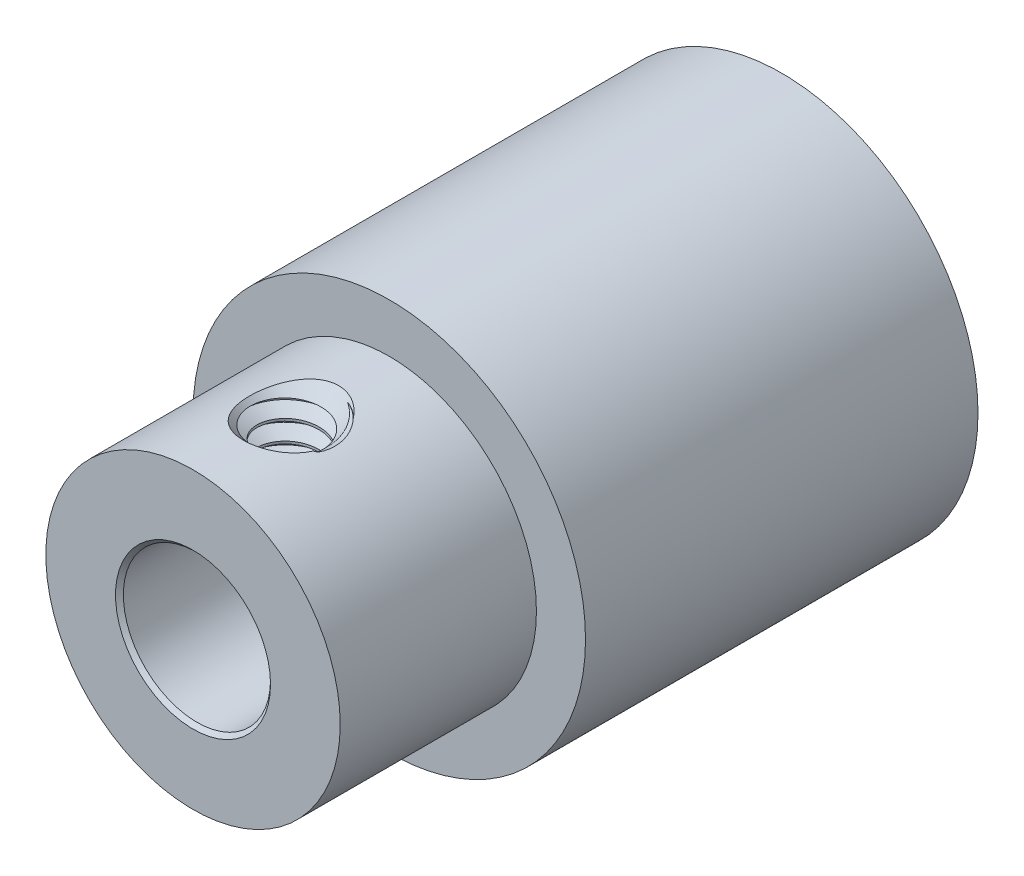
ISO-10303-21;
HEADER;
FILE_DESCRIPTION(('STEP AP214'),'2;1');
FILE_NAME('part.step','',(''),(''),'','','');
FILE_SCHEMA(('AUTOMOTIVE_DESIGN { 1 0 10303 214 1 1 1 1 }'));
ENDSEC;
DATA;
#1=APPLICATION_CONTEXT('core data for automotive mechanical design processes');
#2=APPLICATION_PROTOCOL_DEFINITION('international standard','automotive_design',2000,#1);
#3=PRODUCT_CONTEXT('',#1,'mechanical');
#4=PRODUCT('Part','Part','',(#3));
#5=PRODUCT_RELATED_PRODUCT_CATEGORY('part','',(#4));
#6=PRODUCT_DEFINITION_FORMATION('','',#4);
#7=PRODUCT_DEFINITION_CONTEXT('part definition',#1,'design');
#8=PRODUCT_DEFINITION('design','',#6,#7);
#9=PRODUCT_DEFINITION_SHAPE('','',#8);
#10=(LENGTH_UNIT() NAMED_UNIT(*) SI_UNIT(.MILLI.,.METRE.));
#11=(NAMED_UNIT(*) PLANE_ANGLE_UNIT() SI_UNIT($,.RADIAN.));
#12=(NAMED_UNIT(*) SI_UNIT($,.STERADIAN.) SOLID_ANGLE_UNIT());
#13=UNCERTAINTY_MEASURE_WITH_UNIT(LENGTH_MEASURE(1.E-05),#10,'distance_accuracy_value','');
#14=(GEOMETRIC_REPRESENTATION_CONTEXT(3) GLOBAL_UNCERTAINTY_ASSIGNED_CONTEXT((#13)) GLOBAL_UNIT_ASSIGNED_CONTEXT((#10,
#11,#12)) REPRESENTATION_CONTEXT('',''));
#15=CARTESIAN_POINT('',(0.,0.,0.));
#16=DIRECTION('',(0.,0.,1.));
#17=DIRECTION('',(1.,0.,0.));
#18=AXIS2_PLACEMENT_3D('',#15,#16,#17);
#19=CARTESIAN_POINT('',(0.,0.,6.35));
#20=DIRECTION('',(0.,0.,-1.));
#21=DIRECTION('',(-1.,0.,0.));
#22=AXIS2_PLACEMENT_3D('',#19,#20,#21);
#23=CYLINDRICAL_SURFACE('',#22,4.7625);
#24=CARTESIAN_POINT('',(0.,0.,12.7));
#25=DIRECTION('',(0.,0.,1.));
#26=DIRECTION('',(1.,0.,0.));
#27=AXIS2_PLACEMENT_3D('',#24,#25,#26);
#28=CIRCLE('',#27,4.7625);
#29=CARTESIAN_POINT('',(4.7625,0.,12.7));
#30=VERTEX_POINT('',#29);
#31=EDGE_CURVE('E278',#30,#30,#28,.T.);
#32=ORIENTED_EDGE('',*,*,#31,.F.);
#33=EDGE_LOOP('',(#32));
#34=FACE_BOUND('',#33,.T.);
#35=CARTESIAN_POINT('',(0.,0.,-6.35));
#36=DIRECTION('',(0.,0.,1.));
#37=DIRECTION('',(1.,0.,0.));
#38=AXIS2_PLACEMENT_3D('',#35,#36,#37);
#39=CIRCLE('',#38,4.7625);
#40=CARTESIAN_POINT('',(4.7625,0.,-6.35));
#41=VERTEX_POINT('',#40);
#42=EDGE_CURVE('E280',#41,#41,#39,.T.);
#43=ORIENTED_EDGE('',*,*,#42,.T.);
#44=EDGE_LOOP('',(#43));
#45=FACE_BOUND('',#44,.T.);
#46=CARTESIAN_POINT('',(1.03485273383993,4.648708,10.5008594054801));
#47=CARTESIAN_POINT('',(1.06201992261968,4.64266028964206,10.4720476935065));
#48=CARTESIAN_POINT('',(1.08797484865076,4.63663251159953,10.4421140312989));
#49=CARTESIAN_POINT('',(1.13731925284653,4.62477619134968,10.3801594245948));
#50=CARTESIAN_POINT('',(1.16070842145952,4.6189476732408,10.3481382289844));
#51=CARTESIAN_POINT('',(1.22681593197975,4.60199989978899,10.249174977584));
#52=CARTESIAN_POINT('',(1.2654624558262,4.59142116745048,10.1793458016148));
#53=CARTESIAN_POINT('',(1.33067249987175,4.57295051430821,10.0338267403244));
#54=CARTESIAN_POINT('',(1.35721845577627,4.56506250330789,9.9581285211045));
#55=CARTESIAN_POINT('',(1.39723428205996,4.55297539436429,9.80312190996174));
#56=CARTESIAN_POINT('',(1.41071743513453,4.54877254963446,9.72381727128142));
#57=CARTESIAN_POINT('',(1.42392556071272,4.5446549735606,9.56637389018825));
#58=CARTESIAN_POINT('',(1.42405257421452,4.54461493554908,9.48827194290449));
#59=CARTESIAN_POINT('',(1.41155120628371,4.54851303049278,9.33317119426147));
#60=CARTESIAN_POINT('',(1.39891876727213,4.55245242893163,9.25617275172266));
#61=CARTESIAN_POINT('',(1.36166021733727,4.56373257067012,9.10673768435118));
#62=CARTESIAN_POINT('',(1.33722902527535,4.57101794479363,9.03424781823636));
#63=CARTESIAN_POINT('',(1.27723227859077,4.58814233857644,8.89437841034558));
#64=CARTESIAN_POINT('',(1.24167150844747,4.59798026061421,8.82699668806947));
#65=CARTESIAN_POINT('',(1.17679434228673,4.61488768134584,8.72472732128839));
#66=CARTESIAN_POINT('',(1.15071231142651,4.62148073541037,8.6876641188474));
#67=CARTESIAN_POINT('',(1.09522441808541,4.6349436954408,8.61629600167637));
#68=CARTESIAN_POINT('',(1.06582560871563,4.64181299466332,8.5819854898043));
#69=CARTESIAN_POINT('',(1.03485273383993,4.648708,8.54914059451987));
#70=B_SPLINE_CURVE_WITH_KNOTS('',3,(#46,#47,#48,#49,#50,#51,#52,#53,#54,#55,#56,#57,#58,#59,#60,
#61,#62,#63,#64,#65,#66,#67,#68,#69),.UNSPECIFIED.,.F.,.F.,(4,2,2,2,2,2,2,2,2,2,2,4),(0.,
0.120106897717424,0.240228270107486,0.480522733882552,0.721164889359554,0.961562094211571,
1.19472082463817,1.42795372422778,1.65745891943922,1.88686558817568,2.02407294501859,
2.16099384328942),.UNSPECIFIED.);
#71=CARTESIAN_POINT('',(1.34365679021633,4.56902535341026,9.99169925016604));
#72=VERTEX_POINT('',#71);
#73=CARTESIAN_POINT('',(1.03485273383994,4.648708,8.54914059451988));
#74=VERTEX_POINT('',#73);
#75=EDGE_CURVE('E273',#72,#74,#70,.T.);
#76=ORIENTED_EDGE('',*,*,#75,.F.);
#77=CARTESIAN_POINT('',(0.503265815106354,4.7358346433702,10.4006331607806));
#78=CARTESIAN_POINT('',(0.545613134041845,4.7313387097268,10.3936951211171));
#79=CARTESIAN_POINT('',(0.587603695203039,4.72629799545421,10.3850093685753));
#80=CARTESIAN_POINT('',(0.670576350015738,4.71523832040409,10.3643344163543));
#81=CARTESIAN_POINT('',(0.711559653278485,4.70922060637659,10.3523494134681));
#82=CARTESIAN_POINT('',(0.792320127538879,4.69630811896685,10.3252532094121));
#83=CARTESIAN_POINT('',(0.832097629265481,4.68941358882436,10.3101428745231));
#84=CARTESIAN_POINT('',(0.910276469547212,4.67486734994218,10.2769290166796));
#85=CARTESIAN_POINT('',(0.948676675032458,4.66721503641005,10.258823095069));
#86=CARTESIAN_POINT('',(1.01861498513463,4.6524103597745,10.2224889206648));
#87=CARTESIAN_POINT('',(1.05036233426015,4.64533748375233,10.2046310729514));
#88=CARTESIAN_POINT('',(1.09695481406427,4.63447427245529,10.1762480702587));
#89=CARTESIAN_POINT('',(1.11231849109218,4.63080979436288,10.1665179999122));
#90=CARTESIAN_POINT('',(1.14274945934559,4.62339430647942,10.1466357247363));
#91=CARTESIAN_POINT('',(1.1578167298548,4.61964329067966,10.1364834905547));
#92=CARTESIAN_POINT('',(1.20256660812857,4.60827365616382,10.1053971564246));
#93=CARTESIAN_POINT('',(1.23179043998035,4.6005400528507,10.0838376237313));
#94=CARTESIAN_POINT('',(1.28881979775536,4.58489129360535,10.0390393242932));
#95=CARTESIAN_POINT('',(1.31662669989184,4.57697632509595,10.015802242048));
#96=CARTESIAN_POINT('',(1.34365679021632,4.56902535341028,9.9916992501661));
#97=B_SPLINE_CURVE_WITH_KNOTS('',3,(#77,#78,#79,#80,#81,#82,#83,#84,#85,#86,#87,#88,#89,#90,#91,
#92,#93,#94,#95,#96),.UNSPECIFIED.,.F.,.F.,(4,2,2,2,2,2,2,2,2,4),(0.,0.129382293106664,
0.258600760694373,0.387783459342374,0.517070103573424,0.628296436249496,0.683941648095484,
0.739590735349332,0.850913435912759,0.962125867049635),.UNSPECIFIED.);
#98=CARTESIAN_POINT('',(1.25656407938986,4.59374062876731,10.0643688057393));
#99=VERTEX_POINT('',#98);
#100=EDGE_CURVE('E117',#99,#72,#97,.T.);
#101=ORIENTED_EDGE('',*,*,#100,.F.);
#102=CARTESIAN_POINT('',(-0.992935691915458,4.65784123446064,8.4938035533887));
#103=CARTESIAN_POINT('',(-0.949223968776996,4.66715861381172,8.43877583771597));
#104=CARTESIAN_POINT('',(-0.901662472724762,4.67665678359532,8.38685685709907));
#105=CARTESIAN_POINT('',(-0.799279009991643,4.69523860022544,8.29059384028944));
#106=CARTESIAN_POINT('',(-0.744456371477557,4.70432220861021,8.24625050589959));
#107=CARTESIAN_POINT('',(-0.619966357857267,4.72245047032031,8.16101280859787));
#108=CARTESIAN_POINT('',(-0.549297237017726,4.7313038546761,8.12151810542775));
#109=CARTESIAN_POINT('',(-0.401358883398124,4.74613662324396,8.05692898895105));
#110=CARTESIAN_POINT('',(-0.324095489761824,4.75211851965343,8.03182198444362));
#111=CARTESIAN_POINT('',(-0.176869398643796,4.7597044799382,8.00024738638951));
#112=CARTESIAN_POINT('',(-0.107380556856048,4.7618006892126,7.99167743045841));
#113=CARTESIAN_POINT('',(0.0320127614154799,4.76290112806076,7.98716139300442));
#114=CARTESIAN_POINT('',(0.101916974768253,4.76190714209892,7.99120802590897));
#115=CARTESIAN_POINT('',(0.233890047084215,4.75717319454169,8.01076458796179));
#116=CARTESIAN_POINT('',(0.2961202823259,4.75367351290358,8.02527219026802));
#117=CARTESIAN_POINT('',(0.417361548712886,4.74456678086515,8.06385445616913));
#118=CARTESIAN_POINT('',(0.476372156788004,4.73895945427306,8.08793037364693));
#119=CARTESIAN_POINT('',(0.592494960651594,4.72587837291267,8.14586445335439));
#120=CARTESIAN_POINT('',(0.649402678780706,4.71833206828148,8.18011358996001));
#121=CARTESIAN_POINT('',(0.75741199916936,4.7022038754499,8.25657026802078));
#122=CARTESIAN_POINT('',(0.808511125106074,4.69362154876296,8.29878118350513));
#123=CARTESIAN_POINT('',(0.910480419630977,4.67498205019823,8.39577343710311));
#124=CARTESIAN_POINT('',(0.960466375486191,4.66487768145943,8.45147446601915));
#125=CARTESIAN_POINT('',(1.05168752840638,4.64516322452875,8.56970475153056));
#126=CARTESIAN_POINT('',(1.09291789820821,4.63555341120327,8.63223774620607));
#127=CARTESIAN_POINT('',(1.17122255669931,4.61643668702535,8.77147459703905));
#128=CARTESIAN_POINT('',(1.20697529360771,4.60712040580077,8.84895022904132));
#129=CARTESIAN_POINT('',(1.26628877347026,4.591172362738,9.00869672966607));
#130=CARTESIAN_POINT('',(1.2898452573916,4.58454153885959,9.09096926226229));
#131=CARTESIAN_POINT('',(1.32578237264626,4.5742859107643,9.26468689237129));
#132=CARTESIAN_POINT('',(1.33717640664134,4.57092818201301,9.35635363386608));
#133=CARTESIAN_POINT('',(1.34530400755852,4.56854247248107,9.5403924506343));
#134=CARTESIAN_POINT('',(1.34203574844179,4.56951503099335,9.63276461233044));
#135=CARTESIAN_POINT('',(1.32071138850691,4.57572431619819,9.81723611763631));
#136=CARTESIAN_POINT('',(1.30240591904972,4.58103294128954,9.90930437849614));
#137=CARTESIAN_POINT('',(1.25096890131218,4.59534445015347,10.0889324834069));
#138=CARTESIAN_POINT('',(1.21783405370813,4.60434815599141,10.1764913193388));
#139=CARTESIAN_POINT('',(1.13747355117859,4.62485285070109,10.3438660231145));
#140=CARTESIAN_POINT('',(1.09034348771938,4.63633675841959,10.4237297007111));
#141=CARTESIAN_POINT('',(0.982518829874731,4.66037593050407,10.573608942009));
#142=CARTESIAN_POINT('',(0.921825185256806,4.67293111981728,10.6436251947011));
#143=CARTESIAN_POINT('',(0.792037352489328,4.69661096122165,10.7667062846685));
#144=CARTESIAN_POINT('',(0.723696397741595,4.70777605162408,10.8205524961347));
#145=CARTESIAN_POINT('',(0.577495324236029,4.72792875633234,10.9137945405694));
#146=CARTESIAN_POINT('',(0.499650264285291,4.73691974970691,10.9532128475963));
#147=CARTESIAN_POINT('',(0.348872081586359,4.7502175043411,11.0102875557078));
#148=CARTESIAN_POINT('',(0.276863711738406,4.75501447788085,11.0302708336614));
#149=CARTESIAN_POINT('',(0.130239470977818,4.7612816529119,11.0562408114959));
#150=CARTESIAN_POINT('',(0.0556262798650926,4.76275517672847,11.0622414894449));
#151=CARTESIAN_POINT('',(-0.0837926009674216,4.76220765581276,11.0599905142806));
#152=CARTESIAN_POINT('',(-0.148634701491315,4.76060859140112,11.0534600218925));
#153=CARTESIAN_POINT('',(-0.276237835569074,4.75491074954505,11.0298319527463));
#154=CARTESIAN_POINT('',(-0.338998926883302,4.75081204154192,11.0127346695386));
#155=CARTESIAN_POINT('',(-0.460576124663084,4.74056850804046,10.9689491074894));
#156=CARTESIAN_POINT('',(-0.519407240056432,4.73443207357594,10.9423001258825));
#157=CARTESIAN_POINT('',(-0.632248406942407,4.72068898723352,10.8805550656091));
#158=CARTESIAN_POINT('',(-0.686256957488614,4.71308187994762,10.8454563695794));
#159=CARTESIAN_POINT('',(-0.794076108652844,4.69618321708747,10.7639250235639));
#160=CARTESIAN_POINT('',(-0.847260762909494,4.68679859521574,10.7166859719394));
#161=CARTESIAN_POINT('',(-0.94608312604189,4.66785493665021,10.6149230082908));
#162=CARTESIAN_POINT('',(-0.991716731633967,4.65829580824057,10.5603951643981));
#163=CARTESIAN_POINT('',(-1.08094412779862,4.63846385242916,10.4372520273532));
#164=CARTESIAN_POINT('',(-1.12331837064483,4.62828373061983,10.3677367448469));
#165=CARTESIAN_POINT('',(-1.19719393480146,4.6097272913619,10.2229280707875));
#166=CARTESIAN_POINT('',(-1.22869020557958,4.60135181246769,10.1476320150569));
#167=CARTESIAN_POINT('',(-1.28314799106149,4.58648271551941,9.9850304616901));
#168=CARTESIAN_POINT('',(-1.30489044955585,4.58027318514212,9.8972881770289));
#169=CARTESIAN_POINT('',(-1.33439850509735,4.57176368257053,9.71930412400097));
#170=CARTESIAN_POINT('',(-1.34216237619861,4.56946419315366,9.62906204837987));
#171=CARTESIAN_POINT('',(-1.34361503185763,4.56903814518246,9.44532246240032));
#172=CARTESIAN_POINT('',(-1.33680825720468,4.57105850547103,9.35182019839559));
#173=CARTESIAN_POINT('',(-1.30820606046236,4.57932532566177,9.16728382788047));
#174=CARTESIAN_POINT('',(-1.28640362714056,4.58557376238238,9.07625089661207));
#175=CARTESIAN_POINT('',(-1.22781951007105,4.60160790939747,8.89832704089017));
#176=CARTESIAN_POINT('',(-1.19087399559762,4.61143217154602,8.81149341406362));
#177=CARTESIAN_POINT('',(-1.10252920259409,4.63334618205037,8.64587593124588));
#178=CARTESIAN_POINT('',(-1.05114602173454,4.64543340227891,8.56708324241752));
#179=CARTESIAN_POINT('',(-0.992935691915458,4.65784123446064,8.4938035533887));
#180=B_SPLINE_CURVE_WITH_KNOTS('',3,(#102,#103,#104,#105,#106,#107,#108,#109,#110,#111,#112,
#113,#114,#115,#116,#117,#118,#119,#120,#121,#122,#123,#124,#125,#126,#127,#128,#129,#130,#131,
#132,#133,#134,#135,#136,#137,#138,#139,#140,#141,#142,#143,#144,#145,#146,#147,#148,#149,#150,
#151,#152,#153,#154,#155,#156,#157,#158,#159,#160,#161,#162,#163,#164,#165,#166,#167,#168,#169,
#170,#171,#172,#173,#174,#175,#176,#177,#178,#179),.UNSPECIFIED.,.T.,.F.,(4,2,2,2,2,2,2,2,2,2,2,
2,2,2,2,2,2,2,2,2,2,2,2,2,2,2,2,2,2,2,2,2,2,2,2,2,2,2,4),(0.,0.212447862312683,
0.424915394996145,0.667761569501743,0.910394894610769,1.11937338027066,1.32823121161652,
1.51935830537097,1.71051045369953,1.91025258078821,2.11007954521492,2.33574871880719,
2.56154199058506,2.81795090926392,3.07444930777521,3.3504619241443,3.62650891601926,
3.90722839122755,4.18801035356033,4.4669169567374,4.74580403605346,5.00741599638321,
5.26861869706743,5.49194269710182,5.71504334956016,5.9096717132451,6.10429467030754,
6.2981259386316,6.49201732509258,6.70642994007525,6.92095868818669,7.1660895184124,
7.41133400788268,7.68193381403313,7.95256702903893,8.23255057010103,8.51266510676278,
8.79589369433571,9.07880773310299),.UNSPECIFIED.);
#181=EDGE_CURVE('E67',#99,#74,#180,.T.);
#182=ORIENTED_EDGE('',*,*,#181,.T.);
#183=EDGE_LOOP('',(#76,#101,#182));
#184=FACE_BOUND('',#183,.T.);
#185=ADVANCED_FACE('F44',(#34,#45,#184),#23,.T.);
#186=CARTESIAN_POINT('',(0.,0.,6.35));
#187=DIRECTION('',(0.,0.,-1.));
#188=DIRECTION('',(-1.,0.,0.));
#189=AXIS2_PLACEMENT_3D('',#186,#187,#188);
#190=CYLINDRICAL_SURFACE('',#189,2.38125);
#191=CARTESIAN_POINT('',(0.,0.,-6.223));
#192=DIRECTION('',(0.,0.,1.));
#193=DIRECTION('',(1.,0.,0.));
#194=AXIS2_PLACEMENT_3D('',#191,#192,#193);
#195=CIRCLE('',#194,2.38125);
#196=CARTESIAN_POINT('',(2.38125,0.,-6.223));
#197=VERTEX_POINT('',#196);
#198=EDGE_CURVE('E52',#197,#197,#195,.F.);
#199=ORIENTED_EDGE('',*,*,#198,.T.);
#200=EDGE_LOOP('',(#199));
#201=FACE_BOUND('',#200,.T.);
#202=CARTESIAN_POINT('',(0.,0.,12.573));
#203=DIRECTION('',(0.,0.,1.));
#204=DIRECTION('',(1.,0.,0.));
#205=AXIS2_PLACEMENT_3D('',#202,#203,#204);
#206=CIRCLE('',#205,2.38125);
#207=CARTESIAN_POINT('',(2.38125,0.,12.573));
#208=VERTEX_POINT('',#207);
#209=EDGE_CURVE('E404',#208,#208,#206,.T.);
#210=ORIENTED_EDGE('',*,*,#209,.T.);
#211=EDGE_LOOP('',(#210));
#212=FACE_BOUND('',#211,.T.);
#213=CARTESIAN_POINT('',(1.36138445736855,1.95371029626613,9.93713361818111));
#214=CARTESIAN_POINT('',(1.36679066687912,1.94991394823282,9.86800214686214));
#215=CARTESIAN_POINT('',(1.3697723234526,1.94783088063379,9.79858710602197));
#216=CARTESIAN_POINT('',(1.37088339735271,1.94706481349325,9.65970134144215));
#217=CARTESIAN_POINT('',(1.36901296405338,1.94838170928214,9.5902306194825));
#218=CARTESIAN_POINT('',(1.36049389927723,1.95433514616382,9.45297863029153));
#219=CARTESIAN_POINT('',(1.35393129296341,1.95891191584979,9.38518936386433));
#220=CARTESIAN_POINT('',(1.33618518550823,1.97106004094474,9.25051778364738));
#221=CARTESIAN_POINT('',(1.32500347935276,1.97863023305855,9.18363512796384));
#222=CARTESIAN_POINT('',(1.30120184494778,1.99433665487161,9.06646101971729));
#223=CARTESIAN_POINT('',(1.2895106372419,2.00193828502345,9.01590554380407));
#224=CARTESIAN_POINT('',(1.26336217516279,2.01854011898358,8.91535792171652));
#225=CARTESIAN_POINT('',(1.24888602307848,2.02754979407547,8.86537224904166));
#226=CARTESIAN_POINT('',(1.23306104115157,2.03713328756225,8.81592861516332));
#227=B_SPLINE_CURVE_WITH_KNOTS('',3,(#213,#214,#215,#216,#217,#218,#219,#220,#221,#222,#223,
#224,#225,#226),.UNSPECIFIED.,.F.,.F.,(4,2,2,2,2,2,4),(0.,0.20827682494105,0.416547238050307,
0.621094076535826,0.825561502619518,0.982802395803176,1.14115051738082),.UNSPECIFIED.);
#228=CARTESIAN_POINT('',(1.36138445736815,1.95371029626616,9.93713361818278));
#229=VERTEX_POINT('',#228);
#230=CARTESIAN_POINT('',(1.23306104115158,2.03713328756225,8.81592861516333));
#231=VERTEX_POINT('',#230);
#232=EDGE_CURVE('E250',#229,#231,#227,.T.);
#233=ORIENTED_EDGE('',*,*,#232,.T.);
#234=CARTESIAN_POINT('',(0.,2.38125,8.1026));
#235=CARTESIAN_POINT('',(-0.0728120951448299,2.38124662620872,8.10260369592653));
#236=CARTESIAN_POINT('',(-0.145743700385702,2.37787389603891,8.10823008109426));
#237=CARTESIAN_POINT('',(-0.289417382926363,2.36470358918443,8.13044959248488));
#238=CARTESIAN_POINT('',(-0.360153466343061,2.35488981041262,8.14707037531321));
#239=CARTESIAN_POINT('',(-0.497046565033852,2.32983157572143,8.19034869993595));
#240=CARTESIAN_POINT('',(-0.563224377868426,2.31461404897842,8.2169565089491));
#241=CARTESIAN_POINT('',(-0.689969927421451,2.28004701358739,8.27914625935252));
#242=CARTESIAN_POINT('',(-0.750539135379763,2.26069859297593,8.3147258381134));
#243=CARTESIAN_POINT('',(-0.86956650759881,2.21777048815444,8.3968616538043));
#244=CARTESIAN_POINT('',(-0.927513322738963,2.19398086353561,8.44404713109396));
#245=CARTESIAN_POINT('',(-1.03516996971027,2.14529103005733,8.54664197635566));
#246=CARTESIAN_POINT('',(-1.08486912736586,2.12038943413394,8.60206182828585));
#247=CARTESIAN_POINT('',(-1.18073145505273,2.06870328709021,8.72746637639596));
#248=CARTESIAN_POINT('',(-1.22573474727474,2.04205664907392,8.79840233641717));
#249=CARTESIAN_POINT('',(-1.30301047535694,1.99364079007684,8.94839594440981));
#250=CARTESIAN_POINT('',(-1.3353034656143,1.97186371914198,9.02744021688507));
#251=CARTESIAN_POINT('',(-1.37947108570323,1.94112197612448,9.17208387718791));
#252=CARTESIAN_POINT('',(-1.39438400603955,1.93033766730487,9.23636720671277));
#253=CARTESIAN_POINT('',(-1.41515094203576,1.91516875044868,9.36709002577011));
#254=CARTESIAN_POINT('',(-1.42101606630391,1.91077629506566,9.43352676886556));
#255=CARTESIAN_POINT('',(-1.42334999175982,1.90903888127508,9.56678636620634));
#256=CARTESIAN_POINT('',(-1.41980094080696,1.91170731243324,9.63360971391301));
#257=CARTESIAN_POINT('',(-1.4034935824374,1.92370847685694,9.76552505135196));
#258=CARTESIAN_POINT('',(-1.39072840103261,1.9330461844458,9.83061571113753));
#259=CARTESIAN_POINT('',(-1.35687046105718,1.95695471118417,9.95666850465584));
#260=CARTESIAN_POINT('',(-1.33587925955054,1.97146152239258,10.0176707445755));
#261=CARTESIAN_POINT('',(-1.28633543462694,2.0041386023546,10.1354507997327));
#262=CARTESIAN_POINT('',(-1.25778002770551,2.02231021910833,10.1922270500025));
#263=CARTESIAN_POINT('',(-1.18820739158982,2.06408091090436,10.3104093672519));
#264=CARTESIAN_POINT('',(-1.14588761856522,2.08807464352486,10.3709096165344));
#265=CARTESIAN_POINT('',(-1.05254786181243,2.13664874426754,10.4845732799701));
#266=CARTESIAN_POINT('',(-1.00151963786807,2.1612296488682,10.5377296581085));
#267=CARTESIAN_POINT('',(-0.883904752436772,2.21217256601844,10.6425666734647));
#268=CARTESIAN_POINT('',(-0.816144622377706,2.23831813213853,10.6930503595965));
#269=CARTESIAN_POINT('',(-0.671516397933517,2.28586919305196,10.7817695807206));
#270=CARTESIAN_POINT('',(-0.594653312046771,2.30727727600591,10.820011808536));
#271=CARTESIAN_POINT('',(-0.438921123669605,2.34171812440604,10.8803922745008));
#272=CARTESIAN_POINT('',(-0.360492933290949,2.35519812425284,10.9034023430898));
#273=CARTESIAN_POINT('',(-0.199949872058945,2.37421094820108,10.9356460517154));
#274=CARTESIAN_POINT('',(-0.117839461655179,2.3797531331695,10.9448959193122));
#275=CARTESIAN_POINT('',(0.0357466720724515,2.38205159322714,10.9487402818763));
#276=CARTESIAN_POINT('',(0.107168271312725,2.3798887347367,10.9451376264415));
#277=CARTESIAN_POINT('',(0.248206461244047,2.3693338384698,10.9273782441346));
#278=CARTESIAN_POINT('',(0.317823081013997,2.36094190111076,10.9132216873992));
#279=CARTESIAN_POINT('',(0.45179203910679,2.33896244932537,10.875497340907));
#280=CARTESIAN_POINT('',(0.516228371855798,2.32549818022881,10.8521522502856));
#281=CARTESIAN_POINT('',(0.640261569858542,2.29445174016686,10.796966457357));
#282=CARTESIAN_POINT('',(0.699857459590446,2.27686874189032,10.7651240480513));
#283=CARTESIAN_POINT('',(0.819212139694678,2.23687386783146,10.6901541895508));
#284=CARTESIAN_POINT('',(0.878344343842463,2.21415006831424,10.6461979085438));
#285=CARTESIAN_POINT('',(0.988842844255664,2.16706189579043,10.5500777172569));
#286=CARTESIAN_POINT('',(1.04019995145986,2.14269563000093,10.4979042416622));
#287=CARTESIAN_POINT('',(1.1404834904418,2.09122349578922,10.3790045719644));
#288=CARTESIAN_POINT('',(1.18824759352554,2.06416837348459,10.3112697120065));
#289=CARTESIAN_POINT('',(1.27173810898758,2.01380619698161,10.1674910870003));
#290=CARTESIAN_POINT('',(1.3074775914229,1.99049508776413,10.0914564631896));
#291=CARTESIAN_POINT('',(1.35911443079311,1.95548357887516,9.94975920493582));
#292=CARTESIAN_POINT('',(1.37763058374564,1.94236274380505,9.88540552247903));
#293=CARTESIAN_POINT('',(1.40547559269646,1.92231398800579,9.75383728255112));
#294=CARTESIAN_POINT('',(1.41481698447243,1.91537761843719,9.68662675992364));
#295=CARTESIAN_POINT('',(1.42379250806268,1.90871736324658,9.55094517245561));
#296=CARTESIAN_POINT('',(1.42339192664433,1.90901926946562,9.48247046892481));
#297=CARTESIAN_POINT('',(1.41282296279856,1.91685204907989,9.34668536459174));
#298=CARTESIAN_POINT('',(1.40264913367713,1.92438695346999,9.27937563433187));
#299=CARTESIAN_POINT('',(1.37381168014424,1.94506689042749,9.15081721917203));
#300=CARTESIAN_POINT('',(1.35555088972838,1.95794408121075,9.08943208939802));
#301=CARTESIAN_POINT('',(1.31141767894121,1.98777320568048,8.97053473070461));
#302=CARTESIAN_POINT('',(1.2855423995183,2.00472666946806,8.91302396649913));
#303=CARTESIAN_POINT('',(1.22233678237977,2.04397379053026,8.79402325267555));
#304=CARTESIAN_POINT('',(1.1838560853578,2.06668776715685,8.73328419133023));
#305=CARTESIAN_POINT('',(1.09847451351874,2.11330903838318,8.61852439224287));
#306=CARTESIAN_POINT('',(1.05156673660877,2.13721729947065,8.56450922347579));
#307=CARTESIAN_POINT('',(0.94185700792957,2.18802794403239,8.4558903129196));
#308=CARTESIAN_POINT('',(0.877713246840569,2.21479948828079,8.40256746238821));
#309=CARTESIAN_POINT('',(0.740010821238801,2.26452803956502,8.30737786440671));
#310=CARTESIAN_POINT('',(0.66644900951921,2.2874837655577,8.26551496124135));
#311=CARTESIAN_POINT('',(0.514196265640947,2.32635304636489,8.19624782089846));
#312=CARTESIAN_POINT('',(0.435760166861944,2.34247699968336,8.16840567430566));
#313=CARTESIAN_POINT('',(0.274221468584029,2.36680454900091,8.12681421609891));
#314=CARTESIAN_POINT('',(0.191137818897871,2.37503813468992,8.11301153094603));
#315=CARTESIAN_POINT('',(0.0895986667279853,2.37963218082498,8.1053103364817));
#316=CARTESIAN_POINT('',(0.0717017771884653,2.38023779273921,8.10429514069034));
#317=CARTESIAN_POINT('',(0.0358723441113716,2.3810471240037,8.1029395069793));
#318=CARTESIAN_POINT('',(0.0179397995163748,2.38125083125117,8.10259908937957));
#319=CARTESIAN_POINT('',(0.,2.38125,8.1026));
#320=B_SPLINE_CURVE_WITH_KNOTS('',3,(#234,#235,#236,#237,#238,#239,#240,#241,#242,#243,#244,
#245,#246,#247,#248,#249,#250,#251,#252,#253,#254,#255,#256,#257,#258,#259,#260,#261,#262,#263,
#264,#265,#266,#267,#268,#269,#270,#271,#272,#273,#274,#275,#276,#277,#278,#279,#280,#281,#282,
#283,#284,#285,#286,#287,#288,#289,#290,#291,#292,#293,#294,#295,#296,#297,#298,#299,#300,#301,
#302,#303,#304,#305,#306,#307,#308,#309,#310,#311,#312,#313,#314,#315,#316,#317,#318,#319),
.UNSPECIFIED.,.T.,.F.,(4,2,2,2,2,2,2,2,2,2,2,2,2,2,2,2,2,2,2,2,2,2,2,2,2,2,2,2,2,2,2,2,2,2,2,2,
2,2,2,2,2,2,4),(0.,0.218359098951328,0.437269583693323,0.655104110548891,0.872881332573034,
1.10723004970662,1.34187973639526,1.60498798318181,1.86766898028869,2.06741519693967,
2.26691597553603,2.46679533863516,2.66682393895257,2.86445710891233,3.06216310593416,
3.29417106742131,3.52639979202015,3.79040158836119,4.05425879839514,4.30128054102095,
4.54801073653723,4.76157530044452,4.9751364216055,5.183812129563,5.39252978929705,
5.62293597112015,5.85361236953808,6.11395968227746,6.37402309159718,6.57789163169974,
6.78148123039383,6.98579637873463,7.19022545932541,7.38545107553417,7.58075008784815,
7.80612170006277,8.03167874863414,8.29322040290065,8.55484968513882,8.80770260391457,
9.05959062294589,9.11338938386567,9.16718976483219),.UNSPECIFIED.);
#321=CARTESIAN_POINT('',(1.04904357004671,2.13772288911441,8.56441197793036));
#322=VERTEX_POINT('',#321);
#323=EDGE_CURVE('E256',#231,#322,#320,.T.);
#324=ORIENTED_EDGE('',*,*,#323,.T.);
#325=CARTESIAN_POINT('',(1.04904357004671,2.13772288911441,8.56441197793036));
#326=CARTESIAN_POINT('',(1.03029376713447,2.14692544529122,8.56536021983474));
#327=CARTESIAN_POINT('',(1.01140380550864,2.15588780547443,8.56557235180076));
#328=CARTESIAN_POINT('',(0.973498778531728,2.17326546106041,8.56472631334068));
#329=CARTESIAN_POINT('',(0.954484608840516,2.18168295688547,8.56367363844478));
#330=CARTESIAN_POINT('',(0.916345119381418,2.1979748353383,8.56050649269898));
#331=CARTESIAN_POINT('',(0.89721995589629,2.2058498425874,8.55839326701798));
#332=CARTESIAN_POINT('',(0.820453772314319,2.23630176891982,8.54824735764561));
#333=CARTESIAN_POINT('',(0.762408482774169,2.256726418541,8.53683712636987));
#334=CARTESIAN_POINT('',(0.66091868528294,2.28813867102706,8.51447075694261));
#335=CARTESIAN_POINT('',(0.617625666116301,2.30019735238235,8.50417624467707));
#336=CARTESIAN_POINT('',(0.530496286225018,2.32183923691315,8.48324142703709));
#337=CARTESIAN_POINT('',(0.486659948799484,2.33142254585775,8.47260113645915));
#338=CARTESIAN_POINT('',(0.398394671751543,2.34811638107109,8.45186632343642));
#339=CARTESIAN_POINT('',(0.353965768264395,2.35522705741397,8.44177176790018));
#340=CARTESIAN_POINT('',(0.264565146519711,2.36693619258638,8.42271879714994));
#341=CARTESIAN_POINT('',(0.21959382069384,2.37153636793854,8.41375960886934));
#342=CARTESIAN_POINT('',(0.129192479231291,2.37817460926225,8.39727470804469));
#343=CARTESIAN_POINT('',(0.0837624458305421,2.38021257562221,8.389749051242));
#344=CARTESIAN_POINT('',(0.015425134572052,2.3813089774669,8.37967091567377));
#345=CARTESIAN_POINT('',(-0.00738293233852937,2.38134781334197,8.37651360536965));
#346=CARTESIAN_POINT('',(-0.0530116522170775,2.38076923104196,8.3703550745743));
#347=CARTESIAN_POINT('',(-0.0758323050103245,2.38015182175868,8.36735385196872));
#348=CARTESIAN_POINT('',(-0.124074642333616,2.37815147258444,8.36117747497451));
#349=CARTESIAN_POINT('',(-0.149495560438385,2.37668911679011,8.35802163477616));
#350=CARTESIAN_POINT('',(-0.200289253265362,2.37294843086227,8.35187289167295));
#351=CARTESIAN_POINT('',(-0.22566203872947,2.37067031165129,8.34887994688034));
#352=CARTESIAN_POINT('',(-0.301659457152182,2.36261460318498,8.34007421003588));
#353=CARTESIAN_POINT('',(-0.352179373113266,2.35561499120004,8.33443250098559));
#354=CARTESIAN_POINT('',(-0.453474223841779,2.3382458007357,8.32290251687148));
#355=CARTESIAN_POINT('',(-0.504239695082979,2.32782270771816,8.3170117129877));
#356=CARTESIAN_POINT('',(-0.604884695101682,2.30372663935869,8.30410904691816));
#357=CARTESIAN_POINT('',(-0.654763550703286,2.29005129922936,8.29709637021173));
#358=CARTESIAN_POINT('',(-0.704013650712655,2.27480028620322,8.28904428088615));
#359=B_SPLINE_CURVE_WITH_KNOTS('',3,(#325,#326,#327,#328,#329,#330,#331,#332,#333,#334,#335,
#336,#337,#338,#339,#340,#341,#342,#343,#344,#345,#346,#347,#348,#349,#350,#351,#352,#353,#354,
#355,#356,#357,#358),.UNSPECIFIED.,.F.,.F.,(4,2,2,2,2,2,2,2,2,2,2,2,2,2,2,2,4),(0.,
0.0626898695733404,0.125108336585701,0.187453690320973,0.374697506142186,0.51297319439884,
0.651242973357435,0.78950435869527,0.927671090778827,1.06584319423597,1.13491067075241,
1.2039772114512,1.28093605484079,1.35787501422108,1.51170394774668,1.66806202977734,
1.82453415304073),.UNSPECIFIED.);
#360=CARTESIAN_POINT('',(-0.704013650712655,2.27480028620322,8.28904428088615));
#361=VERTEX_POINT('',#360);
#362=EDGE_CURVE('E245',#322,#361,#359,.T.);
#363=ORIENTED_EDGE('',*,*,#362,.T.);
#364=CARTESIAN_POINT('',(-0.883062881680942,2.21145913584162,8.40991179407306));
#365=VERTEX_POINT('',#364);
#366=EDGE_CURVE('E251',#361,#365,#320,.T.);
#367=ORIENTED_EDGE('',*,*,#366,.T.);
#368=CARTESIAN_POINT('',(-0.883062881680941,2.21145913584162,8.40991179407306));
#369=CARTESIAN_POINT('',(-0.90856773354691,2.20126136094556,8.46106197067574));
#370=CARTESIAN_POINT('',(-0.931868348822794,2.19145818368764,8.5133866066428));
#371=CARTESIAN_POINT('',(-0.974241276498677,2.17296073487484,8.62018474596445));
#372=CARTESIAN_POINT('',(-0.993294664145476,2.16427149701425,8.67466664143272));
#373=CARTESIAN_POINT('',(-1.01842770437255,2.15249542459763,8.75671087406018));
#374=CARTESIAN_POINT('',(-1.02613890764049,2.14882618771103,8.78370224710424));
#375=CARTESIAN_POINT('',(-1.04056478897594,2.14187795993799,8.83799870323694));
#376=CARTESIAN_POINT('',(-1.04727955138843,2.13859893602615,8.86530375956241));
#377=CARTESIAN_POINT('',(-1.05969507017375,2.1324740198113,8.92019386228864));
#378=CARTESIAN_POINT('',(-1.06539581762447,2.12962813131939,8.94777891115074));
#379=CARTESIAN_POINT('',(-1.0756314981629,2.12447674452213,9.0032212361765));
#380=CARTESIAN_POINT('',(-1.0801661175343,2.12217139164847,9.03107858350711));
#381=CARTESIAN_POINT('',(-1.09203812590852,2.11610146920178,9.1148958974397));
#382=CARTESIAN_POINT('',(-1.09765991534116,2.11317486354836,9.17117268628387));
#383=CARTESIAN_POINT('',(-1.10422470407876,2.10975189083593,9.28406752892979));
#384=CARTESIAN_POINT('',(-1.10516766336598,2.10925554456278,9.34068558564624));
#385=CARTESIAN_POINT('',(-1.10241299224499,2.11069634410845,9.45120545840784));
#386=CARTESIAN_POINT('',(-1.0989240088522,2.11252408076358,9.50511394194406));
#387=CARTESIAN_POINT('',(-1.08766970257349,2.11834039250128,9.61236554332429));
#388=CARTESIAN_POINT('',(-1.07990423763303,2.12232903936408,9.66570864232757));
#389=CARTESIAN_POINT('',(-1.06013838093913,2.13227127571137,9.77147248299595));
#390=CARTESIAN_POINT('',(-1.04813373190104,2.13822684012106,9.8238922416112));
#391=CARTESIAN_POINT('',(-1.01993016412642,2.15182187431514,9.92736083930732));
#392=CARTESIAN_POINT('',(-1.00373160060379,2.15946120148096,9.97840979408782));
#393=CARTESIAN_POINT('',(-0.971611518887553,2.17406475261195,10.0667112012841));
#394=CARTESIAN_POINT('',(-0.956561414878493,2.18074903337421,10.1043274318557));
#395=CARTESIAN_POINT('',(-0.923631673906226,2.19489722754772,10.1781483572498));
#396=CARTESIAN_POINT('',(-0.90575281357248,2.20236092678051,10.2143534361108));
#397=CARTESIAN_POINT('',(-0.867221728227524,2.21781639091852,10.2850439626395));
#398=CARTESIAN_POINT('',(-0.846575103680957,2.22580707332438,10.3195326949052));
#399=CARTESIAN_POINT('',(-0.802413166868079,2.24210563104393,10.3865367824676));
#400=CARTESIAN_POINT('',(-0.778898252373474,2.25041346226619,10.4190524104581));
#401=CARTESIAN_POINT('',(-0.718446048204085,2.27059197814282,10.4948545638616));
#402=CARTESIAN_POINT('',(-0.68000836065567,2.28249952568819,10.5369580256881));
#403=CARTESIAN_POINT('',(-0.596961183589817,2.30561065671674,10.6148195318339));
#404=CARTESIAN_POINT('',(-0.552359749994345,2.31681513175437,10.6505857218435));
#405=CARTESIAN_POINT('',(-0.468570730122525,2.33498540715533,10.7058957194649));
#406=CARTESIAN_POINT('',(-0.430682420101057,2.3423209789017,10.7272709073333));
#407=CARTESIAN_POINT('',(-0.351751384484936,2.35546611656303,10.7638081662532));
#408=CARTESIAN_POINT('',(-0.310710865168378,2.36127673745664,10.7789745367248));
#409=CARTESIAN_POINT('',(-0.225874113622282,2.37089852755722,10.801918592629));
#410=CARTESIAN_POINT('',(-0.182055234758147,2.37468999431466,10.8096240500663));
#411=CARTESIAN_POINT('',(-0.115793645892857,2.37853721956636,10.8147741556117));
#412=CARTESIAN_POINT('',(-0.0936141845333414,2.37951297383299,10.8154224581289));
#413=CARTESIAN_POINT('',(-0.049272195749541,2.38084307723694,10.8145848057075));
#414=CARTESIAN_POINT('',(-0.0271096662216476,2.38119752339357,10.8130991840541));
#415=CARTESIAN_POINT('',(0.0138553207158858,2.38128502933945,10.8083162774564));
#416=CARTESIAN_POINT('',(0.0326911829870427,2.3810986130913,10.8053037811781));
#417=CARTESIAN_POINT('',(0.070009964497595,2.3802939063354,10.7976396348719));
#418=CARTESIAN_POINT('',(0.0884929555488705,2.37967570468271,10.7929883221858));
#419=CARTESIAN_POINT('',(0.143206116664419,2.37721927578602,10.7767407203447));
#420=CARTESIAN_POINT('',(0.178744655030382,2.37477919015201,10.7628453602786));
#421=CARTESIAN_POINT('',(0.254237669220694,2.36800324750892,10.7264108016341));
#422=CARTESIAN_POINT('',(0.293580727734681,2.36337928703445,10.7026769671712));
#423=CARTESIAN_POINT('',(0.367947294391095,2.35295265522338,10.6491962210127));
#424=CARTESIAN_POINT('',(0.402949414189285,2.34714449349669,10.6194213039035));
#425=CARTESIAN_POINT('',(0.477860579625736,2.33320538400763,10.5459894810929));
#426=CARTESIAN_POINT('',(0.516244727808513,2.32488958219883,10.5008118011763));
#427=CARTESIAN_POINT('',(0.567962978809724,2.31259104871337,10.4293554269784));
#428=CARTESIAN_POINT('',(0.584151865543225,2.30854280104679,10.4050669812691));
#429=CARTESIAN_POINT('',(0.61471179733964,2.30059292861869,10.3553982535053));
#430=CARTESIAN_POINT('',(0.629085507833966,2.29669109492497,10.3300196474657));
#431=CARTESIAN_POINT('',(0.642590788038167,2.29290833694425,10.3041578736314));
#432=B_SPLINE_CURVE_WITH_KNOTS('',3,(#368,#369,#370,#371,#372,#373,#374,#375,#376,#377,#378,
#379,#380,#381,#382,#383,#384,#385,#386,#387,#388,#389,#390,#391,#392,#393,#394,#395,#396,#397,
#398,#399,#400,#401,#402,#403,#404,#405,#406,#407,#408,#409,#410,#411,#412,#413,#414,#415,#416,
#417,#418,#419,#420,#421,#422,#423,#424,#425,#426,#427,#428,#429,#430,#431),.UNSPECIFIED.,.F.,
.F.,(4,2,2,2,2,2,2,2,2,2,2,2,2,2,2,2,2,2,2,2,2,2,2,2,2,2,2,2,2,2,2,4),(0.,0.174125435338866,
0.349011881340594,0.433924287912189,0.518829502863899,0.603735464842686,0.688664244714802,
0.858301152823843,1.02793951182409,1.18987972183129,1.35182531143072,1.51393400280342,
1.67602896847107,1.79911605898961,1.92216941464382,2.04497743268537,2.16776843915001,
2.34191628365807,2.51583863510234,2.64769986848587,2.77946963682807,2.91250266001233,
2.9790392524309,3.04556545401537,3.10271717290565,3.15985713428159,3.27400541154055,
3.4118125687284,3.55027380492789,3.72892680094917,3.81727456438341,3.90549104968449),.UNSPECIFIED.);
#433=CARTESIAN_POINT('',(0.642590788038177,2.29290833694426,10.3041578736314));
#434=VERTEX_POINT('',#433);
#435=EDGE_CURVE('E212',#365,#434,#432,.T.);
#436=ORIENTED_EDGE('',*,*,#435,.T.);
#437=CARTESIAN_POINT('',(0.642590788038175,2.29290833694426,10.3041578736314));
#438=CARTESIAN_POINT('',(0.662561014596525,2.28731284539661,10.287689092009));
#439=CARTESIAN_POINT('',(0.681880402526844,2.28161615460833,10.2704651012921));
#440=CARTESIAN_POINT('',(0.720844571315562,2.26962233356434,10.2329473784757));
#441=CARTESIAN_POINT('',(0.740355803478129,2.26331817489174,10.2125170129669));
#442=CARTESIAN_POINT('',(0.777737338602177,2.25074867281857,10.1699367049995));
#443=CARTESIAN_POINT('',(0.795595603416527,2.24448388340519,10.1477760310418));
#444=CARTESIAN_POINT('',(0.812500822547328,2.23834625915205,10.1248769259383));
#445=B_SPLINE_CURVE_WITH_KNOTS('',3,(#437,#438,#439,#440,#441,#442,#443,#444),.UNSPECIFIED.,.F.,
.F.,(4,2,2,4),(0.,0.0794313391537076,0.166169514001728,0.253496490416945),.UNSPECIFIED.);
#446=CARTESIAN_POINT('',(0.812500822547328,2.23834625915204,10.1248769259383));
#447=VERTEX_POINT('',#446);
#448=EDGE_CURVE('E237',#434,#447,#445,.T.);
#449=ORIENTED_EDGE('',*,*,#448,.T.);
#450=CARTESIAN_POINT('',(0.812500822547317,2.23834625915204,10.1248769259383));
#451=CARTESIAN_POINT('',(0.845717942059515,2.22629454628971,10.1213806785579));
#452=CARTESIAN_POINT('',(0.878787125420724,2.213448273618,10.1183691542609));
#453=CARTESIAN_POINT('',(0.944558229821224,2.18619011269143,10.1144958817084));
#454=CARTESIAN_POINT('',(0.977257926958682,2.17177165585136,10.1136435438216));
#455=CARTESIAN_POINT('',(1.03195103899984,2.14616839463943,10.1150615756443));
#456=CARTESIAN_POINT('',(1.05413529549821,2.13535821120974,10.116449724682));
#457=CARTESIAN_POINT('',(1.0979457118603,2.11316548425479,10.1212029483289));
#458=CARTESIAN_POINT('',(1.11957299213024,2.10178425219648,10.1245636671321));
#459=CARTESIAN_POINT('',(1.16281413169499,2.07818174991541,10.1335602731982));
#460=CARTESIAN_POINT('',(1.18440535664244,2.06594524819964,10.1392656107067));
#461=CARTESIAN_POINT('',(1.22675711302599,2.04108553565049,10.1529589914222));
#462=CARTESIAN_POINT('',(1.24751356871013,2.02846085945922,10.1609569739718));
#463=CARTESIAN_POINT('',(1.26771127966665,2.01575288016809,10.1700812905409));
#464=B_SPLINE_CURVE_WITH_KNOTS('',3,(#450,#451,#452,#453,#454,#455,#456,#457,#458,#459,#460,
#461,#462,#463),.UNSPECIFIED.,.F.,.F.,(4,2,2,2,2,2,4),(0.,0.106649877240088,0.213763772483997,
0.287833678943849,0.361740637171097,0.438015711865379,0.514626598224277),.UNSPECIFIED.);
#465=CARTESIAN_POINT('',(1.26771127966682,2.01575288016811,10.1700812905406));
#466=VERTEX_POINT('',#465);
#467=EDGE_CURVE('E123',#447,#466,#464,.T.);
#468=ORIENTED_EDGE('',*,*,#467,.T.);
#469=EDGE_CURVE('E220',#466,#229,#320,.T.);
#470=ORIENTED_EDGE('',*,*,#469,.T.);
#471=EDGE_LOOP('',(#233,#324,#363,#367,#436,#449,#468,#470));
#472=FACE_BOUND('',#471,.T.);
#473=ADVANCED_FACE('F228',(#201,#212,#472),#190,.F.);
#474=CARTESIAN_POINT('',(0.,0.,-6.35));
#475=DIRECTION('',(0.,0.,1.));
#476=DIRECTION('',(1.,0.,0.));
#477=AXIS2_PLACEMENT_3D('',#474,#475,#476);
#478=PLANE('',#477);
#479=CARTESIAN_POINT('',(0.,0.,-6.35));
#480=DIRECTION('',(0.,0.,1.));
#481=DIRECTION('',(1.,0.,0.));
#482=AXIS2_PLACEMENT_3D('',#479,#480,#481);
#483=CIRCLE('',#482,2.50825);
#484=CARTESIAN_POINT('',(2.50825,0.,-6.35));
#485=VERTEX_POINT('',#484);
#486=EDGE_CURVE('E260',#485,#485,#483,.T.);
#487=ORIENTED_EDGE('',*,*,#486,.T.);
#488=EDGE_LOOP('',(#487));
#489=FACE_BOUND('',#488,.T.);
#490=ORIENTED_EDGE('',*,*,#42,.F.);
#491=EDGE_LOOP('',(#490));
#492=FACE_BOUND('',#491,.T.);
#493=ADVANCED_FACE('F232',(#489,#492),#478,.F.);
#494=CARTESIAN_POINT('',(0.,0.,12.7));
#495=DIRECTION('',(0.,0.,1.));
#496=DIRECTION('',(1.,0.,0.));
#497=AXIS2_PLACEMENT_3D('',#494,#495,#496);
#498=PLANE('',#497);
#499=CARTESIAN_POINT('',(0.,0.,12.7));
#500=DIRECTION('',(0.,0.,1.));
#501=DIRECTION('',(1.,0.,0.));
#502=AXIS2_PLACEMENT_3D('',#499,#500,#501);
#503=CIRCLE('',#502,2.50825);
#504=CARTESIAN_POINT('',(2.50825,0.,12.7));
#505=VERTEX_POINT('',#504);
#506=EDGE_CURVE('E12',#505,#505,#503,.F.);
#507=ORIENTED_EDGE('',*,*,#506,.T.);
#508=EDGE_LOOP('',(#507));
#509=FACE_BOUND('',#508,.T.);
#510=ORIENTED_EDGE('',*,*,#31,.T.);
#511=EDGE_LOOP('',(#510));
#512=FACE_BOUND('',#511,.T.);
#513=ADVANCED_FACE('F176',(#509,#512),#498,.T.);
#514=CARTESIAN_POINT('',(0.,4.7625,9.525));
#515=DIRECTION('',(0.,1.,0.));
#516=DIRECTION('',(0.,0.,1.));
#517=AXIS2_PLACEMENT_3D('',#514,#515,#516);
#518=CONICAL_SURFACE('',#517,1.536192,0.78539816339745);
#519=ORIENTED_EDGE('',*,*,#181,.F.);
#520=CARTESIAN_POINT('',(1.2876805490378,4.648708,8.92076447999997));
#521=CARTESIAN_POINT('',(1.30281694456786,4.6470340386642,8.95696325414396));
#522=CARTESIAN_POINT('',(1.31641615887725,4.64532554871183,8.99378243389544));
#523=CARTESIAN_POINT('',(1.34046186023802,4.6418489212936,9.06843170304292));
#524=CARTESIAN_POINT('',(1.35090848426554,4.64008078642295,9.1062617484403));
#525=CARTESIAN_POINT('',(1.37736630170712,4.63470840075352,9.22076627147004));
#526=CARTESIAN_POINT('',(1.38856018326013,4.63102899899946,9.29861040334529));
#527=CARTESIAN_POINT('',(1.39771358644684,4.62357413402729,9.45506141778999));
#528=CARTESIAN_POINT('',(1.39566569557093,4.61979861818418,9.53366870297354));
#529=CARTESIAN_POINT('',(1.37837148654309,4.61225319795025,9.68948200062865));
#530=CARTESIAN_POINT('',(1.36312343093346,4.60848329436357,9.76668782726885));
#531=CARTESIAN_POINT('',(1.33071808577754,4.60292155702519,9.8796750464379));
#532=CARTESIAN_POINT('',(1.31831981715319,4.60108236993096,9.91688306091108));
#533=CARTESIAN_POINT('',(1.29042659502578,4.59744708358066,9.99013668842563));
#534=CARTESIAN_POINT('',(1.2749313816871,4.59565098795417,10.0261822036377));
#535=CARTESIAN_POINT('',(1.24095527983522,4.59211642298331,10.0968357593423));
#536=CARTESIAN_POINT('',(1.2224746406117,4.59037794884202,10.1314439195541));
#537=CARTESIAN_POINT('',(1.18266886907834,4.58697392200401,10.198974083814));
#538=CARTESIAN_POINT('',(1.16134405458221,4.5853083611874,10.2318962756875));
#539=CARTESIAN_POINT('',(1.09334165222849,4.58018228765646,10.3272641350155));
#540=CARTESIAN_POINT('',(1.04242339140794,4.57657345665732,10.3867596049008));
#541=CARTESIAN_POINT('',(0.93099285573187,4.56914656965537,10.4958444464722));
#542=CARTESIAN_POINT('',(0.870483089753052,4.56532856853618,10.5454364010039));
#543=CARTESIAN_POINT('',(0.744467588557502,4.55773525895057,10.6313538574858));
#544=CARTESIAN_POINT('',(0.679285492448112,4.55396508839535,10.6681554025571));
#545=CARTESIAN_POINT('',(0.543607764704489,4.54641839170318,10.7302918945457));
#546=CARTESIAN_POINT('',(0.473110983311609,4.54264186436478,10.7556243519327));
#547=CARTESIAN_POINT('',(0.365002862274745,4.53705845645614,10.7844580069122));
#548=CARTESIAN_POINT('',(0.328556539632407,4.5352100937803,10.7925432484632));
#549=CARTESIAN_POINT('',(0.255097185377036,4.53155475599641,10.8056173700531));
#550=CARTESIAN_POINT('',(0.218084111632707,4.52974778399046,10.8106060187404));
#551=CARTESIAN_POINT('',(0.143778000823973,4.52618185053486,10.8174354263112));
#552=CARTESIAN_POINT('',(0.106485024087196,4.5244228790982,10.8192768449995));
#553=CARTESIAN_POINT('',(0.0318720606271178,4.52099867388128,10.8198345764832));
#554=CARTESIAN_POINT('',(-0.00544792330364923,4.51933343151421,10.8185511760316));
#555=CARTESIAN_POINT('',(-0.0797321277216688,4.51592175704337,10.8126829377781));
#556=CARTESIAN_POINT('',(-0.116697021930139,4.51417554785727,10.8081067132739));
#557=CARTESIAN_POINT('',(-0.190062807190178,4.51061049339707,10.7957055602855));
#558=CARTESIAN_POINT('',(-0.226463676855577,4.50879164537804,10.7878805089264));
#559=CARTESIAN_POINT('',(-0.334377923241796,4.50324513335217,10.7596086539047));
#560=CARTESIAN_POINT('',(-0.404697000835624,4.49942318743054,10.7343576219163));
#561=CARTESIAN_POINT('',(-0.536492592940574,4.49183443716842,10.67336894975));
#562=CARTESIAN_POINT('',(-0.59823071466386,4.4880736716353,10.6381878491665));
#563=CARTESIAN_POINT('',(-0.71496359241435,4.48053046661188,10.5579055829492));
#564=CARTESIAN_POINT('',(-0.769957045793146,4.47674802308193,10.5128025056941));
#565=CARTESIAN_POINT('',(-0.846125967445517,4.47114726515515,10.43875759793));
#566=CARTESIAN_POINT('',(-0.870471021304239,4.4692917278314,10.4129986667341));
#567=CARTESIAN_POINT('',(-0.916911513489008,4.46561657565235,10.3595107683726));
#568=CARTESIAN_POINT('',(-0.939006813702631,4.46379696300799,10.3317816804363));
#569=CARTESIAN_POINT('',(-0.980778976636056,4.4602102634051,10.2745592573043));
#570=CARTESIAN_POINT('',(-1.0004562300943,4.45844316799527,10.2450662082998));
#571=CARTESIAN_POINT('',(-1.02804815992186,4.45583800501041,10.1996659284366));
#572=CARTESIAN_POINT('',(-1.03692545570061,4.45497712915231,10.1843377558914));
#573=CARTESIAN_POINT('',(-1.05403231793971,4.45328022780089,10.1533229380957));
#574=CARTESIAN_POINT('',(-1.06226188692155,4.45244420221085,10.137636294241));
#575=CARTESIAN_POINT('',(-1.08589272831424,4.44990409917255,10.0900444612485));
#576=CARTESIAN_POINT('',(-1.10023704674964,4.44816791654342,10.0576058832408));
#577=CARTESIAN_POINT('',(-1.12597505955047,4.44461866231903,9.99159985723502));
#578=CARTESIAN_POINT('',(-1.13736873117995,4.44280559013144,9.95803240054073));
#579=CARTESIAN_POINT('',(-1.16697444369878,4.43727150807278,9.85603759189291));
#580=CARTESIAN_POINT('',(-1.18065330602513,4.43345110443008,9.78623273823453));
#581=CARTESIAN_POINT('',(-1.19500921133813,4.42587129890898,9.64909346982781));
#582=CARTESIAN_POINT('',(-1.1963352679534,4.4221193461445,9.58182349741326));
#583=CARTESIAN_POINT('',(-1.18766544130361,4.41458273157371,9.44800117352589));
#584=CARTESIAN_POINT('',(-1.1776673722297,4.41079806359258,9.38144896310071));
#585=CARTESIAN_POINT('',(-1.14660536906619,4.40330909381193,9.25094271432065));
#586=CARTESIAN_POINT('',(-1.12554197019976,4.39960478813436,9.18698855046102));
#587=CARTESIAN_POINT('',(-1.08613772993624,4.39418445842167,9.09445796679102));
#588=CARTESIAN_POINT('',(-1.07169413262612,4.3923996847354,9.0641698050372));
#589=CARTESIAN_POINT('',(-1.04031743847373,4.38891164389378,9.00489744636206));
#590=CARTESIAN_POINT('',(-1.02338440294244,4.38720837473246,8.97591321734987));
#591=CARTESIAN_POINT('',(-0.987019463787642,4.38379692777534,8.919441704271));
#592=CARTESIAN_POINT('',(-0.967581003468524,4.38208874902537,8.8919586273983));
#593=CARTESIAN_POINT('',(-0.926314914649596,4.37856905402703,8.83886920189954));
#594=CARTESIAN_POINT('',(-0.904487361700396,4.37675754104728,8.81326279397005));
#595=CARTESIAN_POINT('',(-0.835717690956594,4.37122954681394,8.73956474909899));
#596=CARTESIAN_POINT('',(-0.785436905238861,4.3674148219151,8.69451418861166));
#597=CARTESIAN_POINT('',(-0.680803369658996,4.35984665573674,8.61647300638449));
#598=CARTESIAN_POINT('',(-0.62685332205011,4.35610239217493,8.58293626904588));
#599=CARTESIAN_POINT('',(-0.514070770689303,4.34857111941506,8.52540071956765));
#600=CARTESIAN_POINT('',(-0.455237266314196,4.34478410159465,8.50140386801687));
#601=CARTESIAN_POINT('',(-0.334363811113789,4.33727483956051,8.46366304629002));
#602=CARTESIAN_POINT('',(-0.272325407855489,4.33355256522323,8.44991417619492));
#603=CARTESIAN_POINT('',(-0.178261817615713,4.32810760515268,8.43725559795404));
#604=CARTESIAN_POINT('',(-0.146726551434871,4.32631499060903,8.43436397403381));
#605=CARTESIAN_POINT('',(-0.0835084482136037,4.32278678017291,8.43125016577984));
#606=CARTESIAN_POINT('',(-0.0518256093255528,4.32105118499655,8.43102801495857));
#607=CARTESIAN_POINT('',(-0.00433520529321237,4.31850401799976,8.43269742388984));
#608=CARTESIAN_POINT('',(0.011512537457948,4.31766313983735,8.43359045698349));
#609=CARTESIAN_POINT('',(0.0431495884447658,4.31595388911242,8.436093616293));
#610=CARTESIAN_POINT('',(0.0589389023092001,4.31508551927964,8.43770367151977));
#611=CARTESIAN_POINT('',(0.106165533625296,4.312451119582,8.44359353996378));
#612=CARTESIAN_POINT('',(0.13747025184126,4.31065534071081,8.44893335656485));
#613=CARTESIAN_POINT('',(0.230427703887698,4.30516256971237,8.46914650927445));
#614=CARTESIAN_POINT('',(0.291216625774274,4.30135527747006,8.48821681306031));
#615=CARTESIAN_POINT('',(0.404931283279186,4.29379542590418,8.53549451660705));
#616=CARTESIAN_POINT('',(0.45810872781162,4.29005256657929,8.56310585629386));
#617=CARTESIAN_POINT('',(0.559062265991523,4.28251025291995,8.62691089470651));
#618=CARTESIAN_POINT('',(0.606836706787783,4.27871078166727,8.66310720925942));
#619=CARTESIAN_POINT('',(0.695461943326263,4.27117481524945,8.74294691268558));
#620=CARTESIAN_POINT('',(0.736334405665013,4.26743815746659,8.78656610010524));
#621=CARTESIAN_POINT('',(0.791665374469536,4.26196482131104,8.85661635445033));
#622=CARTESIAN_POINT('',(0.809113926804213,4.26016217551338,8.88073884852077));
#623=CARTESIAN_POINT('',(0.841917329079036,4.25660903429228,8.93037757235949));
#624=CARTESIAN_POINT('',(0.857272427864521,4.25485853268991,8.95589363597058));
#625=CARTESIAN_POINT('',(0.88277035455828,4.25180255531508,9.0025974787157));
#626=CARTESIAN_POINT('',(0.893328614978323,4.2504812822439,9.02355882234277));
#627=CARTESIAN_POINT('',(0.912919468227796,4.24777470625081,9.0661751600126));
#628=CARTESIAN_POINT('',(0.921952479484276,4.24638942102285,9.08782996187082));
#629=CARTESIAN_POINT('',(0.93846044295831,4.24357236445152,9.13172340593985));
#630=CARTESIAN_POINT('',(0.945935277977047,4.24214058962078,9.15396209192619));
#631=CARTESIAN_POINT('',(0.959291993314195,4.23923353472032,9.1989234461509));
#632=CARTESIAN_POINT('',(0.965172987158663,4.23775823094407,9.22164637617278));
#633=CARTESIAN_POINT('',(0.970235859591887,4.23626340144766,9.24454984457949));
#634=B_SPLINE_CURVE_WITH_KNOTS('',3,(#520,#521,#522,#523,#524,#525,#526,#527,#528,#529,#530,
#531,#532,#533,#534,#535,#536,#537,#538,#539,#540,#541,#542,#543,#544,#545,#546,#547,#548,#549,
#550,#551,#552,#553,#554,#555,#556,#557,#558,#559,#560,#561,#562,#563,#564,#565,#566,#567,#568,
#569,#570,#571,#572,#573,#574,#575,#576,#577,#578,#579,#580,#581,#582,#583,#584,#585,#586,#587,
#588,#589,#590,#591,#592,#593,#594,#595,#596,#597,#598,#599,#600,#601,#602,#603,#604,#605,#606,
#607,#608,#609,#610,#611,#612,#613,#614,#615,#616,#617,#618,#619,#620,#621,#622,#623,#624,#625,
#626,#627,#628,#629,#630,#631,#632,#633),.UNSPECIFIED.,.F.,.F.,(4,2,2,2,2,2,2,2,2,2,2,2,2,2,2,2,
2,2,2,2,2,2,2,2,2,2,2,2,2,2,2,2,2,2,2,2,2,2,2,2,2,2,2,2,2,2,2,2,2,2,2,2,2,2,2,2,4),(0.,
0.11774192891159,0.235478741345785,0.470453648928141,0.705560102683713,0.940697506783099,
1.0583705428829,1.1760534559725,1.29372654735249,1.41138650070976,1.6452368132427,
1.87902605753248,2.10283286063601,2.326688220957,2.43871393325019,2.55074801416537,
2.66275860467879,2.77475891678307,2.8864673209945,2.9981799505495,3.22132572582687,
3.43384691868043,3.64640909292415,3.75278018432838,3.85915780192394,3.96551820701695,
4.01870706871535,4.07189572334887,4.17826781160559,4.28464071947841,4.49710540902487,
4.69833997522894,4.89961339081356,5.10087707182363,5.20158935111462,5.30229915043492,
5.40327807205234,5.50425380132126,5.70592300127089,5.89594872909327,6.0860134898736,
6.27598731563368,6.37105183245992,6.46611754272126,6.51379063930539,6.56145901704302,
6.65676969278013,6.84711584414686,7.02638912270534,7.20571709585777,7.38447121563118,
7.47386291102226,7.56324397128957,7.63371434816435,7.70416536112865,7.7746216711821,
7.84511708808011),.UNSPECIFIED.);
#635=CARTESIAN_POINT('',(0.970235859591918,4.23626340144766,9.24454984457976));
#636=VERTEX_POINT('',#635);
#637=EDGE_CURVE('E105',#99,#636,#634,.T.);
#638=ORIENTED_EDGE('',*,*,#637,.T.);
#639=CARTESIAN_POINT('',(0.970235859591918,4.23626340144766,9.24454984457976));
#640=CARTESIAN_POINT('',(0.977610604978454,4.23626340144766,9.27006401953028));
#641=CARTESIAN_POINT('',(0.983975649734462,4.23626340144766,9.29585837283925));
#642=CARTESIAN_POINT('',(0.994662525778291,4.23626340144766,9.34790201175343));
#643=CARTESIAN_POINT('',(0.998981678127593,4.23626340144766,9.37415184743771));
#644=CARTESIAN_POINT('',(1.00888140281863,4.23626340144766,9.45390414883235));
#645=CARTESIAN_POINT('',(1.01124015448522,4.23626340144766,9.50784229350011));
#646=CARTESIAN_POINT('',(1.00734062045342,4.23626340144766,9.61544699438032));
#647=CARTESIAN_POINT('',(1.00107253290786,4.23626340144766,9.66911317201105));
#648=CARTESIAN_POINT('',(0.980859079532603,4.23626340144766,9.77076370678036));
#649=CARTESIAN_POINT('',(0.967529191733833,4.23626340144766,9.81887109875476));
#650=CARTESIAN_POINT('',(0.933962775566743,4.23626340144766,9.91257437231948));
#651=CARTESIAN_POINT('',(0.913730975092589,4.23626340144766,9.95817194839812));
#652=CARTESIAN_POINT('',(0.8902051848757,4.23626340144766,10.0020163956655));
#653=B_SPLINE_CURVE_WITH_KNOTS('',3,(#639,#640,#641,#642,#643,#644,#645,#646,#647,#648,#649,
#650,#651,#652),.UNSPECIFIED.,.F.,.F.,(4,2,2,2,2,2,4),(0.,0.0796328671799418,0.159369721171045,
0.320594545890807,0.482002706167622,0.631222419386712,0.78034011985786),.UNSPECIFIED.);
#654=CARTESIAN_POINT('',(0.890205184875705,4.23626340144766,10.0020163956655));
#655=VERTEX_POINT('',#654);
#656=EDGE_CURVE('E108',#636,#655,#653,.T.);
#657=ORIENTED_EDGE('',*,*,#656,.T.);
#658=CARTESIAN_POINT('',(0.890205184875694,4.23626340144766,10.0020163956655));
#659=CARTESIAN_POINT('',(0.910829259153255,4.2430430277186,9.97787862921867));
#660=CARTESIAN_POINT('',(0.930392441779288,4.2499072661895,9.95287941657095));
#661=CARTESIAN_POINT('',(0.967280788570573,4.26374940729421,9.90131270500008));
#662=CARTESIAN_POINT('',(0.984606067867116,4.27072730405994,9.87474528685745));
#663=CARTESIAN_POINT('',(1.03303493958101,4.29174105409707,9.79295050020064));
#664=CARTESIAN_POINT('',(1.06061584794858,4.30586499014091,9.73560213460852));
#665=CARTESIAN_POINT('',(1.10550922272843,4.33391099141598,9.61700481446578));
#666=CARTESIAN_POINT('',(1.12281990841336,4.34783302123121,9.5557551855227));
#667=CARTESIAN_POINT('',(1.14668247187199,4.375163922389,9.43108953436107));
#668=CARTESIAN_POINT('',(1.15324237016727,4.38857316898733,9.36767516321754));
#669=CARTESIAN_POINT('',(1.15489305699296,4.40810190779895,9.27234948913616));
#670=CARTESIAN_POINT('',(1.15407495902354,4.4145182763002,9.24051776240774));
#671=CARTESIAN_POINT('',(1.14971661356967,4.42713554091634,9.17699027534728));
#672=CARTESIAN_POINT('',(1.14617650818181,4.43333644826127,9.14529450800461));
#673=CARTESIAN_POINT('',(1.13639073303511,4.44549283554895,9.08227148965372));
#674=CARTESIAN_POINT('',(1.1301443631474,4.45144825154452,9.05094433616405));
#675=CARTESIAN_POINT('',(1.11500546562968,4.46310742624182,8.98888279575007));
#676=CARTESIAN_POINT('',(1.10611305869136,4.46881119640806,8.95814838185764));
#677=CARTESIAN_POINT('',(1.09082171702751,4.47709925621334,8.91276473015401));
#678=CARTESIAN_POINT('',(1.08541657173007,4.4798102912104,8.89779647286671));
#679=CARTESIAN_POINT('',(1.07408289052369,4.48526462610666,8.8680649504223));
#680=CARTESIAN_POINT('',(1.06815431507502,4.48800792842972,8.85330170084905));
#681=CARTESIAN_POINT('',(1.04960171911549,4.49628846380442,8.8093411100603));
#682=CARTESIAN_POINT('',(1.03621068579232,4.50187639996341,8.78047250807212));
#683=CARTESIAN_POINT('',(1.00742883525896,4.51315101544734,8.72373003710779));
#684=CARTESIAN_POINT('',(0.992035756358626,4.51883780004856,8.69585733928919));
#685=CARTESIAN_POINT('',(0.959338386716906,4.53027112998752,8.64127533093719));
#686=CARTESIAN_POINT('',(0.942034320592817,4.53601766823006,8.61456588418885));
#687=CARTESIAN_POINT('',(0.901968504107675,4.54868587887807,8.55724971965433));
#688=CARTESIAN_POINT('',(0.878805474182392,4.55561419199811,8.52692299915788));
#689=CARTESIAN_POINT('',(0.830011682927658,4.56946282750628,8.46832839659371));
#690=CARTESIAN_POINT('',(0.804380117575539,4.57638314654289,8.44006119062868));
#691=CARTESIAN_POINT('',(0.724111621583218,4.59704245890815,8.35874037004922));
#692=CARTESIAN_POINT('',(0.665980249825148,4.61071790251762,8.30899522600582));
#693=CARTESIAN_POINT('',(0.584968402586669,4.62826822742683,8.25069591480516));
#694=CARTESIAN_POINT('',(0.565412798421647,4.63240033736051,8.23738632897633));
#695=CARTESIAN_POINT('',(0.525652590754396,4.6406010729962,8.21181568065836));
#696=CARTESIAN_POINT('',(0.505448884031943,4.64466977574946,8.19955324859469));
#697=CARTESIAN_POINT('',(0.484925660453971,4.648708,8.18781307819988));
#698=B_SPLINE_CURVE_WITH_KNOTS('',3,(#658,#659,#660,#661,#662,#663,#664,#665,#666,#667,#668,
#669,#670,#671,#672,#673,#674,#675,#676,#677,#678,#679,#680,#681,#682,#683,#684,#685,#686,#687,
#688,#689,#690,#691,#692,#693,#694,#695,#696,#697),.UNSPECIFIED.,.F.,.F.,(4,2,2,2,2,2,2,2,2,2,2,
2,2,2,2,2,2,2,2,4),(0.,0.0973333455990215,0.194661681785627,0.389205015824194,0.583782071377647,
0.778213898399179,0.875566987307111,0.972914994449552,1.07028820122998,1.16765696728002,
1.21607721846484,1.26450113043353,1.36134761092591,1.45830446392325,1.55524993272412,
1.67145631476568,1.78770067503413,2.0195553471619,2.09157661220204,2.16350218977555),.UNSPECIFIED.);
#699=CARTESIAN_POINT('',(0.48492566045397,4.648708,8.18781307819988));
#700=VERTEX_POINT('',#699);
#701=EDGE_CURVE('E112',#655,#700,#698,.T.);
#702=ORIENTED_EDGE('',*,*,#701,.T.);
#703=CARTESIAN_POINT('',(0.,4.648708,9.525));
#704=DIRECTION('',(0.,1.,0.));
#705=DIRECTION('',(0.,0.,1.));
#706=AXIS2_PLACEMENT_3D('',#703,#704,#705);
#707=CIRCLE('',#706,1.4224);
#708=EDGE_CURVE('E125',#700,#74,#707,.F.);
#709=ORIENTED_EDGE('',*,*,#708,.T.);
#710=EDGE_LOOP('',(#519,#638,#657,#702,#709));
#711=FACE_BOUND('',#710,.T.);
#712=ADVANCED_FACE('F106',(#711),#518,.F.);
#713=CARTESIAN_POINT('',(0.,4.7625,9.525));
#714=DIRECTION('',(0.,-1.,0.));
#715=DIRECTION('',(0.,0.,-1.));
#716=AXIS2_PLACEMENT_3D('',#713,#714,#715);
#717=CYLINDRICAL_SURFACE('',#716,1.4224);
#718=ORIENTED_EDGE('',*,*,#75,.T.);
#719=ORIENTED_EDGE('',*,*,#708,.F.);
#720=CARTESIAN_POINT('',(0.,5.953125,8.1026));
#721=CARTESIAN_POINT('',(0.821223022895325,5.90020833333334,8.1026));
#722=CARTESIAN_POINT('',(1.23183453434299,5.84729166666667,8.8138));
#723=CARTESIAN_POINT('',(1.64244604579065,5.794375,9.525));
#724=CARTESIAN_POINT('',(1.23183453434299,5.74145833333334,10.2362));
#725=CARTESIAN_POINT('',(0.821223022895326,5.68854166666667,10.9474));
#726=CARTESIAN_POINT('',(0.,5.635625,10.9474));
#727=CARTESIAN_POINT('',(-0.821223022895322,5.58270833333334,10.9474));
#728=CARTESIAN_POINT('',(-1.23183453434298,5.52979166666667,10.2362));
#729=CARTESIAN_POINT('',(-1.64244604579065,5.476875,9.525));
#730=CARTESIAN_POINT('',(-1.23183453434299,5.42395833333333,8.8138));
#731=CARTESIAN_POINT('',(-0.821223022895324,5.37104166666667,8.1026));
#732=CARTESIAN_POINT('',(0.,5.318125,8.1026));
#733=CARTESIAN_POINT('',(0.821223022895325,5.26520833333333,8.1026));
#734=CARTESIAN_POINT('',(1.23183453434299,5.21229166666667,8.8138));
#735=CARTESIAN_POINT('',(1.64244604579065,5.159375,9.525));
#736=CARTESIAN_POINT('',(1.23183453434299,5.10645833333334,10.2362));
#737=CARTESIAN_POINT('',(0.821223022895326,5.05354166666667,10.9474));
#738=CARTESIAN_POINT('',(0.,5.000625,10.9474));
#739=CARTESIAN_POINT('',(-0.821223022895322,4.94770833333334,10.9474));
#740=CARTESIAN_POINT('',(-1.23183453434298,4.89479166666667,10.2362));
#741=CARTESIAN_POINT('',(-1.64244604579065,4.841875,9.525));
#742=CARTESIAN_POINT('',(-1.23183453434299,4.78895833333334,8.8138));
#743=CARTESIAN_POINT('',(-0.821223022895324,4.73604166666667,8.1026));
#744=CARTESIAN_POINT('',(0.,4.683125,8.1026));
#745=CARTESIAN_POINT('',(0.821223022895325,4.63020833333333,8.1026));
#746=CARTESIAN_POINT('',(1.23183453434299,4.57729166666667,8.8138));
#747=CARTESIAN_POINT('',(1.64244604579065,4.524375,9.525));
#748=CARTESIAN_POINT('',(1.23183453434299,4.47145833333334,10.2362));
#749=CARTESIAN_POINT('',(0.821223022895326,4.41854166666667,10.9474));
#750=CARTESIAN_POINT('',(0.,4.365625,10.9474));
#751=CARTESIAN_POINT('',(-0.821223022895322,4.31270833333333,10.9474));
#752=CARTESIAN_POINT('',(-1.23183453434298,4.25979166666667,10.2362));
#753=CARTESIAN_POINT('',(-1.64244604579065,4.206875,9.525));
#754=CARTESIAN_POINT('',(-1.23183453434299,4.15395833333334,8.8138));
#755=CARTESIAN_POINT('',(-0.821223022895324,4.10104166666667,8.1026));
#756=CARTESIAN_POINT('',(0.,4.048125,8.1026));
#757=CARTESIAN_POINT('',(0.821223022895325,3.99520833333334,8.1026));
#758=CARTESIAN_POINT('',(1.23183453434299,3.94229166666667,8.8138));
#759=CARTESIAN_POINT('',(1.64244604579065,3.889375,9.525));
#760=CARTESIAN_POINT('',(1.23183453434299,3.83645833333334,10.2362));
#761=CARTESIAN_POINT('',(0.821223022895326,3.78354166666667,10.9474));
#762=CARTESIAN_POINT('',(0.,3.730625,10.9474));
#763=CARTESIAN_POINT('',(-0.821223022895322,3.67770833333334,10.9474));
#764=CARTESIAN_POINT('',(-1.23183453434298,3.62479166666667,10.2362));
#765=CARTESIAN_POINT('',(-1.64244604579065,3.571875,9.525));
#766=CARTESIAN_POINT('',(-1.23183453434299,3.51895833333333,8.8138));
#767=CARTESIAN_POINT('',(-0.821223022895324,3.46604166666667,8.1026));
#768=CARTESIAN_POINT('',(0.,3.413125,8.1026));
#769=CARTESIAN_POINT('',(0.821223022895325,3.36020833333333,8.1026));
#770=CARTESIAN_POINT('',(1.23183453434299,3.30729166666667,8.8138));
#771=CARTESIAN_POINT('',(1.64244604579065,3.254375,9.525));
#772=CARTESIAN_POINT('',(1.23183453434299,3.20145833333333,10.2362));
#773=CARTESIAN_POINT('',(0.821223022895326,3.14854166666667,10.9474));
#774=CARTESIAN_POINT('',(0.,3.095625,10.9474));
#775=CARTESIAN_POINT('',(-0.821223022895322,3.04270833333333,10.9474));
#776=CARTESIAN_POINT('',(-1.23183453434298,2.98979166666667,10.2362));
#777=CARTESIAN_POINT('',(-1.64244604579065,2.936875,9.525));
#778=CARTESIAN_POINT('',(-1.23183453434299,2.88395833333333,8.8138));
#779=CARTESIAN_POINT('',(-0.821223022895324,2.83104166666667,8.1026));
#780=CARTESIAN_POINT('',(0.,2.778125,8.1026));
#781=CARTESIAN_POINT('',(0.821223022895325,2.72520833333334,8.1026));
#782=CARTESIAN_POINT('',(1.23183453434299,2.67229166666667,8.8138));
#783=CARTESIAN_POINT('',(1.64244604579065,2.619375,9.525));
#784=CARTESIAN_POINT('',(1.23183453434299,2.56645833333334,10.2362));
#785=CARTESIAN_POINT('',(0.821223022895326,2.51354166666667,10.9474));
#786=CARTESIAN_POINT('',(0.,2.460625,10.9474));
#787=CARTESIAN_POINT('',(-0.821223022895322,2.40770833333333,10.9474));
#788=CARTESIAN_POINT('',(-1.23183453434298,2.35479166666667,10.2362));
#789=CARTESIAN_POINT('',(-1.64244604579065,2.301875,9.525));
#790=CARTESIAN_POINT('',(-1.23183453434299,2.24895833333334,8.8138));
#791=CARTESIAN_POINT('',(-0.821223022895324,2.19604166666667,8.1026));
#792=CARTESIAN_POINT('',(0.,2.143125,8.1026));
#793=CARTESIAN_POINT('',(0.821223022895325,2.09020833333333,8.1026));
#794=CARTESIAN_POINT('',(1.23183453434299,2.03729166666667,8.8138));
#795=CARTESIAN_POINT('',(1.64244604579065,1.984375,9.525));
#796=CARTESIAN_POINT('',(1.23183453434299,1.93145833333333,10.2362));
#797=CARTESIAN_POINT('',(0.821223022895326,1.87854166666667,10.9474));
#798=CARTESIAN_POINT('',(0.,1.825625,10.9474));
#799=CARTESIAN_POINT('',(-0.821223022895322,1.77270833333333,10.9474));
#800=CARTESIAN_POINT('',(-1.23183453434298,1.71979166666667,10.2362));
#801=CARTESIAN_POINT('',(-1.64244604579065,1.666875,9.525));
#802=CARTESIAN_POINT('',(-1.23183453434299,1.61395833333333,8.8138));
#803=CARTESIAN_POINT('',(-0.821223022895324,1.56104166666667,8.1026));
#804=CARTESIAN_POINT('',(0.,1.508125,8.1026));
#805=CARTESIAN_POINT('',(0.821223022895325,1.45520833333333,8.1026));
#806=CARTESIAN_POINT('',(1.23183453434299,1.40229166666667,8.8138));
#807=CARTESIAN_POINT('',(1.64244604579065,1.349375,9.525));
#808=CARTESIAN_POINT('',(1.23183453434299,1.29645833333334,10.2362));
#809=CARTESIAN_POINT('',(0.821223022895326,1.24354166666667,10.9474));
#810=CARTESIAN_POINT('',(0.,1.190625,10.9474));
#811=CARTESIAN_POINT('',(-0.821223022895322,1.13770833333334,10.9474));
#812=CARTESIAN_POINT('',(-1.23183453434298,1.08479166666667,10.2362));
#813=CARTESIAN_POINT('',(-1.64244604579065,1.031875,9.525));
#814=CARTESIAN_POINT('',(-1.23183453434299,0.978958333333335,8.8138));
#815=CARTESIAN_POINT('',(-0.821223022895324,0.926041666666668,8.1026));
#816=CARTESIAN_POINT('',(0.,0.873125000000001,8.1026));
#817=CARTESIAN_POINT('',(0.821223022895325,0.820208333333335,8.1026));
#818=CARTESIAN_POINT('',(1.23183453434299,0.767291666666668,8.8138));
#819=CARTESIAN_POINT('',(1.64244604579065,0.714375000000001,9.525));
#820=CARTESIAN_POINT('',(1.23183453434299,0.661458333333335,10.2362));
#821=CARTESIAN_POINT('',(0.821223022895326,0.608541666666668,10.9474));
#822=CARTESIAN_POINT('',(0.,0.555625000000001,10.9474));
#823=CARTESIAN_POINT('',(-0.821223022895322,0.502708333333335,10.9474));
#824=CARTESIAN_POINT('',(-1.23183453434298,0.449791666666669,10.2362));
#825=CARTESIAN_POINT('',(-1.64244604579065,0.396875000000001,9.525));
#826=CARTESIAN_POINT('',(-1.23183453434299,0.343958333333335,8.8138));
#827=CARTESIAN_POINT('',(-0.821223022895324,0.291041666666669,8.1026));
#828=CARTESIAN_POINT('',(0.,0.238125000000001,8.1026));
#829=CARTESIAN_POINT('',(0.821223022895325,0.185208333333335,8.1026));
#830=CARTESIAN_POINT('',(1.23183453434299,0.132291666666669,8.8138));
#831=CARTESIAN_POINT('',(1.64244604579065,0.0793750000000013,9.525));
#832=CARTESIAN_POINT('',(1.23183453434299,0.0264583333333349,10.2362));
#833=CARTESIAN_POINT('',(0.821223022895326,-0.0264583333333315,10.9474));
#834=CARTESIAN_POINT('',(0.,-0.0793749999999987,10.9474));
#835=CARTESIAN_POINT('',(-0.821223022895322,-0.132291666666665,10.9474));
#836=CARTESIAN_POINT('',(-1.23183453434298,-0.185208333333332,10.2362));
#837=CARTESIAN_POINT('',(-1.64244604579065,-0.238124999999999,9.525));
#838=CARTESIAN_POINT('',(-1.23183453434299,-0.291041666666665,8.8138));
#839=CARTESIAN_POINT('',(-0.821223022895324,-0.343958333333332,8.1026));
#840=CARTESIAN_POINT('',(0.,-0.396874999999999,8.1026));
#841=CARTESIAN_POINT('',(0.821223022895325,-0.449791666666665,8.1026));
#842=CARTESIAN_POINT('',(1.23183453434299,-0.502708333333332,8.8138));
#843=CARTESIAN_POINT('',(1.64244604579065,-0.555624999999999,9.525));
#844=CARTESIAN_POINT('',(1.23183453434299,-0.608541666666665,10.2362));
#845=CARTESIAN_POINT('',(0.821223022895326,-0.661458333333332,10.9474));
#846=CARTESIAN_POINT('',(0.,-0.714374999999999,10.9474));
#847=CARTESIAN_POINT('',(-0.821223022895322,-0.767291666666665,10.9474));
#848=CARTESIAN_POINT('',(-1.23183453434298,-0.820208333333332,10.2362));
#849=CARTESIAN_POINT('',(-1.64244604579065,-0.873124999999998,9.525));
#850=CARTESIAN_POINT('',(-1.23183453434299,-0.926041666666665,8.8138));
#851=CARTESIAN_POINT('',(-0.821223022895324,-0.978958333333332,8.1026));
#852=CARTESIAN_POINT('',(0.,-1.031875,8.1026));
#853=(BOUNDED_CURVE() B_SPLINE_CURVE(2,(#720,#721,#722,#723,#724,#725,#726,#727,#728,#729,#730,
#731,#732,#733,#734,#735,#736,#737,#738,#739,#740,#741,#742,#743,#744,#745,#746,#747,#748,#749,
#750,#751,#752,#753,#754,#755,#756,#757,#758,#759,#760,#761,#762,#763,#764,#765,#766,#767,#768,
#769,#770,#771,#772,#773,#774,#775,#776,#777,#778,#779,#780,#781,#782,#783,#784,#785,#786,#787,
#788,#789,#790,#791,#792,#793,#794,#795,#796,#797,#798,#799,#800,#801,#802,#803,#804,#805,#806,
#807,#808,#809,#810,#811,#812,#813,#814,#815,#816,#817,#818,#819,#820,#821,#822,#823,#824,#825,
#826,#827,#828,#829,#830,#831,#832,#833,#834,#835,#836,#837,#838,#839,#840,#841,#842,#843,#844,
#845,#846,#847,#848,#849,#850,#851,#852),.UNSPECIFIED.,.F.,.F.) B_SPLINE_CURVE_WITH_KNOTS((3,2,
2,2,2,2,2,2,2,2,2,2,2,2,2,2,2,2,2,2,2,2,2,2,2,2,2,2,2,2,2,2,2,2,2,2,2,2,2,2,2,2,2,2,2,2,2,2,2,2,
2,2,2,2,2,2,2,2,2,2,2,2,2,2,2,2,3),(0.,0.0151515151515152,0.0303030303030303,0.0454545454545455,
0.0606060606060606,0.0757575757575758,0.0909090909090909,0.106060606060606,0.121212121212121,
0.136363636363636,0.151515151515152,0.166666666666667,0.181818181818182,0.196969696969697,
0.212121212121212,0.227272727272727,0.242424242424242,0.257575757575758,0.272727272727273,
0.287878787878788,0.303030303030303,0.318181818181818,0.333333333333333,0.348484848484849,
0.363636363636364,0.378787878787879,0.393939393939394,0.409090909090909,0.424242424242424,
0.439393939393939,0.454545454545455,0.46969696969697,0.484848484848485,0.5,0.515151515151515,
0.53030303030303,0.545454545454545,0.560606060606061,0.575757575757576,0.590909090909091,
0.606060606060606,0.621212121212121,0.636363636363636,0.651515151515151,0.666666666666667,
0.681818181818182,0.696969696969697,0.712121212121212,0.727272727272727,0.742424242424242,
0.757575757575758,0.772727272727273,0.787878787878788,0.803030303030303,0.818181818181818,
0.833333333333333,0.848484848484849,0.863636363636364,0.878787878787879,0.893939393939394,
0.909090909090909,0.924242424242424,0.939393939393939,0.954545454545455,0.96969696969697,
0.984848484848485,1.),
.UNSPECIFIED.) CURVE() GEOMETRIC_REPRESENTATION_ITEM() RATIONAL_B_SPLINE_CURVE((1.,
0.866025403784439,1.,0.866025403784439,1.,0.866025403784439,1.,0.866025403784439,1.,
0.866025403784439,1.,0.866025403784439,1.,0.866025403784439,1.,0.866025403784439,1.,
0.866025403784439,1.,0.866025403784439,1.,0.866025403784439,1.,0.866025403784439,1.,
0.866025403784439,1.,0.866025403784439,1.,0.866025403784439,1.,0.866025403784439,1.,
0.866025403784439,1.,0.866025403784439,1.,0.866025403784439,1.,0.866025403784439,1.,
0.866025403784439,1.,0.866025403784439,1.,0.866025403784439,1.,0.866025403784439,1.,
0.866025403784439,1.,0.866025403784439,1.,0.866025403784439,1.,0.866025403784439,1.,
0.866025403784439,1.,0.866025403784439,1.,0.866025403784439,1.,0.866025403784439,1.,
0.866025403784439,1.,0.866025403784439,1.,0.866025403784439,1.,0.866025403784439,1.,
0.866025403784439,1.,0.866025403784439,1.,0.866025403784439,1.,0.866025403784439,1.,
0.866025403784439,1.,0.866025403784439,1.,0.866025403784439,1.,0.866025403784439,1.,
0.866025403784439,1.,0.866025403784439,1.,0.866025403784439,1.,0.866025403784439,1.,
0.866025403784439,1.,0.866025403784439,1.,0.866025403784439,1.,0.866025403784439,1.,
0.866025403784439,1.,0.866025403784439,1.,0.866025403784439,1.,0.866025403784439,1.,
0.866025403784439,1.,0.866025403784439,1.,0.866025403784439,1.,0.866025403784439,1.,
0.866025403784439,1.,0.866025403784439,1.,0.866025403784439,1.,0.866025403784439,1.,
0.866025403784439,1.,0.866025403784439,1.)) REPRESENTATION_ITEM(''));
#854=EDGE_CURVE('E118',#700,#365,#853,.T.);
#855=ORIENTED_EDGE('',*,*,#854,.T.);
#856=ORIENTED_EDGE('',*,*,#366,.F.);
#857=CARTESIAN_POINT('',(0.,5.3975,8.1026));
#858=CARTESIAN_POINT('',(0.821223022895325,5.34458333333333,8.1026));
#859=CARTESIAN_POINT('',(1.23183453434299,5.29166666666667,8.8138));
#860=CARTESIAN_POINT('',(1.64244604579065,5.23875,9.525));
#861=CARTESIAN_POINT('',(1.23183453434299,5.18583333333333,10.2362));
#862=CARTESIAN_POINT('',(0.821223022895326,5.13291666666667,10.9474));
#863=CARTESIAN_POINT('',(0.,5.08,10.9474));
#864=CARTESIAN_POINT('',(-0.821223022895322,5.02708333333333,10.9474));
#865=CARTESIAN_POINT('',(-1.23183453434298,4.97416666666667,10.2362));
#866=CARTESIAN_POINT('',(-1.64244604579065,4.92125,9.525));
#867=CARTESIAN_POINT('',(-1.23183453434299,4.86833333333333,8.8138));
#868=CARTESIAN_POINT('',(-0.821223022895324,4.81541666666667,8.1026));
#869=CARTESIAN_POINT('',(0.,4.7625,8.1026));
#870=CARTESIAN_POINT('',(0.821223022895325,4.70958333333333,8.1026));
#871=CARTESIAN_POINT('',(1.23183453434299,4.65666666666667,8.8138));
#872=CARTESIAN_POINT('',(1.64244604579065,4.60375,9.525));
#873=CARTESIAN_POINT('',(1.23183453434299,4.55083333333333,10.2362));
#874=CARTESIAN_POINT('',(0.821223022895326,4.49791666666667,10.9474));
#875=CARTESIAN_POINT('',(0.,4.445,10.9474));
#876=CARTESIAN_POINT('',(-0.821223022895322,4.39208333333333,10.9474));
#877=CARTESIAN_POINT('',(-1.23183453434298,4.33916666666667,10.2362));
#878=CARTESIAN_POINT('',(-1.64244604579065,4.28625,9.525));
#879=CARTESIAN_POINT('',(-1.23183453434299,4.23333333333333,8.8138));
#880=CARTESIAN_POINT('',(-0.821223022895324,4.18041666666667,8.1026));
#881=CARTESIAN_POINT('',(0.,4.1275,8.1026));
#882=CARTESIAN_POINT('',(0.821223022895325,4.07458333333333,8.1026));
#883=CARTESIAN_POINT('',(1.23183453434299,4.02166666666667,8.8138));
#884=CARTESIAN_POINT('',(1.64244604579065,3.96875,9.525));
#885=CARTESIAN_POINT('',(1.23183453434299,3.91583333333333,10.2362));
#886=CARTESIAN_POINT('',(0.821223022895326,3.86291666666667,10.9474));
#887=CARTESIAN_POINT('',(0.,3.81,10.9474));
#888=CARTESIAN_POINT('',(-0.821223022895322,3.75708333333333,10.9474));
#889=CARTESIAN_POINT('',(-1.23183453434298,3.70416666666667,10.2362));
#890=CARTESIAN_POINT('',(-1.64244604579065,3.65125,9.525));
#891=CARTESIAN_POINT('',(-1.23183453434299,3.59833333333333,8.8138));
#892=CARTESIAN_POINT('',(-0.821223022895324,3.54541666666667,8.1026));
#893=CARTESIAN_POINT('',(0.,3.4925,8.1026));
#894=CARTESIAN_POINT('',(0.821223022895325,3.43958333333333,8.1026));
#895=CARTESIAN_POINT('',(1.23183453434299,3.38666666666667,8.8138));
#896=CARTESIAN_POINT('',(1.64244604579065,3.33375,9.525));
#897=CARTESIAN_POINT('',(1.23183453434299,3.28083333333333,10.2362));
#898=CARTESIAN_POINT('',(0.821223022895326,3.22791666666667,10.9474));
#899=CARTESIAN_POINT('',(0.,3.175,10.9474));
#900=CARTESIAN_POINT('',(-0.821223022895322,3.12208333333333,10.9474));
#901=CARTESIAN_POINT('',(-1.23183453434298,3.06916666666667,10.2362));
#902=CARTESIAN_POINT('',(-1.64244604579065,3.01625,9.525));
#903=CARTESIAN_POINT('',(-1.23183453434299,2.96333333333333,8.8138));
#904=CARTESIAN_POINT('',(-0.821223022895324,2.91041666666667,8.1026));
#905=CARTESIAN_POINT('',(0.,2.8575,8.1026));
#906=CARTESIAN_POINT('',(0.821223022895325,2.80458333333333,8.1026));
#907=CARTESIAN_POINT('',(1.23183453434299,2.75166666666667,8.8138));
#908=CARTESIAN_POINT('',(1.64244604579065,2.69875,9.525));
#909=CARTESIAN_POINT('',(1.23183453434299,2.64583333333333,10.2362));
#910=CARTESIAN_POINT('',(0.821223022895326,2.59291666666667,10.9474));
#911=CARTESIAN_POINT('',(0.,2.54,10.9474));
#912=CARTESIAN_POINT('',(-0.821223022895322,2.48708333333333,10.9474));
#913=CARTESIAN_POINT('',(-1.23183453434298,2.43416666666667,10.2362));
#914=CARTESIAN_POINT('',(-1.64244604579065,2.38125,9.525));
#915=CARTESIAN_POINT('',(-1.23183453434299,2.32833333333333,8.8138));
#916=CARTESIAN_POINT('',(-0.821223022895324,2.27541666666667,8.1026));
#917=CARTESIAN_POINT('',(0.,2.2225,8.1026));
#918=CARTESIAN_POINT('',(0.821223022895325,2.16958333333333,8.1026));
#919=CARTESIAN_POINT('',(1.23183453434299,2.11666666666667,8.8138));
#920=CARTESIAN_POINT('',(1.64244604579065,2.06375,9.525));
#921=CARTESIAN_POINT('',(1.23183453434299,2.01083333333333,10.2362));
#922=CARTESIAN_POINT('',(0.821223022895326,1.95791666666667,10.9474));
#923=CARTESIAN_POINT('',(0.,1.905,10.9474));
#924=CARTESIAN_POINT('',(-0.821223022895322,1.85208333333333,10.9474));
#925=CARTESIAN_POINT('',(-1.23183453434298,1.79916666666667,10.2362));
#926=CARTESIAN_POINT('',(-1.64244604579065,1.74625,9.525));
#927=CARTESIAN_POINT('',(-1.23183453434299,1.69333333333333,8.8138));
#928=CARTESIAN_POINT('',(-0.821223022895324,1.64041666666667,8.1026));
#929=CARTESIAN_POINT('',(0.,1.5875,8.1026));
#930=CARTESIAN_POINT('',(0.821223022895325,1.53458333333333,8.1026));
#931=CARTESIAN_POINT('',(1.23183453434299,1.48166666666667,8.8138));
#932=CARTESIAN_POINT('',(1.64244604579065,1.42875,9.525));
#933=CARTESIAN_POINT('',(1.23183453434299,1.37583333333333,10.2362));
#934=CARTESIAN_POINT('',(0.821223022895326,1.32291666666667,10.9474));
#935=CARTESIAN_POINT('',(0.,1.27,10.9474));
#936=CARTESIAN_POINT('',(-0.821223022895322,1.21708333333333,10.9474));
#937=CARTESIAN_POINT('',(-1.23183453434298,1.16416666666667,10.2362));
#938=CARTESIAN_POINT('',(-1.64244604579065,1.11125,9.525));
#939=CARTESIAN_POINT('',(-1.23183453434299,1.05833333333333,8.8138));
#940=CARTESIAN_POINT('',(-0.821223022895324,1.00541666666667,8.1026));
#941=CARTESIAN_POINT('',(0.,0.952499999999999,8.1026));
#942=CARTESIAN_POINT('',(0.821223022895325,0.899583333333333,8.1026));
#943=CARTESIAN_POINT('',(1.23183453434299,0.846666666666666,8.8138));
#944=CARTESIAN_POINT('',(1.64244604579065,0.793749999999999,9.525));
#945=CARTESIAN_POINT('',(1.23183453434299,0.740833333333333,10.2362));
#946=CARTESIAN_POINT('',(0.821223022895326,0.687916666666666,10.9474));
#947=CARTESIAN_POINT('',(0.,0.634999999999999,10.9474));
#948=CARTESIAN_POINT('',(-0.821223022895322,0.582083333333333,10.9474));
#949=CARTESIAN_POINT('',(-1.23183453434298,0.529166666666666,10.2362));
#950=CARTESIAN_POINT('',(-1.64244604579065,0.476249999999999,9.525));
#951=CARTESIAN_POINT('',(-1.23183453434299,0.423333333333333,8.8138));
#952=CARTESIAN_POINT('',(-0.821223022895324,0.370416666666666,8.1026));
#953=CARTESIAN_POINT('',(0.,0.317499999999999,8.1026));
#954=CARTESIAN_POINT('',(0.821223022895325,0.264583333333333,8.1026));
#955=CARTESIAN_POINT('',(1.23183453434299,0.211666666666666,8.8138));
#956=CARTESIAN_POINT('',(1.64244604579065,0.158749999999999,9.525));
#957=CARTESIAN_POINT('',(1.23183453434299,0.105833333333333,10.2362));
#958=CARTESIAN_POINT('',(0.821223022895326,0.0529166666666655,10.9474));
#959=CARTESIAN_POINT('',(0.,0.,10.9474));
#960=CARTESIAN_POINT('',(-0.821223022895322,-0.0529166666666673,10.9474));
#961=CARTESIAN_POINT('',(-1.23183453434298,-0.105833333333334,10.2362));
#962=CARTESIAN_POINT('',(-1.64244604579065,-0.158750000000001,9.525));
#963=CARTESIAN_POINT('',(-1.23183453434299,-0.211666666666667,8.8138));
#964=CARTESIAN_POINT('',(-0.821223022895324,-0.264583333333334,8.1026));
#965=CARTESIAN_POINT('',(0.,-0.317500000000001,8.1026));
#966=CARTESIAN_POINT('',(0.821223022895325,-0.370416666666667,8.1026));
#967=CARTESIAN_POINT('',(1.23183453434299,-0.423333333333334,8.8138));
#968=CARTESIAN_POINT('',(1.64244604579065,-0.476250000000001,9.525));
#969=CARTESIAN_POINT('',(1.23183453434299,-0.529166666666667,10.2362));
#970=CARTESIAN_POINT('',(0.821223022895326,-0.582083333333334,10.9474));
#971=CARTESIAN_POINT('',(0.,-0.635000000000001,10.9474));
#972=CARTESIAN_POINT('',(-0.821223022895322,-0.687916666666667,10.9474));
#973=CARTESIAN_POINT('',(-1.23183453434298,-0.740833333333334,10.2362));
#974=CARTESIAN_POINT('',(-1.64244604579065,-0.793750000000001,9.525));
#975=CARTESIAN_POINT('',(-1.23183453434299,-0.846666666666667,8.8138));
#976=CARTESIAN_POINT('',(-0.821223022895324,-0.899583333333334,8.1026));
#977=CARTESIAN_POINT('',(0.,-0.952500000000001,8.1026));
#978=CARTESIAN_POINT('',(0.821223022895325,-1.00541666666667,8.1026));
#979=CARTESIAN_POINT('',(1.23183453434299,-1.05833333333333,8.8138));
#980=CARTESIAN_POINT('',(1.64244604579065,-1.11125,9.525));
#981=CARTESIAN_POINT('',(1.23183453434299,-1.16416666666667,10.2362));
#982=CARTESIAN_POINT('',(0.821223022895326,-1.21708333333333,10.9474));
#983=CARTESIAN_POINT('',(0.,-1.27,10.9474));
#984=CARTESIAN_POINT('',(-0.821223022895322,-1.32291666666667,10.9474));
#985=CARTESIAN_POINT('',(-1.23183453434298,-1.37583333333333,10.2362));
#986=CARTESIAN_POINT('',(-1.64244604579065,-1.42875,9.525));
#987=CARTESIAN_POINT('',(-1.23183453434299,-1.48166666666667,8.8138));
#988=CARTESIAN_POINT('',(-0.821223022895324,-1.53458333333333,8.1026));
#989=CARTESIAN_POINT('',(0.,-1.5875,8.1026));
#990=(BOUNDED_CURVE() B_SPLINE_CURVE(2,(#857,#858,#859,#860,#861,#862,#863,#864,#865,#866,#867,
#868,#869,#870,#871,#872,#873,#874,#875,#876,#877,#878,#879,#880,#881,#882,#883,#884,#885,#886,
#887,#888,#889,#890,#891,#892,#893,#894,#895,#896,#897,#898,#899,#900,#901,#902,#903,#904,#905,
#906,#907,#908,#909,#910,#911,#912,#913,#914,#915,#916,#917,#918,#919,#920,#921,#922,#923,#924,
#925,#926,#927,#928,#929,#930,#931,#932,#933,#934,#935,#936,#937,#938,#939,#940,#941,#942,#943,
#944,#945,#946,#947,#948,#949,#950,#951,#952,#953,#954,#955,#956,#957,#958,#959,#960,#961,#962,
#963,#964,#965,#966,#967,#968,#969,#970,#971,#972,#973,#974,#975,#976,#977,#978,#979,#980,#981,
#982,#983,#984,#985,#986,#987,#988,#989),.UNSPECIFIED.,.F.,.F.) B_SPLINE_CURVE_WITH_KNOTS((3,2,
2,2,2,2,2,2,2,2,2,2,2,2,2,2,2,2,2,2,2,2,2,2,2,2,2,2,2,2,2,2,2,2,2,2,2,2,2,2,2,2,2,2,2,2,2,2,2,2,
2,2,2,2,2,2,2,2,2,2,2,2,2,2,2,2,3),(0.,0.0151515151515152,0.0303030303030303,0.0454545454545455,
0.0606060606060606,0.0757575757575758,0.0909090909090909,0.106060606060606,0.121212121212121,
0.136363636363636,0.151515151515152,0.166666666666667,0.181818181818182,0.196969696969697,
0.212121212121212,0.227272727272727,0.242424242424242,0.257575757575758,0.272727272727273,
0.287878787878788,0.303030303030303,0.318181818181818,0.333333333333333,0.348484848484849,
0.363636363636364,0.378787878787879,0.393939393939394,0.409090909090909,0.424242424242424,
0.439393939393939,0.454545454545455,0.46969696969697,0.484848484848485,0.5,0.515151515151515,
0.53030303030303,0.545454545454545,0.560606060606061,0.575757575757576,0.590909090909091,
0.606060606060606,0.621212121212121,0.636363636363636,0.651515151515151,0.666666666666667,
0.681818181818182,0.696969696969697,0.712121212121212,0.727272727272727,0.742424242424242,
0.757575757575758,0.772727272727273,0.787878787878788,0.803030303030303,0.818181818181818,
0.833333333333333,0.848484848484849,0.863636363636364,0.878787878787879,0.893939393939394,
0.909090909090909,0.924242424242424,0.939393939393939,0.954545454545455,0.96969696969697,
0.984848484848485,1.),
.UNSPECIFIED.) CURVE() GEOMETRIC_REPRESENTATION_ITEM() RATIONAL_B_SPLINE_CURVE((1.,
0.866025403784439,1.,0.866025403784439,1.,0.866025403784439,1.,0.866025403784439,1.,
0.866025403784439,1.,0.866025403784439,1.,0.866025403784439,1.,0.866025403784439,1.,
0.866025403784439,1.,0.866025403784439,1.,0.866025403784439,1.,0.866025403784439,1.,
0.866025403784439,1.,0.866025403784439,1.,0.866025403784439,1.,0.866025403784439,1.,
0.866025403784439,1.,0.866025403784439,1.,0.866025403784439,1.,0.866025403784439,1.,
0.866025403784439,1.,0.866025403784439,1.,0.866025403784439,1.,0.866025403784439,1.,
0.866025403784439,1.,0.866025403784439,1.,0.866025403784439,1.,0.866025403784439,1.,
0.866025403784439,1.,0.866025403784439,1.,0.866025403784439,1.,0.866025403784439,1.,
0.866025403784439,1.,0.866025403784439,1.,0.866025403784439,1.,0.866025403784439,1.,
0.866025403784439,1.,0.866025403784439,1.,0.866025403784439,1.,0.866025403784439,1.,
0.866025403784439,1.,0.866025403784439,1.,0.866025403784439,1.,0.866025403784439,1.,
0.866025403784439,1.,0.866025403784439,1.,0.866025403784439,1.,0.866025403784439,1.,
0.866025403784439,1.,0.866025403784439,1.,0.866025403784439,1.,0.866025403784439,1.,
0.866025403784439,1.,0.866025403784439,1.,0.866025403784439,1.,0.866025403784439,1.,
0.866025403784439,1.,0.866025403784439,1.,0.866025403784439,1.,0.866025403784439,1.,
0.866025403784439,1.,0.866025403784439,1.,0.866025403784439,1.,0.866025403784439,1.,
0.866025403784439,1.,0.866025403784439,1.)) REPRESENTATION_ITEM(''));
#991=EDGE_CURVE('E159',#72,#361,#990,.T.);
#992=ORIENTED_EDGE('',*,*,#991,.F.);
#993=EDGE_LOOP('',(#718,#719,#855,#856,#992));
#994=FACE_BOUND('',#993,.T.);
#995=ADVANCED_FACE('F175',(#994),#717,.F.);
#996=CARTESIAN_POINT('',(0.,5.953125,8.1026));
#997=CARTESIAN_POINT('',(0.821223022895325,5.90020833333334,8.1026));
#998=CARTESIAN_POINT('',(1.23183453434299,5.84729166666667,8.8138));
#999=CARTESIAN_POINT('',(1.64244604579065,5.794375,9.525));
#1000=CARTESIAN_POINT('',(1.23183453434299,5.74145833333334,10.2362));
#1001=CARTESIAN_POINT('',(0.821223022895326,5.68854166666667,10.9474));
#1002=CARTESIAN_POINT('',(0.,5.635625,10.9474));
#1003=CARTESIAN_POINT('',(-0.821223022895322,5.58270833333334,10.9474));
#1004=CARTESIAN_POINT('',(-1.23183453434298,5.52979166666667,10.2362));
#1005=CARTESIAN_POINT('',(-1.64244604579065,5.476875,9.525));
#1006=CARTESIAN_POINT('',(-1.23183453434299,5.42395833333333,8.8138));
#1007=CARTESIAN_POINT('',(-0.821223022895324,5.37104166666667,8.1026));
#1008=CARTESIAN_POINT('',(0.,5.318125,8.1026));
#1009=CARTESIAN_POINT('',(0.821223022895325,5.26520833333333,8.1026));
#1010=CARTESIAN_POINT('',(1.23183453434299,5.21229166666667,8.8138));
#1011=CARTESIAN_POINT('',(1.64244604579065,5.159375,9.525));
#1012=CARTESIAN_POINT('',(1.23183453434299,5.10645833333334,10.2362));
#1013=CARTESIAN_POINT('',(0.821223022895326,5.05354166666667,10.9474));
#1014=CARTESIAN_POINT('',(0.,5.000625,10.9474));
#1015=CARTESIAN_POINT('',(-0.821223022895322,4.94770833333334,10.9474));
#1016=CARTESIAN_POINT('',(-1.23183453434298,4.89479166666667,10.2362));
#1017=CARTESIAN_POINT('',(-1.64244604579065,4.841875,9.525));
#1018=CARTESIAN_POINT('',(-1.23183453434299,4.78895833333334,8.8138));
#1019=CARTESIAN_POINT('',(-0.821223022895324,4.73604166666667,8.1026));
#1020=CARTESIAN_POINT('',(0.,4.683125,8.1026));
#1021=CARTESIAN_POINT('',(0.821223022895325,4.63020833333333,8.1026));
#1022=CARTESIAN_POINT('',(1.23183453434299,4.57729166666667,8.8138));
#1023=CARTESIAN_POINT('',(1.64244604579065,4.524375,9.525));
#1024=CARTESIAN_POINT('',(1.23183453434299,4.47145833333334,10.2362));
#1025=CARTESIAN_POINT('',(0.821223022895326,4.41854166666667,10.9474));
#1026=CARTESIAN_POINT('',(0.,4.365625,10.9474));
#1027=CARTESIAN_POINT('',(-0.821223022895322,4.31270833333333,10.9474));
#1028=CARTESIAN_POINT('',(-1.23183453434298,4.25979166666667,10.2362));
#1029=CARTESIAN_POINT('',(-1.64244604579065,4.206875,9.525));
#1030=CARTESIAN_POINT('',(-1.23183453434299,4.15395833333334,8.8138));
#1031=CARTESIAN_POINT('',(-0.821223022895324,4.10104166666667,8.1026));
#1032=CARTESIAN_POINT('',(0.,4.048125,8.1026));
#1033=CARTESIAN_POINT('',(0.821223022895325,3.99520833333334,8.1026));
#1034=CARTESIAN_POINT('',(1.23183453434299,3.94229166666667,8.8138));
#1035=CARTESIAN_POINT('',(1.64244604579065,3.889375,9.525));
#1036=CARTESIAN_POINT('',(1.23183453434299,3.83645833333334,10.2362));
#1037=CARTESIAN_POINT('',(0.821223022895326,3.78354166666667,10.9474));
#1038=CARTESIAN_POINT('',(0.,3.730625,10.9474));
#1039=CARTESIAN_POINT('',(-0.821223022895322,3.67770833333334,10.9474));
#1040=CARTESIAN_POINT('',(-1.23183453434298,3.62479166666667,10.2362));
#1041=CARTESIAN_POINT('',(-1.64244604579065,3.571875,9.525));
#1042=CARTESIAN_POINT('',(-1.23183453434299,3.51895833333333,8.8138));
#1043=CARTESIAN_POINT('',(-0.821223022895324,3.46604166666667,8.1026));
#1044=CARTESIAN_POINT('',(0.,3.413125,8.1026));
#1045=CARTESIAN_POINT('',(0.821223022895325,3.36020833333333,8.1026));
#1046=CARTESIAN_POINT('',(1.23183453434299,3.30729166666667,8.8138));
#1047=CARTESIAN_POINT('',(1.64244604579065,3.254375,9.525));
#1048=CARTESIAN_POINT('',(1.23183453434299,3.20145833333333,10.2362));
#1049=CARTESIAN_POINT('',(0.821223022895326,3.14854166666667,10.9474));
#1050=CARTESIAN_POINT('',(0.,3.095625,10.9474));
#1051=CARTESIAN_POINT('',(-0.821223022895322,3.04270833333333,10.9474));
#1052=CARTESIAN_POINT('',(-1.23183453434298,2.98979166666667,10.2362));
#1053=CARTESIAN_POINT('',(-1.64244604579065,2.936875,9.525));
#1054=CARTESIAN_POINT('',(-1.23183453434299,2.88395833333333,8.8138));
#1055=CARTESIAN_POINT('',(-0.821223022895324,2.83104166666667,8.1026));
#1056=CARTESIAN_POINT('',(0.,2.778125,8.1026));
#1057=CARTESIAN_POINT('',(0.821223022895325,2.72520833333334,8.1026));
#1058=CARTESIAN_POINT('',(1.23183453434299,2.67229166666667,8.8138));
#1059=CARTESIAN_POINT('',(1.64244604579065,2.619375,9.525));
#1060=CARTESIAN_POINT('',(1.23183453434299,2.56645833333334,10.2362));
#1061=CARTESIAN_POINT('',(0.821223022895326,2.51354166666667,10.9474));
#1062=CARTESIAN_POINT('',(0.,2.460625,10.9474));
#1063=CARTESIAN_POINT('',(-0.821223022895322,2.40770833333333,10.9474));
#1064=CARTESIAN_POINT('',(-1.23183453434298,2.35479166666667,10.2362));
#1065=CARTESIAN_POINT('',(-1.64244604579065,2.301875,9.525));
#1066=CARTESIAN_POINT('',(-1.23183453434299,2.24895833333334,8.8138));
#1067=CARTESIAN_POINT('',(-0.821223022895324,2.19604166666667,8.1026));
#1068=CARTESIAN_POINT('',(0.,2.143125,8.1026));
#1069=CARTESIAN_POINT('',(0.821223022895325,2.09020833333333,8.1026));
#1070=CARTESIAN_POINT('',(1.23183453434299,2.03729166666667,8.8138));
#1071=CARTESIAN_POINT('',(1.64244604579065,1.984375,9.525));
#1072=CARTESIAN_POINT('',(1.23183453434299,1.93145833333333,10.2362));
#1073=CARTESIAN_POINT('',(0.821223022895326,1.87854166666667,10.9474));
#1074=CARTESIAN_POINT('',(0.,1.825625,10.9474));
#1075=CARTESIAN_POINT('',(-0.821223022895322,1.77270833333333,10.9474));
#1076=CARTESIAN_POINT('',(-1.23183453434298,1.71979166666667,10.2362));
#1077=CARTESIAN_POINT('',(-1.64244604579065,1.666875,9.525));
#1078=CARTESIAN_POINT('',(-1.23183453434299,1.61395833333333,8.8138));
#1079=CARTESIAN_POINT('',(-0.821223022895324,1.56104166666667,8.1026));
#1080=CARTESIAN_POINT('',(0.,1.508125,8.1026));
#1081=CARTESIAN_POINT('',(0.821223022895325,1.45520833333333,8.1026));
#1082=CARTESIAN_POINT('',(1.23183453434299,1.40229166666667,8.8138));
#1083=CARTESIAN_POINT('',(1.64244604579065,1.349375,9.525));
#1084=CARTESIAN_POINT('',(1.23183453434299,1.29645833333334,10.2362));
#1085=CARTESIAN_POINT('',(0.821223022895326,1.24354166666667,10.9474));
#1086=CARTESIAN_POINT('',(0.,1.190625,10.9474));
#1087=CARTESIAN_POINT('',(-0.821223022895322,1.13770833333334,10.9474));
#1088=CARTESIAN_POINT('',(-1.23183453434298,1.08479166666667,10.2362));
#1089=CARTESIAN_POINT('',(-1.64244604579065,1.031875,9.525));
#1090=CARTESIAN_POINT('',(-1.23183453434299,0.978958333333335,8.8138));
#1091=CARTESIAN_POINT('',(-0.821223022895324,0.926041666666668,8.1026));
#1092=CARTESIAN_POINT('',(0.,0.873125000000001,8.1026));
#1093=CARTESIAN_POINT('',(0.821223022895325,0.820208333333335,8.1026));
#1094=CARTESIAN_POINT('',(1.23183453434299,0.767291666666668,8.8138));
#1095=CARTESIAN_POINT('',(1.64244604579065,0.714375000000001,9.525));
#1096=CARTESIAN_POINT('',(1.23183453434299,0.661458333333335,10.2362));
#1097=CARTESIAN_POINT('',(0.821223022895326,0.608541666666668,10.9474));
#1098=CARTESIAN_POINT('',(0.,0.555625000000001,10.9474));
#1099=CARTESIAN_POINT('',(-0.821223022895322,0.502708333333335,10.9474));
#1100=CARTESIAN_POINT('',(-1.23183453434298,0.449791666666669,10.2362));
#1101=CARTESIAN_POINT('',(-1.64244604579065,0.396875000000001,9.525));
#1102=CARTESIAN_POINT('',(-1.23183453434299,0.343958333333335,8.8138));
#1103=CARTESIAN_POINT('',(-0.821223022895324,0.291041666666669,8.1026));
#1104=CARTESIAN_POINT('',(0.,0.238125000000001,8.1026));
#1105=CARTESIAN_POINT('',(0.821223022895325,0.185208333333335,8.1026));
#1106=CARTESIAN_POINT('',(1.23183453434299,0.132291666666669,8.8138));
#1107=CARTESIAN_POINT('',(1.64244604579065,0.0793750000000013,9.525));
#1108=CARTESIAN_POINT('',(1.23183453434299,0.0264583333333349,10.2362));
#1109=CARTESIAN_POINT('',(0.821223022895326,-0.0264583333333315,10.9474));
#1110=CARTESIAN_POINT('',(0.,-0.0793749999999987,10.9474));
#1111=CARTESIAN_POINT('',(-0.821223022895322,-0.132291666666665,10.9474));
#1112=CARTESIAN_POINT('',(-1.23183453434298,-0.185208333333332,10.2362));
#1113=CARTESIAN_POINT('',(-1.64244604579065,-0.238124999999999,9.525));
#1114=CARTESIAN_POINT('',(-1.23183453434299,-0.291041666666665,8.8138));
#1115=CARTESIAN_POINT('',(-0.821223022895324,-0.343958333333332,8.1026));
#1116=CARTESIAN_POINT('',(0.,-0.396874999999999,8.1026));
#1117=CARTESIAN_POINT('',(0.821223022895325,-0.449791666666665,8.1026));
#1118=CARTESIAN_POINT('',(1.23183453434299,-0.502708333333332,8.8138));
#1119=CARTESIAN_POINT('',(1.64244604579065,-0.555624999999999,9.525));
#1120=CARTESIAN_POINT('',(1.23183453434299,-0.608541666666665,10.2362));
#1121=CARTESIAN_POINT('',(0.821223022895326,-0.661458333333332,10.9474));
#1122=CARTESIAN_POINT('',(0.,-0.714374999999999,10.9474));
#1123=CARTESIAN_POINT('',(-0.821223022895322,-0.767291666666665,10.9474));
#1124=CARTESIAN_POINT('',(-1.23183453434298,-0.820208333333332,10.2362));
#1125=CARTESIAN_POINT('',(-1.64244604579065,-0.873124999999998,9.525));
#1126=CARTESIAN_POINT('',(-1.23183453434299,-0.926041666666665,8.8138));
#1127=CARTESIAN_POINT('',(-0.821223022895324,-0.978958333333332,8.1026));
#1128=CARTESIAN_POINT('',(0.,-1.031875,8.1026));
#1129=CARTESIAN_POINT('',(0.,5.715,8.51504459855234));
#1130=CARTESIAN_POINT('',(0.583098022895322,5.66208333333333,8.51504459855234));
#1131=CARTESIAN_POINT('',(0.874647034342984,5.60916666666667,9.02002229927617));
#1132=CARTESIAN_POINT('',(1.16619604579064,5.55625,9.525));
#1133=CARTESIAN_POINT('',(0.874647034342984,5.50333333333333,10.0299777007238));
#1134=CARTESIAN_POINT('',(0.583098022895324,5.45041666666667,10.5349554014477));
#1135=CARTESIAN_POINT('',(0.,5.3975,10.5349554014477));
#1136=CARTESIAN_POINT('',(-0.58309802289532,5.34458333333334,10.5349554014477));
#1137=CARTESIAN_POINT('',(-0.874647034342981,5.29166666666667,10.0299777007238));
#1138=CARTESIAN_POINT('',(-1.16619604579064,5.23875,9.525));
#1139=CARTESIAN_POINT('',(-0.874647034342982,5.18583333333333,9.02002229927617));
#1140=CARTESIAN_POINT('',(-0.583098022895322,5.13291666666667,8.51504459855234));
#1141=CARTESIAN_POINT('',(0.,5.08,8.51504459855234));
#1142=CARTESIAN_POINT('',(0.583098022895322,5.02708333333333,8.51504459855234));
#1143=CARTESIAN_POINT('',(0.874647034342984,4.97416666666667,9.02002229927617));
#1144=CARTESIAN_POINT('',(1.16619604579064,4.92125,9.525));
#1145=CARTESIAN_POINT('',(0.874647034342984,4.86833333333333,10.0299777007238));
#1146=CARTESIAN_POINT('',(0.583098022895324,4.81541666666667,10.5349554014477));
#1147=CARTESIAN_POINT('',(0.,4.7625,10.5349554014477));
#1148=CARTESIAN_POINT('',(-0.58309802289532,4.70958333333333,10.5349554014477));
#1149=CARTESIAN_POINT('',(-0.874647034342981,4.65666666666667,10.0299777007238));
#1150=CARTESIAN_POINT('',(-1.16619604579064,4.60375,9.525));
#1151=CARTESIAN_POINT('',(-0.874647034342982,4.55083333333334,9.02002229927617));
#1152=CARTESIAN_POINT('',(-0.583098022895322,4.49791666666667,8.51504459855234));
#1153=CARTESIAN_POINT('',(0.,4.445,8.51504459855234));
#1154=CARTESIAN_POINT('',(0.583098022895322,4.39208333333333,8.51504459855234));
#1155=CARTESIAN_POINT('',(0.874647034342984,4.33916666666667,9.02002229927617));
#1156=CARTESIAN_POINT('',(1.16619604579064,4.28625,9.525));
#1157=CARTESIAN_POINT('',(0.874647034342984,4.23333333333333,10.0299777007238));
#1158=CARTESIAN_POINT('',(0.583098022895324,4.18041666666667,10.5349554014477));
#1159=CARTESIAN_POINT('',(0.,4.1275,10.5349554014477));
#1160=CARTESIAN_POINT('',(-0.58309802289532,4.07458333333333,10.5349554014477));
#1161=CARTESIAN_POINT('',(-0.874647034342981,4.02166666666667,10.0299777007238));
#1162=CARTESIAN_POINT('',(-1.16619604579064,3.96875,9.525));
#1163=CARTESIAN_POINT('',(-0.874647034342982,3.91583333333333,9.02002229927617));
#1164=CARTESIAN_POINT('',(-0.583098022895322,3.86291666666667,8.51504459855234));
#1165=CARTESIAN_POINT('',(0.,3.81,8.51504459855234));
#1166=CARTESIAN_POINT('',(0.583098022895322,3.75708333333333,8.51504459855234));
#1167=CARTESIAN_POINT('',(0.874647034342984,3.70416666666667,9.02002229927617));
#1168=CARTESIAN_POINT('',(1.16619604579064,3.65125,9.525));
#1169=CARTESIAN_POINT('',(0.874647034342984,3.59833333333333,10.0299777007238));
#1170=CARTESIAN_POINT('',(0.583098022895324,3.54541666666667,10.5349554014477));
#1171=CARTESIAN_POINT('',(0.,3.4925,10.5349554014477));
#1172=CARTESIAN_POINT('',(-0.58309802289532,3.43958333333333,10.5349554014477));
#1173=CARTESIAN_POINT('',(-0.874647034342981,3.38666666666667,10.0299777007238));
#1174=CARTESIAN_POINT('',(-1.16619604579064,3.33375,9.525));
#1175=CARTESIAN_POINT('',(-0.874647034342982,3.28083333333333,9.02002229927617));
#1176=CARTESIAN_POINT('',(-0.583098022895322,3.22791666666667,8.51504459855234));
#1177=CARTESIAN_POINT('',(0.,3.175,8.51504459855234));
#1178=CARTESIAN_POINT('',(0.583098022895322,3.12208333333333,8.51504459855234));
#1179=CARTESIAN_POINT('',(0.874647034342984,3.06916666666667,9.02002229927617));
#1180=CARTESIAN_POINT('',(1.16619604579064,3.01625,9.525));
#1181=CARTESIAN_POINT('',(0.874647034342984,2.96333333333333,10.0299777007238));
#1182=CARTESIAN_POINT('',(0.583098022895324,2.91041666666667,10.5349554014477));
#1183=CARTESIAN_POINT('',(0.,2.8575,10.5349554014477));
#1184=CARTESIAN_POINT('',(-0.58309802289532,2.80458333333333,10.5349554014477));
#1185=CARTESIAN_POINT('',(-0.874647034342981,2.75166666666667,10.0299777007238));
#1186=CARTESIAN_POINT('',(-1.16619604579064,2.69875,9.525));
#1187=CARTESIAN_POINT('',(-0.874647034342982,2.64583333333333,9.02002229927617));
#1188=CARTESIAN_POINT('',(-0.583098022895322,2.59291666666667,8.51504459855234));
#1189=CARTESIAN_POINT('',(0.,2.54,8.51504459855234));
#1190=CARTESIAN_POINT('',(0.583098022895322,2.48708333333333,8.51504459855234));
#1191=CARTESIAN_POINT('',(0.874647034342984,2.43416666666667,9.02002229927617));
#1192=CARTESIAN_POINT('',(1.16619604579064,2.38125,9.525));
#1193=CARTESIAN_POINT('',(0.874647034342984,2.32833333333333,10.0299777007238));
#1194=CARTESIAN_POINT('',(0.583098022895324,2.27541666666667,10.5349554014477));
#1195=CARTESIAN_POINT('',(0.,2.2225,10.5349554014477));
#1196=CARTESIAN_POINT('',(-0.58309802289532,2.16958333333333,10.5349554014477));
#1197=CARTESIAN_POINT('',(-0.874647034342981,2.11666666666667,10.0299777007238));
#1198=CARTESIAN_POINT('',(-1.16619604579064,2.06375,9.525));
#1199=CARTESIAN_POINT('',(-0.874647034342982,2.01083333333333,9.02002229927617));
#1200=CARTESIAN_POINT('',(-0.583098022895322,1.95791666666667,8.51504459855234));
#1201=CARTESIAN_POINT('',(0.,1.905,8.51504459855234));
#1202=CARTESIAN_POINT('',(0.583098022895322,1.85208333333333,8.51504459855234));
#1203=CARTESIAN_POINT('',(0.874647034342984,1.79916666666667,9.02002229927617));
#1204=CARTESIAN_POINT('',(1.16619604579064,1.74625,9.525));
#1205=CARTESIAN_POINT('',(0.874647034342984,1.69333333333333,10.0299777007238));
#1206=CARTESIAN_POINT('',(0.583098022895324,1.64041666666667,10.5349554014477));
#1207=CARTESIAN_POINT('',(0.,1.5875,10.5349554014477));
#1208=CARTESIAN_POINT('',(-0.58309802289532,1.53458333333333,10.5349554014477));
#1209=CARTESIAN_POINT('',(-0.874647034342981,1.48166666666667,10.0299777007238));
#1210=CARTESIAN_POINT('',(-1.16619604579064,1.42875,9.525));
#1211=CARTESIAN_POINT('',(-0.874647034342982,1.37583333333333,9.02002229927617));
#1212=CARTESIAN_POINT('',(-0.583098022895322,1.32291666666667,8.51504459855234));
#1213=CARTESIAN_POINT('',(0.,1.27,8.51504459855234));
#1214=CARTESIAN_POINT('',(0.583098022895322,1.21708333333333,8.51504459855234));
#1215=CARTESIAN_POINT('',(0.874647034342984,1.16416666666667,9.02002229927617));
#1216=CARTESIAN_POINT('',(1.16619604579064,1.11125,9.525));
#1217=CARTESIAN_POINT('',(0.874647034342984,1.05833333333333,10.0299777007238));
#1218=CARTESIAN_POINT('',(0.583098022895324,1.00541666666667,10.5349554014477));
#1219=CARTESIAN_POINT('',(0.,0.952500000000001,10.5349554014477));
#1220=CARTESIAN_POINT('',(-0.58309802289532,0.899583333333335,10.5349554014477));
#1221=CARTESIAN_POINT('',(-0.874647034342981,0.846666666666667,10.0299777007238));
#1222=CARTESIAN_POINT('',(-1.16619604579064,0.793750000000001,9.525));
#1223=CARTESIAN_POINT('',(-0.874647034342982,0.740833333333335,9.02002229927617));
#1224=CARTESIAN_POINT('',(-0.583098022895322,0.687916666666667,8.51504459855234));
#1225=CARTESIAN_POINT('',(0.,0.635000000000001,8.51504459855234));
#1226=CARTESIAN_POINT('',(0.583098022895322,0.582083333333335,8.51504459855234));
#1227=CARTESIAN_POINT('',(0.874647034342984,0.529166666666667,9.02002229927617));
#1228=CARTESIAN_POINT('',(1.16619604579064,0.476250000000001,9.525));
#1229=CARTESIAN_POINT('',(0.874647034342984,0.423333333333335,10.0299777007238));
#1230=CARTESIAN_POINT('',(0.583098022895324,0.370416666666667,10.5349554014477));
#1231=CARTESIAN_POINT('',(0.,0.317500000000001,10.5349554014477));
#1232=CARTESIAN_POINT('',(-0.58309802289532,0.264583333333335,10.5349554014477));
#1233=CARTESIAN_POINT('',(-0.874647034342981,0.211666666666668,10.0299777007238));
#1234=CARTESIAN_POINT('',(-1.16619604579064,0.158750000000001,9.525));
#1235=CARTESIAN_POINT('',(-0.874647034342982,0.105833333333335,9.02002229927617));
#1236=CARTESIAN_POINT('',(-0.583098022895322,0.0529166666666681,8.51504459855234));
#1237=CARTESIAN_POINT('',(0.,0.,8.51504459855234));
#1238=CARTESIAN_POINT('',(0.583098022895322,-0.0529166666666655,8.51504459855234));
#1239=CARTESIAN_POINT('',(0.874647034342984,-0.105833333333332,9.02002229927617));
#1240=CARTESIAN_POINT('',(1.16619604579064,-0.158749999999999,9.525));
#1241=CARTESIAN_POINT('',(0.874647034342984,-0.211666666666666,10.0299777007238));
#1242=CARTESIAN_POINT('',(0.583098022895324,-0.264583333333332,10.5349554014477));
#1243=CARTESIAN_POINT('',(0.,-0.317499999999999,10.5349554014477));
#1244=CARTESIAN_POINT('',(-0.58309802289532,-0.370416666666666,10.5349554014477));
#1245=CARTESIAN_POINT('',(-0.874647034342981,-0.423333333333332,10.0299777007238));
#1246=CARTESIAN_POINT('',(-1.16619604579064,-0.476249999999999,9.525));
#1247=CARTESIAN_POINT('',(-0.874647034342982,-0.529166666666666,9.02002229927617));
#1248=CARTESIAN_POINT('',(-0.583098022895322,-0.582083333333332,8.51504459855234));
#1249=CARTESIAN_POINT('',(0.,-0.634999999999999,8.51504459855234));
#1250=CARTESIAN_POINT('',(0.583098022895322,-0.687916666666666,8.51504459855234));
#1251=CARTESIAN_POINT('',(0.874647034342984,-0.740833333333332,9.02002229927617));
#1252=CARTESIAN_POINT('',(1.16619604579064,-0.793749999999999,9.525));
#1253=CARTESIAN_POINT('',(0.874647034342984,-0.846666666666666,10.0299777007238));
#1254=CARTESIAN_POINT('',(0.583098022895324,-0.899583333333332,10.5349554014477));
#1255=CARTESIAN_POINT('',(0.,-0.952499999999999,10.5349554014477));
#1256=CARTESIAN_POINT('',(-0.58309802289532,-1.00541666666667,10.5349554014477));
#1257=CARTESIAN_POINT('',(-0.874647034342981,-1.05833333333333,10.0299777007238));
#1258=CARTESIAN_POINT('',(-1.16619604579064,-1.11125,9.525));
#1259=CARTESIAN_POINT('',(-0.874647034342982,-1.16416666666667,9.02002229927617));
#1260=CARTESIAN_POINT('',(-0.583098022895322,-1.21708333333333,8.51504459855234));
#1261=CARTESIAN_POINT('',(0.,-1.27,8.51504459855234));
#1262=(BOUNDED_SURFACE() B_SPLINE_SURFACE(1,2,((#996,#997,#998,#999,#1000,#1001,#1002,#1003,
#1004,#1005,#1006,#1007,#1008,#1009,#1010,#1011,#1012,#1013,#1014,#1015,#1016,#1017,#1018,#1019,
#1020,#1021,#1022,#1023,#1024,#1025,#1026,#1027,#1028,#1029,#1030,#1031,#1032,#1033,#1034,#1035,
#1036,#1037,#1038,#1039,#1040,#1041,#1042,#1043,#1044,#1045,#1046,#1047,#1048,#1049,#1050,#1051,
#1052,#1053,#1054,#1055,#1056,#1057,#1058,#1059,#1060,#1061,#1062,#1063,#1064,#1065,#1066,#1067,
#1068,#1069,#1070,#1071,#1072,#1073,#1074,#1075,#1076,#1077,#1078,#1079,#1080,#1081,#1082,#1083,
#1084,#1085,#1086,#1087,#1088,#1089,#1090,#1091,#1092,#1093,#1094,#1095,#1096,#1097,#1098,#1099,
#1100,#1101,#1102,#1103,#1104,#1105,#1106,#1107,#1108,#1109,#1110,#1111,#1112,#1113,#1114,#1115,
#1116,#1117,#1118,#1119,#1120,#1121,#1122,#1123,#1124,#1125,#1126,#1127,#1128),(#1129,#1130,
#1131,#1132,#1133,#1134,#1135,#1136,#1137,#1138,#1139,#1140,#1141,#1142,#1143,#1144,#1145,#1146,
#1147,#1148,#1149,#1150,#1151,#1152,#1153,#1154,#1155,#1156,#1157,#1158,#1159,#1160,#1161,#1162,
#1163,#1164,#1165,#1166,#1167,#1168,#1169,#1170,#1171,#1172,#1173,#1174,#1175,#1176,#1177,#1178,
#1179,#1180,#1181,#1182,#1183,#1184,#1185,#1186,#1187,#1188,#1189,#1190,#1191,#1192,#1193,#1194,
#1195,#1196,#1197,#1198,#1199,#1200,#1201,#1202,#1203,#1204,#1205,#1206,#1207,#1208,#1209,#1210,
#1211,#1212,#1213,#1214,#1215,#1216,#1217,#1218,#1219,#1220,#1221,#1222,#1223,#1224,#1225,#1226,
#1227,#1228,#1229,#1230,#1231,#1232,#1233,#1234,#1235,#1236,#1237,#1238,#1239,#1240,#1241,#1242,
#1243,#1244,#1245,#1246,#1247,#1248,#1249,#1250,#1251,#1252,#1253,#1254,#1255,#1256,#1257,#1258,
#1259,#1260,#1261)),.UNSPECIFIED.,.F.,.F.,.F.) B_SPLINE_SURFACE_WITH_KNOTS((2,2),(3,2,2,2,2,2,2,
2,2,2,2,2,2,2,2,2,2,2,2,2,2,2,2,2,2,2,2,2,2,2,2,2,2,2,2,2,2,2,2,2,2,2,2,2,2,2,2,2,2,2,2,2,2,2,2,
2,2,2,2,2,2,2,2,2,2,2,3),(0.,1.),(0.,0.0151515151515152,0.0303030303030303,0.0454545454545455,
0.0606060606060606,0.0757575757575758,0.0909090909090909,0.106060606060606,0.121212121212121,
0.136363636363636,0.151515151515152,0.166666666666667,0.181818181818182,0.196969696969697,
0.212121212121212,0.227272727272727,0.242424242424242,0.257575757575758,0.272727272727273,
0.287878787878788,0.303030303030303,0.318181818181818,0.333333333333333,0.348484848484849,
0.363636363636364,0.378787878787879,0.393939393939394,0.409090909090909,0.424242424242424,
0.439393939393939,0.454545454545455,0.46969696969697,0.484848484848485,0.5,0.515151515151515,
0.53030303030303,0.545454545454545,0.560606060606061,0.575757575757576,0.590909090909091,
0.606060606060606,0.621212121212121,0.636363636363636,0.651515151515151,0.666666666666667,
0.681818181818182,0.696969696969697,0.712121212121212,0.727272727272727,0.742424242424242,
0.757575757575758,0.772727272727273,0.787878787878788,0.803030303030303,0.818181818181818,
0.833333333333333,0.848484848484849,0.863636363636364,0.878787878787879,0.893939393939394,
0.909090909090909,0.924242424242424,0.939393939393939,0.954545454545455,0.96969696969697,
0.984848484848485,1.),
.UNSPECIFIED.) GEOMETRIC_REPRESENTATION_ITEM() RATIONAL_B_SPLINE_SURFACE(((1.,0.866025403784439,
1.,0.866025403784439,1.,0.866025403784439,1.,0.866025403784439,1.,0.866025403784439,1.,
0.866025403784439,1.,0.866025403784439,1.,0.866025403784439,1.,0.866025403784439,1.,
0.866025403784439,1.,0.866025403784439,1.,0.866025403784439,1.,0.866025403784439,1.,
0.866025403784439,1.,0.866025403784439,1.,0.866025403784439,1.,0.866025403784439,1.,
0.866025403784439,1.,0.866025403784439,1.,0.866025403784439,1.,0.866025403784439,1.,
0.866025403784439,1.,0.866025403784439,1.,0.866025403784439,1.,0.866025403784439,1.,
0.866025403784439,1.,0.866025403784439,1.,0.866025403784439,1.,0.866025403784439,1.,
0.866025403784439,1.,0.866025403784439,1.,0.866025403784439,1.,0.866025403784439,1.,
0.866025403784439,1.,0.866025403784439,1.,0.866025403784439,1.,0.866025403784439,1.,
0.866025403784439,1.,0.866025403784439,1.,0.866025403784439,1.,0.866025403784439,1.,
0.866025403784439,1.,0.866025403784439,1.,0.866025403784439,1.,0.866025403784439,1.,
0.866025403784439,1.,0.866025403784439,1.,0.866025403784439,1.,0.866025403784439,1.,
0.866025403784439,1.,0.866025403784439,1.,0.866025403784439,1.,0.866025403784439,1.,
0.866025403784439,1.,0.866025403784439,1.,0.866025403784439,1.,0.866025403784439,1.,
0.866025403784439,1.,0.866025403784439,1.,0.866025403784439,1.,0.866025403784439,1.,
0.866025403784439,1.,0.866025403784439,1.,0.866025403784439,1.,0.866025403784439,1.,
0.866025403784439,1.),(1.,0.866025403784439,1.,0.866025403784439,1.,0.866025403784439,1.,
0.866025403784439,1.,0.866025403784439,1.,0.866025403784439,1.,0.866025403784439,1.,
0.866025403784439,1.,0.866025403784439,1.,0.866025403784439,1.,0.866025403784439,1.,
0.866025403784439,1.,0.866025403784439,1.,0.866025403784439,1.,0.866025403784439,1.,
0.866025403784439,1.,0.866025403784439,1.,0.866025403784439,1.,0.866025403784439,1.,
0.866025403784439,1.,0.866025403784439,1.,0.866025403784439,1.,0.866025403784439,1.,
0.866025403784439,1.,0.866025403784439,1.,0.866025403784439,1.,0.866025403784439,1.,
0.866025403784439,1.,0.866025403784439,1.,0.866025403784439,1.,0.866025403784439,1.,
0.866025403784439,1.,0.866025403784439,1.,0.866025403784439,1.,0.866025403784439,1.,
0.866025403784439,1.,0.866025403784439,1.,0.866025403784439,1.,0.866025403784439,1.,
0.866025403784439,1.,0.866025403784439,1.,0.866025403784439,1.,0.866025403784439,1.,
0.866025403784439,1.,0.866025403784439,1.,0.866025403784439,1.,0.866025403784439,1.,
0.866025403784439,1.,0.866025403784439,1.,0.866025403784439,1.,0.866025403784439,1.,
0.866025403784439,1.,0.866025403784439,1.,0.866025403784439,1.,0.866025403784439,1.,
0.866025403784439,1.,0.866025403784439,1.,0.866025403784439,1.,0.866025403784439,1.,
0.866025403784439,1.,0.866025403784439,1.,0.866025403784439,1.,0.866025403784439,1.,
0.866025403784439,1.,0.866025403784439,1.,0.866025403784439,1.))) REPRESENTATION_ITEM('') SURFACE());
#1263=EDGE_CURVE('E162',#231,#229,#853,.T.);
#1264=ORIENTED_EDGE('',*,*,#1263,.F.);
#1265=ORIENTED_EDGE('',*,*,#232,.F.);
#1266=EDGE_LOOP('',(#1264,#1265));
#1267=FACE_BOUND('',#1266,.T.);
#1268=ADVANCED_FACE('F196',(#1267),#1262,.T.);
#1269=CARTESIAN_POINT('',(0.,5.635625,8.51504459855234));
#1270=CARTESIAN_POINT('',(0.583098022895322,5.58270833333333,8.51504459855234));
#1271=CARTESIAN_POINT('',(0.874647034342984,5.52979166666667,9.02002229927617));
#1272=CARTESIAN_POINT('',(1.16619604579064,5.476875,9.525));
#1273=CARTESIAN_POINT('',(0.874647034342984,5.42395833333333,10.0299777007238));
#1274=CARTESIAN_POINT('',(0.583098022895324,5.37104166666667,10.5349554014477));
#1275=CARTESIAN_POINT('',(0.,5.318125,10.5349554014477));
#1276=CARTESIAN_POINT('',(-0.58309802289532,5.26520833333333,10.5349554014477));
#1277=CARTESIAN_POINT('',(-0.874647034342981,5.21229166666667,10.0299777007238));
#1278=CARTESIAN_POINT('',(-1.16619604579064,5.159375,9.525));
#1279=CARTESIAN_POINT('',(-0.874647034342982,5.10645833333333,9.02002229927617));
#1280=CARTESIAN_POINT('',(-0.583098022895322,5.05354166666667,8.51504459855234));
#1281=CARTESIAN_POINT('',(0.,5.000625,8.51504459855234));
#1282=CARTESIAN_POINT('',(0.583098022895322,4.94770833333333,8.51504459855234));
#1283=CARTESIAN_POINT('',(0.874647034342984,4.89479166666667,9.02002229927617));
#1284=CARTESIAN_POINT('',(1.16619604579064,4.841875,9.525));
#1285=CARTESIAN_POINT('',(0.874647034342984,4.78895833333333,10.0299777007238));
#1286=CARTESIAN_POINT('',(0.583098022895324,4.73604166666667,10.5349554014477));
#1287=CARTESIAN_POINT('',(0.,4.683125,10.5349554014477));
#1288=CARTESIAN_POINT('',(-0.58309802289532,4.63020833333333,10.5349554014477));
#1289=CARTESIAN_POINT('',(-0.874647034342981,4.57729166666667,10.0299777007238));
#1290=CARTESIAN_POINT('',(-1.16619604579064,4.524375,9.525));
#1291=CARTESIAN_POINT('',(-0.874647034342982,4.47145833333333,9.02002229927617));
#1292=CARTESIAN_POINT('',(-0.583098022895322,4.41854166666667,8.51504459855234));
#1293=CARTESIAN_POINT('',(0.,4.365625,8.51504459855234));
#1294=CARTESIAN_POINT('',(0.583098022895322,4.31270833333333,8.51504459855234));
#1295=CARTESIAN_POINT('',(0.874647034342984,4.25979166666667,9.02002229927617));
#1296=CARTESIAN_POINT('',(1.16619604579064,4.206875,9.525));
#1297=CARTESIAN_POINT('',(0.874647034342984,4.15395833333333,10.0299777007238));
#1298=CARTESIAN_POINT('',(0.583098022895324,4.10104166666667,10.5349554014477));
#1299=CARTESIAN_POINT('',(0.,4.048125,10.5349554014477));
#1300=CARTESIAN_POINT('',(-0.58309802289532,3.99520833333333,10.5349554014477));
#1301=CARTESIAN_POINT('',(-0.874647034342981,3.94229166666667,10.0299777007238));
#1302=CARTESIAN_POINT('',(-1.16619604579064,3.889375,9.525));
#1303=CARTESIAN_POINT('',(-0.874647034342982,3.83645833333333,9.02002229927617));
#1304=CARTESIAN_POINT('',(-0.583098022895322,3.78354166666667,8.51504459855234));
#1305=CARTESIAN_POINT('',(0.,3.730625,8.51504459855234));
#1306=CARTESIAN_POINT('',(0.583098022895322,3.67770833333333,8.51504459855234));
#1307=CARTESIAN_POINT('',(0.874647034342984,3.62479166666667,9.02002229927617));
#1308=CARTESIAN_POINT('',(1.16619604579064,3.571875,9.525));
#1309=CARTESIAN_POINT('',(0.874647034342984,3.51895833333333,10.0299777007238));
#1310=CARTESIAN_POINT('',(0.583098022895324,3.46604166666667,10.5349554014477));
#1311=CARTESIAN_POINT('',(0.,3.413125,10.5349554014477));
#1312=CARTESIAN_POINT('',(-0.58309802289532,3.36020833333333,10.5349554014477));
#1313=CARTESIAN_POINT('',(-0.874647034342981,3.30729166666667,10.0299777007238));
#1314=CARTESIAN_POINT('',(-1.16619604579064,3.254375,9.525));
#1315=CARTESIAN_POINT('',(-0.874647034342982,3.20145833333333,9.02002229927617));
#1316=CARTESIAN_POINT('',(-0.583098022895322,3.14854166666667,8.51504459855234));
#1317=CARTESIAN_POINT('',(0.,3.095625,8.51504459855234));
#1318=CARTESIAN_POINT('',(0.583098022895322,3.04270833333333,8.51504459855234));
#1319=CARTESIAN_POINT('',(0.874647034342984,2.98979166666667,9.02002229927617));
#1320=CARTESIAN_POINT('',(1.16619604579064,2.936875,9.525));
#1321=CARTESIAN_POINT('',(0.874647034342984,2.88395833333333,10.0299777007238));
#1322=CARTESIAN_POINT('',(0.583098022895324,2.83104166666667,10.5349554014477));
#1323=CARTESIAN_POINT('',(0.,2.778125,10.5349554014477));
#1324=CARTESIAN_POINT('',(-0.58309802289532,2.72520833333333,10.5349554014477));
#1325=CARTESIAN_POINT('',(-0.874647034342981,2.67229166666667,10.0299777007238));
#1326=CARTESIAN_POINT('',(-1.16619604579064,2.619375,9.525));
#1327=CARTESIAN_POINT('',(-0.874647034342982,2.56645833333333,9.02002229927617));
#1328=CARTESIAN_POINT('',(-0.583098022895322,2.51354166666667,8.51504459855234));
#1329=CARTESIAN_POINT('',(0.,2.460625,8.51504459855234));
#1330=CARTESIAN_POINT('',(0.583098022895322,2.40770833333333,8.51504459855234));
#1331=CARTESIAN_POINT('',(0.874647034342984,2.35479166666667,9.02002229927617));
#1332=CARTESIAN_POINT('',(1.16619604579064,2.301875,9.525));
#1333=CARTESIAN_POINT('',(0.874647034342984,2.24895833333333,10.0299777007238));
#1334=CARTESIAN_POINT('',(0.583098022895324,2.19604166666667,10.5349554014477));
#1335=CARTESIAN_POINT('',(0.,2.143125,10.5349554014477));
#1336=CARTESIAN_POINT('',(-0.58309802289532,2.09020833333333,10.5349554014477));
#1337=CARTESIAN_POINT('',(-0.874647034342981,2.03729166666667,10.0299777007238));
#1338=CARTESIAN_POINT('',(-1.16619604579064,1.984375,9.525));
#1339=CARTESIAN_POINT('',(-0.874647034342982,1.93145833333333,9.02002229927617));
#1340=CARTESIAN_POINT('',(-0.583098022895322,1.87854166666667,8.51504459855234));
#1341=CARTESIAN_POINT('',(0.,1.825625,8.51504459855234));
#1342=CARTESIAN_POINT('',(0.583098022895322,1.77270833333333,8.51504459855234));
#1343=CARTESIAN_POINT('',(0.874647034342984,1.71979166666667,9.02002229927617));
#1344=CARTESIAN_POINT('',(1.16619604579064,1.666875,9.525));
#1345=CARTESIAN_POINT('',(0.874647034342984,1.61395833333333,10.0299777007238));
#1346=CARTESIAN_POINT('',(0.583098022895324,1.56104166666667,10.5349554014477));
#1347=CARTESIAN_POINT('',(0.,1.508125,10.5349554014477));
#1348=CARTESIAN_POINT('',(-0.58309802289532,1.45520833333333,10.5349554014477));
#1349=CARTESIAN_POINT('',(-0.874647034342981,1.40229166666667,10.0299777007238));
#1350=CARTESIAN_POINT('',(-1.16619604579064,1.349375,9.525));
#1351=CARTESIAN_POINT('',(-0.874647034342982,1.29645833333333,9.02002229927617));
#1352=CARTESIAN_POINT('',(-0.583098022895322,1.24354166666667,8.51504459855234));
#1353=CARTESIAN_POINT('',(0.,1.190625,8.51504459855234));
#1354=CARTESIAN_POINT('',(0.583098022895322,1.13770833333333,8.51504459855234));
#1355=CARTESIAN_POINT('',(0.874647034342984,1.08479166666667,9.02002229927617));
#1356=CARTESIAN_POINT('',(1.16619604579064,1.031875,9.525));
#1357=CARTESIAN_POINT('',(0.874647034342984,0.978958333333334,10.0299777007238));
#1358=CARTESIAN_POINT('',(0.583098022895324,0.926041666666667,10.5349554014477));
#1359=CARTESIAN_POINT('',(0.,0.873125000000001,10.5349554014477));
#1360=CARTESIAN_POINT('',(-0.58309802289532,0.820208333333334,10.5349554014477));
#1361=CARTESIAN_POINT('',(-0.874647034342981,0.767291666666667,10.0299777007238));
#1362=CARTESIAN_POINT('',(-1.16619604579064,0.714375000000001,9.525));
#1363=CARTESIAN_POINT('',(-0.874647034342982,0.661458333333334,9.02002229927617));
#1364=CARTESIAN_POINT('',(-0.583098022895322,0.608541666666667,8.51504459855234));
#1365=CARTESIAN_POINT('',(0.,0.555625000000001,8.51504459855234));
#1366=CARTESIAN_POINT('',(0.583098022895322,0.502708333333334,8.51504459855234));
#1367=CARTESIAN_POINT('',(0.874647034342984,0.449791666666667,9.02002229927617));
#1368=CARTESIAN_POINT('',(1.16619604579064,0.396875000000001,9.525));
#1369=CARTESIAN_POINT('',(0.874647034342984,0.343958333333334,10.0299777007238));
#1370=CARTESIAN_POINT('',(0.583098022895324,0.291041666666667,10.5349554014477));
#1371=CARTESIAN_POINT('',(0.,0.238125,10.5349554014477));
#1372=CARTESIAN_POINT('',(-0.58309802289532,0.185208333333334,10.5349554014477));
#1373=CARTESIAN_POINT('',(-0.874647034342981,0.132291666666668,10.0299777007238));
#1374=CARTESIAN_POINT('',(-1.16619604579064,0.0793750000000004,9.525));
#1375=CARTESIAN_POINT('',(-0.874647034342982,0.0264583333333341,9.02002229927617));
#1376=CARTESIAN_POINT('',(-0.583098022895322,-0.0264583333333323,8.51504459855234));
#1377=CARTESIAN_POINT('',(0.,-0.0793749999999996,8.51504459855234));
#1378=CARTESIAN_POINT('',(0.583098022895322,-0.132291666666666,8.51504459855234));
#1379=CARTESIAN_POINT('',(0.874647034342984,-0.185208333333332,9.02002229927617));
#1380=CARTESIAN_POINT('',(1.16619604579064,-0.238125,9.525));
#1381=CARTESIAN_POINT('',(0.874647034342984,-0.291041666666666,10.0299777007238));
#1382=CARTESIAN_POINT('',(0.583098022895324,-0.343958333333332,10.5349554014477));
#1383=CARTESIAN_POINT('',(0.,-0.396875,10.5349554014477));
#1384=CARTESIAN_POINT('',(-0.58309802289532,-0.449791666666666,10.5349554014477));
#1385=CARTESIAN_POINT('',(-0.874647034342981,-0.502708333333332,10.0299777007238));
#1386=CARTESIAN_POINT('',(-1.16619604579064,-0.555625,9.525));
#1387=CARTESIAN_POINT('',(-0.874647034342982,-0.608541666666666,9.02002229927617));
#1388=CARTESIAN_POINT('',(-0.583098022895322,-0.661458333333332,8.51504459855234));
#1389=CARTESIAN_POINT('',(0.,-0.714375,8.51504459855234));
#1390=CARTESIAN_POINT('',(0.583098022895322,-0.767291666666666,8.51504459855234));
#1391=CARTESIAN_POINT('',(0.874647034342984,-0.820208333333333,9.02002229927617));
#1392=CARTESIAN_POINT('',(1.16619604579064,-0.873125,9.525));
#1393=CARTESIAN_POINT('',(0.874647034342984,-0.926041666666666,10.0299777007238));
#1394=CARTESIAN_POINT('',(0.583098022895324,-0.978958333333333,10.5349554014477));
#1395=CARTESIAN_POINT('',(0.,-1.031875,10.5349554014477));
#1396=CARTESIAN_POINT('',(-0.58309802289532,-1.08479166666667,10.5349554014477));
#1397=CARTESIAN_POINT('',(-0.874647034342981,-1.13770833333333,10.0299777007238));
#1398=CARTESIAN_POINT('',(-1.16619604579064,-1.190625,9.525));
#1399=CARTESIAN_POINT('',(-0.874647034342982,-1.24354166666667,9.02002229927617));
#1400=CARTESIAN_POINT('',(-0.583098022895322,-1.29645833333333,8.51504459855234));
#1401=CARTESIAN_POINT('',(0.,-1.349375,8.51504459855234));
#1402=CARTESIAN_POINT('',(0.,5.3975,8.1026));
#1403=CARTESIAN_POINT('',(0.821223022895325,5.34458333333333,8.1026));
#1404=CARTESIAN_POINT('',(1.23183453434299,5.29166666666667,8.8138));
#1405=CARTESIAN_POINT('',(1.64244604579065,5.23875,9.525));
#1406=CARTESIAN_POINT('',(1.23183453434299,5.18583333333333,10.2362));
#1407=CARTESIAN_POINT('',(0.821223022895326,5.13291666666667,10.9474));
#1408=CARTESIAN_POINT('',(0.,5.08,10.9474));
#1409=CARTESIAN_POINT('',(-0.821223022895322,5.02708333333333,10.9474));
#1410=CARTESIAN_POINT('',(-1.23183453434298,4.97416666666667,10.2362));
#1411=CARTESIAN_POINT('',(-1.64244604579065,4.92125,9.525));
#1412=CARTESIAN_POINT('',(-1.23183453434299,4.86833333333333,8.8138));
#1413=CARTESIAN_POINT('',(-0.821223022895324,4.81541666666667,8.1026));
#1414=CARTESIAN_POINT('',(0.,4.7625,8.1026));
#1415=CARTESIAN_POINT('',(0.821223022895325,4.70958333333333,8.1026));
#1416=CARTESIAN_POINT('',(1.23183453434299,4.65666666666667,8.8138));
#1417=CARTESIAN_POINT('',(1.64244604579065,4.60375,9.525));
#1418=CARTESIAN_POINT('',(1.23183453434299,4.55083333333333,10.2362));
#1419=CARTESIAN_POINT('',(0.821223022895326,4.49791666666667,10.9474));
#1420=CARTESIAN_POINT('',(0.,4.445,10.9474));
#1421=CARTESIAN_POINT('',(-0.821223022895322,4.39208333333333,10.9474));
#1422=CARTESIAN_POINT('',(-1.23183453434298,4.33916666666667,10.2362));
#1423=CARTESIAN_POINT('',(-1.64244604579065,4.28625,9.525));
#1424=CARTESIAN_POINT('',(-1.23183453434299,4.23333333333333,8.8138));
#1425=CARTESIAN_POINT('',(-0.821223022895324,4.18041666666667,8.1026));
#1426=CARTESIAN_POINT('',(0.,4.1275,8.1026));
#1427=CARTESIAN_POINT('',(0.821223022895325,4.07458333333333,8.1026));
#1428=CARTESIAN_POINT('',(1.23183453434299,4.02166666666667,8.8138));
#1429=CARTESIAN_POINT('',(1.64244604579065,3.96875,9.525));
#1430=CARTESIAN_POINT('',(1.23183453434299,3.91583333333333,10.2362));
#1431=CARTESIAN_POINT('',(0.821223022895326,3.86291666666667,10.9474));
#1432=CARTESIAN_POINT('',(0.,3.81,10.9474));
#1433=CARTESIAN_POINT('',(-0.821223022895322,3.75708333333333,10.9474));
#1434=CARTESIAN_POINT('',(-1.23183453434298,3.70416666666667,10.2362));
#1435=CARTESIAN_POINT('',(-1.64244604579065,3.65125,9.525));
#1436=CARTESIAN_POINT('',(-1.23183453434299,3.59833333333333,8.8138));
#1437=CARTESIAN_POINT('',(-0.821223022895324,3.54541666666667,8.1026));
#1438=CARTESIAN_POINT('',(0.,3.4925,8.1026));
#1439=CARTESIAN_POINT('',(0.821223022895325,3.43958333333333,8.1026));
#1440=CARTESIAN_POINT('',(1.23183453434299,3.38666666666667,8.8138));
#1441=CARTESIAN_POINT('',(1.64244604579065,3.33375,9.525));
#1442=CARTESIAN_POINT('',(1.23183453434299,3.28083333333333,10.2362));
#1443=CARTESIAN_POINT('',(0.821223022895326,3.22791666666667,10.9474));
#1444=CARTESIAN_POINT('',(0.,3.175,10.9474));
#1445=CARTESIAN_POINT('',(-0.821223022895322,3.12208333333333,10.9474));
#1446=CARTESIAN_POINT('',(-1.23183453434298,3.06916666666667,10.2362));
#1447=CARTESIAN_POINT('',(-1.64244604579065,3.01625,9.525));
#1448=CARTESIAN_POINT('',(-1.23183453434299,2.96333333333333,8.8138));
#1449=CARTESIAN_POINT('',(-0.821223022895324,2.91041666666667,8.1026));
#1450=CARTESIAN_POINT('',(0.,2.8575,8.1026));
#1451=CARTESIAN_POINT('',(0.821223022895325,2.80458333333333,8.1026));
#1452=CARTESIAN_POINT('',(1.23183453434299,2.75166666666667,8.8138));
#1453=CARTESIAN_POINT('',(1.64244604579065,2.69875,9.525));
#1454=CARTESIAN_POINT('',(1.23183453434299,2.64583333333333,10.2362));
#1455=CARTESIAN_POINT('',(0.821223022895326,2.59291666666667,10.9474));
#1456=CARTESIAN_POINT('',(0.,2.54,10.9474));
#1457=CARTESIAN_POINT('',(-0.821223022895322,2.48708333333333,10.9474));
#1458=CARTESIAN_POINT('',(-1.23183453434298,2.43416666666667,10.2362));
#1459=CARTESIAN_POINT('',(-1.64244604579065,2.38125,9.525));
#1460=CARTESIAN_POINT('',(-1.23183453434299,2.32833333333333,8.8138));
#1461=CARTESIAN_POINT('',(-0.821223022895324,2.27541666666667,8.1026));
#1462=CARTESIAN_POINT('',(0.,2.2225,8.1026));
#1463=CARTESIAN_POINT('',(0.821223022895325,2.16958333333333,8.1026));
#1464=CARTESIAN_POINT('',(1.23183453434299,2.11666666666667,8.8138));
#1465=CARTESIAN_POINT('',(1.64244604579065,2.06375,9.525));
#1466=CARTESIAN_POINT('',(1.23183453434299,2.01083333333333,10.2362));
#1467=CARTESIAN_POINT('',(0.821223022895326,1.95791666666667,10.9474));
#1468=CARTESIAN_POINT('',(0.,1.905,10.9474));
#1469=CARTESIAN_POINT('',(-0.821223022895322,1.85208333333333,10.9474));
#1470=CARTESIAN_POINT('',(-1.23183453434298,1.79916666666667,10.2362));
#1471=CARTESIAN_POINT('',(-1.64244604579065,1.74625,9.525));
#1472=CARTESIAN_POINT('',(-1.23183453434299,1.69333333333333,8.8138));
#1473=CARTESIAN_POINT('',(-0.821223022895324,1.64041666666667,8.1026));
#1474=CARTESIAN_POINT('',(0.,1.5875,8.1026));
#1475=CARTESIAN_POINT('',(0.821223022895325,1.53458333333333,8.1026));
#1476=CARTESIAN_POINT('',(1.23183453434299,1.48166666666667,8.8138));
#1477=CARTESIAN_POINT('',(1.64244604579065,1.42875,9.525));
#1478=CARTESIAN_POINT('',(1.23183453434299,1.37583333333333,10.2362));
#1479=CARTESIAN_POINT('',(0.821223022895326,1.32291666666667,10.9474));
#1480=CARTESIAN_POINT('',(0.,1.27,10.9474));
#1481=CARTESIAN_POINT('',(-0.821223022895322,1.21708333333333,10.9474));
#1482=CARTESIAN_POINT('',(-1.23183453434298,1.16416666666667,10.2362));
#1483=CARTESIAN_POINT('',(-1.64244604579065,1.11125,9.525));
#1484=CARTESIAN_POINT('',(-1.23183453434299,1.05833333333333,8.8138));
#1485=CARTESIAN_POINT('',(-0.821223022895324,1.00541666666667,8.1026));
#1486=CARTESIAN_POINT('',(0.,0.952499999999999,8.1026));
#1487=CARTESIAN_POINT('',(0.821223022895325,0.899583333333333,8.1026));
#1488=CARTESIAN_POINT('',(1.23183453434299,0.846666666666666,8.8138));
#1489=CARTESIAN_POINT('',(1.64244604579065,0.793749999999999,9.525));
#1490=CARTESIAN_POINT('',(1.23183453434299,0.740833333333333,10.2362));
#1491=CARTESIAN_POINT('',(0.821223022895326,0.687916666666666,10.9474));
#1492=CARTESIAN_POINT('',(0.,0.634999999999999,10.9474));
#1493=CARTESIAN_POINT('',(-0.821223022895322,0.582083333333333,10.9474));
#1494=CARTESIAN_POINT('',(-1.23183453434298,0.529166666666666,10.2362));
#1495=CARTESIAN_POINT('',(-1.64244604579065,0.476249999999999,9.525));
#1496=CARTESIAN_POINT('',(-1.23183453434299,0.423333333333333,8.8138));
#1497=CARTESIAN_POINT('',(-0.821223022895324,0.370416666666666,8.1026));
#1498=CARTESIAN_POINT('',(0.,0.317499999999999,8.1026));
#1499=CARTESIAN_POINT('',(0.821223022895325,0.264583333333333,8.1026));
#1500=CARTESIAN_POINT('',(1.23183453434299,0.211666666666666,8.8138));
#1501=CARTESIAN_POINT('',(1.64244604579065,0.158749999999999,9.525));
#1502=CARTESIAN_POINT('',(1.23183453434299,0.105833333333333,10.2362));
#1503=CARTESIAN_POINT('',(0.821223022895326,0.0529166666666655,10.9474));
#1504=CARTESIAN_POINT('',(0.,0.,10.9474));
#1505=CARTESIAN_POINT('',(-0.821223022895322,-0.0529166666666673,10.9474));
#1506=CARTESIAN_POINT('',(-1.23183453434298,-0.105833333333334,10.2362));
#1507=CARTESIAN_POINT('',(-1.64244604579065,-0.158750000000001,9.525));
#1508=CARTESIAN_POINT('',(-1.23183453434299,-0.211666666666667,8.8138));
#1509=CARTESIAN_POINT('',(-0.821223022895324,-0.264583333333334,8.1026));
#1510=CARTESIAN_POINT('',(0.,-0.317500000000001,8.1026));
#1511=CARTESIAN_POINT('',(0.821223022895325,-0.370416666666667,8.1026));
#1512=CARTESIAN_POINT('',(1.23183453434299,-0.423333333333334,8.8138));
#1513=CARTESIAN_POINT('',(1.64244604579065,-0.476250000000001,9.525));
#1514=CARTESIAN_POINT('',(1.23183453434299,-0.529166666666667,10.2362));
#1515=CARTESIAN_POINT('',(0.821223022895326,-0.582083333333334,10.9474));
#1516=CARTESIAN_POINT('',(0.,-0.635000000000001,10.9474));
#1517=CARTESIAN_POINT('',(-0.821223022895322,-0.687916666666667,10.9474));
#1518=CARTESIAN_POINT('',(-1.23183453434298,-0.740833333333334,10.2362));
#1519=CARTESIAN_POINT('',(-1.64244604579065,-0.793750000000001,9.525));
#1520=CARTESIAN_POINT('',(-1.23183453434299,-0.846666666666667,8.8138));
#1521=CARTESIAN_POINT('',(-0.821223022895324,-0.899583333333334,8.1026));
#1522=CARTESIAN_POINT('',(0.,-0.952500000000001,8.1026));
#1523=CARTESIAN_POINT('',(0.821223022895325,-1.00541666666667,8.1026));
#1524=CARTESIAN_POINT('',(1.23183453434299,-1.05833333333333,8.8138));
#1525=CARTESIAN_POINT('',(1.64244604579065,-1.11125,9.525));
#1526=CARTESIAN_POINT('',(1.23183453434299,-1.16416666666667,10.2362));
#1527=CARTESIAN_POINT('',(0.821223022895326,-1.21708333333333,10.9474));
#1528=CARTESIAN_POINT('',(0.,-1.27,10.9474));
#1529=CARTESIAN_POINT('',(-0.821223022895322,-1.32291666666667,10.9474));
#1530=CARTESIAN_POINT('',(-1.23183453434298,-1.37583333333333,10.2362));
#1531=CARTESIAN_POINT('',(-1.64244604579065,-1.42875,9.525));
#1532=CARTESIAN_POINT('',(-1.23183453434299,-1.48166666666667,8.8138));
#1533=CARTESIAN_POINT('',(-0.821223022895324,-1.53458333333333,8.1026));
#1534=CARTESIAN_POINT('',(0.,-1.5875,8.1026));
#1535=(BOUNDED_SURFACE() B_SPLINE_SURFACE(1,2,((#1269,#1270,#1271,#1272,#1273,#1274,#1275,#1276,
#1277,#1278,#1279,#1280,#1281,#1282,#1283,#1284,#1285,#1286,#1287,#1288,#1289,#1290,#1291,#1292,
#1293,#1294,#1295,#1296,#1297,#1298,#1299,#1300,#1301,#1302,#1303,#1304,#1305,#1306,#1307,#1308,
#1309,#1310,#1311,#1312,#1313,#1314,#1315,#1316,#1317,#1318,#1319,#1320,#1321,#1322,#1323,#1324,
#1325,#1326,#1327,#1328,#1329,#1330,#1331,#1332,#1333,#1334,#1335,#1336,#1337,#1338,#1339,#1340,
#1341,#1342,#1343,#1344,#1345,#1346,#1347,#1348,#1349,#1350,#1351,#1352,#1353,#1354,#1355,#1356,
#1357,#1358,#1359,#1360,#1361,#1362,#1363,#1364,#1365,#1366,#1367,#1368,#1369,#1370,#1371,#1372,
#1373,#1374,#1375,#1376,#1377,#1378,#1379,#1380,#1381,#1382,#1383,#1384,#1385,#1386,#1387,#1388,
#1389,#1390,#1391,#1392,#1393,#1394,#1395,#1396,#1397,#1398,#1399,#1400,#1401),(#1402,#1403,
#1404,#1405,#1406,#1407,#1408,#1409,#1410,#1411,#1412,#1413,#1414,#1415,#1416,#1417,#1418,#1419,
#1420,#1421,#1422,#1423,#1424,#1425,#1426,#1427,#1428,#1429,#1430,#1431,#1432,#1433,#1434,#1435,
#1436,#1437,#1438,#1439,#1440,#1441,#1442,#1443,#1444,#1445,#1446,#1447,#1448,#1449,#1450,#1451,
#1452,#1453,#1454,#1455,#1456,#1457,#1458,#1459,#1460,#1461,#1462,#1463,#1464,#1465,#1466,#1467,
#1468,#1469,#1470,#1471,#1472,#1473,#1474,#1475,#1476,#1477,#1478,#1479,#1480,#1481,#1482,#1483,
#1484,#1485,#1486,#1487,#1488,#1489,#1490,#1491,#1492,#1493,#1494,#1495,#1496,#1497,#1498,#1499,
#1500,#1501,#1502,#1503,#1504,#1505,#1506,#1507,#1508,#1509,#1510,#1511,#1512,#1513,#1514,#1515,
#1516,#1517,#1518,#1519,#1520,#1521,#1522,#1523,#1524,#1525,#1526,#1527,#1528,#1529,#1530,#1531,
#1532,#1533,#1534)),.UNSPECIFIED.,.F.,.F.,.F.) B_SPLINE_SURFACE_WITH_KNOTS((2,2),(3,2,2,2,2,2,2,
2,2,2,2,2,2,2,2,2,2,2,2,2,2,2,2,2,2,2,2,2,2,2,2,2,2,2,2,2,2,2,2,2,2,2,2,2,2,2,2,2,2,2,2,2,2,2,2,
2,2,2,2,2,2,2,2,2,2,2,3),(0.,1.),(0.,0.0151515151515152,0.0303030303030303,0.0454545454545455,
0.0606060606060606,0.0757575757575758,0.0909090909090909,0.106060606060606,0.121212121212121,
0.136363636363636,0.151515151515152,0.166666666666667,0.181818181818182,0.196969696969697,
0.212121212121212,0.227272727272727,0.242424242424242,0.257575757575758,0.272727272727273,
0.287878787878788,0.303030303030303,0.318181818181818,0.333333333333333,0.348484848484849,
0.363636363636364,0.378787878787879,0.393939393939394,0.409090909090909,0.424242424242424,
0.439393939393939,0.454545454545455,0.46969696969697,0.484848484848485,0.5,0.515151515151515,
0.53030303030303,0.545454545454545,0.560606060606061,0.575757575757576,0.590909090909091,
0.606060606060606,0.621212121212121,0.636363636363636,0.651515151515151,0.666666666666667,
0.681818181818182,0.696969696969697,0.712121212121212,0.727272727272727,0.742424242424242,
0.757575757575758,0.772727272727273,0.787878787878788,0.803030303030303,0.818181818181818,
0.833333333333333,0.848484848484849,0.863636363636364,0.878787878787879,0.893939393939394,
0.909090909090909,0.924242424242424,0.939393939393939,0.954545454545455,0.96969696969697,
0.984848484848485,1.),
.UNSPECIFIED.) GEOMETRIC_REPRESENTATION_ITEM() RATIONAL_B_SPLINE_SURFACE(((1.,0.866025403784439,
1.,0.866025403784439,1.,0.866025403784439,1.,0.866025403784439,1.,0.866025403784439,1.,
0.866025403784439,1.,0.866025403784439,1.,0.866025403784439,1.,0.866025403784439,1.,
0.866025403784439,1.,0.866025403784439,1.,0.866025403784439,1.,0.866025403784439,1.,
0.866025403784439,1.,0.866025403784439,1.,0.866025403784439,1.,0.866025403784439,1.,
0.866025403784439,1.,0.866025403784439,1.,0.866025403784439,1.,0.866025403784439,1.,
0.866025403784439,1.,0.866025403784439,1.,0.866025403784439,1.,0.866025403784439,1.,
0.866025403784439,1.,0.866025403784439,1.,0.866025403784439,1.,0.866025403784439,1.,
0.866025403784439,1.,0.866025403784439,1.,0.866025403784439,1.,0.866025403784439,1.,
0.866025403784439,1.,0.866025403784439,1.,0.866025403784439,1.,0.866025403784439,1.,
0.866025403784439,1.,0.866025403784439,1.,0.866025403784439,1.,0.866025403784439,1.,
0.866025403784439,1.,0.866025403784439,1.,0.866025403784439,1.,0.866025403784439,1.,
0.866025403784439,1.,0.866025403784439,1.,0.866025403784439,1.,0.866025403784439,1.,
0.866025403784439,1.,0.866025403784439,1.,0.866025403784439,1.,0.866025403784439,1.,
0.866025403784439,1.,0.866025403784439,1.,0.866025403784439,1.,0.866025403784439,1.,
0.866025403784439,1.,0.866025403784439,1.,0.866025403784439,1.,0.866025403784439,1.,
0.866025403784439,1.,0.866025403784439,1.,0.866025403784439,1.,0.866025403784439,1.,
0.866025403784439,1.),(1.,0.866025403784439,1.,0.866025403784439,1.,0.866025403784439,1.,
0.866025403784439,1.,0.866025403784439,1.,0.866025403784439,1.,0.866025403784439,1.,
0.866025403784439,1.,0.866025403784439,1.,0.866025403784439,1.,0.866025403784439,1.,
0.866025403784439,1.,0.866025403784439,1.,0.866025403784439,1.,0.866025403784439,1.,
0.866025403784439,1.,0.866025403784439,1.,0.866025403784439,1.,0.866025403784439,1.,
0.866025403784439,1.,0.866025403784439,1.,0.866025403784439,1.,0.866025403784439,1.,
0.866025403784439,1.,0.866025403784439,1.,0.866025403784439,1.,0.866025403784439,1.,
0.866025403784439,1.,0.866025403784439,1.,0.866025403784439,1.,0.866025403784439,1.,
0.866025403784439,1.,0.866025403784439,1.,0.866025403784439,1.,0.866025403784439,1.,
0.866025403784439,1.,0.866025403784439,1.,0.866025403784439,1.,0.866025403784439,1.,
0.866025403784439,1.,0.866025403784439,1.,0.866025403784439,1.,0.866025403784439,1.,
0.866025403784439,1.,0.866025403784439,1.,0.866025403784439,1.,0.866025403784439,1.,
0.866025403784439,1.,0.866025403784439,1.,0.866025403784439,1.,0.866025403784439,1.,
0.866025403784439,1.,0.866025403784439,1.,0.866025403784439,1.,0.866025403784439,1.,
0.866025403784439,1.,0.866025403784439,1.,0.866025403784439,1.,0.866025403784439,1.,
0.866025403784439,1.,0.866025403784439,1.,0.866025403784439,1.,0.866025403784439,1.,
0.866025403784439,1.,0.866025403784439,1.,0.866025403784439,1.))) REPRESENTATION_ITEM('') SURFACE());
#1536=EDGE_CURVE('E127',#322,#466,#990,.T.);
#1537=CARTESIAN_POINT('',(0.,5.635625,8.51504459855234));
#1538=CARTESIAN_POINT('',(0.583098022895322,5.58270833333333,8.51504459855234));
#1539=CARTESIAN_POINT('',(0.874647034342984,5.52979166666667,9.02002229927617));
#1540=CARTESIAN_POINT('',(1.16619604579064,5.476875,9.525));
#1541=CARTESIAN_POINT('',(0.874647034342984,5.42395833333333,10.0299777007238));
#1542=CARTESIAN_POINT('',(0.583098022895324,5.37104166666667,10.5349554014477));
#1543=CARTESIAN_POINT('',(0.,5.318125,10.5349554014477));
#1544=CARTESIAN_POINT('',(-0.58309802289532,5.26520833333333,10.5349554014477));
#1545=CARTESIAN_POINT('',(-0.874647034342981,5.21229166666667,10.0299777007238));
#1546=CARTESIAN_POINT('',(-1.16619604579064,5.159375,9.525));
#1547=CARTESIAN_POINT('',(-0.874647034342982,5.10645833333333,9.02002229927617));
#1548=CARTESIAN_POINT('',(-0.583098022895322,5.05354166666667,8.51504459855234));
#1549=CARTESIAN_POINT('',(0.,5.000625,8.51504459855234));
#1550=CARTESIAN_POINT('',(0.583098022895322,4.94770833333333,8.51504459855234));
#1551=CARTESIAN_POINT('',(0.874647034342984,4.89479166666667,9.02002229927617));
#1552=CARTESIAN_POINT('',(1.16619604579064,4.841875,9.525));
#1553=CARTESIAN_POINT('',(0.874647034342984,4.78895833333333,10.0299777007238));
#1554=CARTESIAN_POINT('',(0.583098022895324,4.73604166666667,10.5349554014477));
#1555=CARTESIAN_POINT('',(0.,4.683125,10.5349554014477));
#1556=CARTESIAN_POINT('',(-0.58309802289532,4.63020833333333,10.5349554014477));
#1557=CARTESIAN_POINT('',(-0.874647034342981,4.57729166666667,10.0299777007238));
#1558=CARTESIAN_POINT('',(-1.16619604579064,4.524375,9.525));
#1559=CARTESIAN_POINT('',(-0.874647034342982,4.47145833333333,9.02002229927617));
#1560=CARTESIAN_POINT('',(-0.583098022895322,4.41854166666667,8.51504459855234));
#1561=CARTESIAN_POINT('',(0.,4.365625,8.51504459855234));
#1562=CARTESIAN_POINT('',(0.583098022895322,4.31270833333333,8.51504459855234));
#1563=CARTESIAN_POINT('',(0.874647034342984,4.25979166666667,9.02002229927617));
#1564=CARTESIAN_POINT('',(1.16619604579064,4.206875,9.525));
#1565=CARTESIAN_POINT('',(0.874647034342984,4.15395833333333,10.0299777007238));
#1566=CARTESIAN_POINT('',(0.583098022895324,4.10104166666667,10.5349554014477));
#1567=CARTESIAN_POINT('',(0.,4.048125,10.5349554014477));
#1568=CARTESIAN_POINT('',(-0.58309802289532,3.99520833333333,10.5349554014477));
#1569=CARTESIAN_POINT('',(-0.874647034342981,3.94229166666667,10.0299777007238));
#1570=CARTESIAN_POINT('',(-1.16619604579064,3.889375,9.525));
#1571=CARTESIAN_POINT('',(-0.874647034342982,3.83645833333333,9.02002229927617));
#1572=CARTESIAN_POINT('',(-0.583098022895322,3.78354166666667,8.51504459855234));
#1573=CARTESIAN_POINT('',(0.,3.730625,8.51504459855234));
#1574=CARTESIAN_POINT('',(0.583098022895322,3.67770833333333,8.51504459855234));
#1575=CARTESIAN_POINT('',(0.874647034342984,3.62479166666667,9.02002229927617));
#1576=CARTESIAN_POINT('',(1.16619604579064,3.571875,9.525));
#1577=CARTESIAN_POINT('',(0.874647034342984,3.51895833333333,10.0299777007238));
#1578=CARTESIAN_POINT('',(0.583098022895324,3.46604166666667,10.5349554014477));
#1579=CARTESIAN_POINT('',(0.,3.413125,10.5349554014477));
#1580=CARTESIAN_POINT('',(-0.58309802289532,3.36020833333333,10.5349554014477));
#1581=CARTESIAN_POINT('',(-0.874647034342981,3.30729166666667,10.0299777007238));
#1582=CARTESIAN_POINT('',(-1.16619604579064,3.254375,9.525));
#1583=CARTESIAN_POINT('',(-0.874647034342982,3.20145833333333,9.02002229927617));
#1584=CARTESIAN_POINT('',(-0.583098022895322,3.14854166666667,8.51504459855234));
#1585=CARTESIAN_POINT('',(0.,3.095625,8.51504459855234));
#1586=CARTESIAN_POINT('',(0.583098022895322,3.04270833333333,8.51504459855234));
#1587=CARTESIAN_POINT('',(0.874647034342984,2.98979166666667,9.02002229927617));
#1588=CARTESIAN_POINT('',(1.16619604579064,2.936875,9.525));
#1589=CARTESIAN_POINT('',(0.874647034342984,2.88395833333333,10.0299777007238));
#1590=CARTESIAN_POINT('',(0.583098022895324,2.83104166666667,10.5349554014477));
#1591=CARTESIAN_POINT('',(0.,2.778125,10.5349554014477));
#1592=CARTESIAN_POINT('',(-0.58309802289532,2.72520833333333,10.5349554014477));
#1593=CARTESIAN_POINT('',(-0.874647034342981,2.67229166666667,10.0299777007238));
#1594=CARTESIAN_POINT('',(-1.16619604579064,2.619375,9.525));
#1595=CARTESIAN_POINT('',(-0.874647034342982,2.56645833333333,9.02002229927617));
#1596=CARTESIAN_POINT('',(-0.583098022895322,2.51354166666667,8.51504459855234));
#1597=CARTESIAN_POINT('',(0.,2.460625,8.51504459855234));
#1598=CARTESIAN_POINT('',(0.583098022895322,2.40770833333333,8.51504459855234));
#1599=CARTESIAN_POINT('',(0.874647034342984,2.35479166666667,9.02002229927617));
#1600=CARTESIAN_POINT('',(1.16619604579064,2.301875,9.525));
#1601=CARTESIAN_POINT('',(0.874647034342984,2.24895833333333,10.0299777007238));
#1602=CARTESIAN_POINT('',(0.583098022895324,2.19604166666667,10.5349554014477));
#1603=CARTESIAN_POINT('',(0.,2.143125,10.5349554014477));
#1604=CARTESIAN_POINT('',(-0.58309802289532,2.09020833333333,10.5349554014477));
#1605=CARTESIAN_POINT('',(-0.874647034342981,2.03729166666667,10.0299777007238));
#1606=CARTESIAN_POINT('',(-1.16619604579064,1.984375,9.525));
#1607=CARTESIAN_POINT('',(-0.874647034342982,1.93145833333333,9.02002229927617));
#1608=CARTESIAN_POINT('',(-0.583098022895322,1.87854166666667,8.51504459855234));
#1609=CARTESIAN_POINT('',(0.,1.825625,8.51504459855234));
#1610=CARTESIAN_POINT('',(0.583098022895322,1.77270833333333,8.51504459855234));
#1611=CARTESIAN_POINT('',(0.874647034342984,1.71979166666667,9.02002229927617));
#1612=CARTESIAN_POINT('',(1.16619604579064,1.666875,9.525));
#1613=CARTESIAN_POINT('',(0.874647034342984,1.61395833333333,10.0299777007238));
#1614=CARTESIAN_POINT('',(0.583098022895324,1.56104166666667,10.5349554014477));
#1615=CARTESIAN_POINT('',(0.,1.508125,10.5349554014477));
#1616=CARTESIAN_POINT('',(-0.58309802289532,1.45520833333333,10.5349554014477));
#1617=CARTESIAN_POINT('',(-0.874647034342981,1.40229166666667,10.0299777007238));
#1618=CARTESIAN_POINT('',(-1.16619604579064,1.349375,9.525));
#1619=CARTESIAN_POINT('',(-0.874647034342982,1.29645833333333,9.02002229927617));
#1620=CARTESIAN_POINT('',(-0.583098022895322,1.24354166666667,8.51504459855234));
#1621=CARTESIAN_POINT('',(0.,1.190625,8.51504459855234));
#1622=CARTESIAN_POINT('',(0.583098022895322,1.13770833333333,8.51504459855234));
#1623=CARTESIAN_POINT('',(0.874647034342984,1.08479166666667,9.02002229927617));
#1624=CARTESIAN_POINT('',(1.16619604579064,1.031875,9.525));
#1625=CARTESIAN_POINT('',(0.874647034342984,0.978958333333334,10.0299777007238));
#1626=CARTESIAN_POINT('',(0.583098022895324,0.926041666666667,10.5349554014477));
#1627=CARTESIAN_POINT('',(0.,0.873125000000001,10.5349554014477));
#1628=CARTESIAN_POINT('',(-0.58309802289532,0.820208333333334,10.5349554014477));
#1629=CARTESIAN_POINT('',(-0.874647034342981,0.767291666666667,10.0299777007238));
#1630=CARTESIAN_POINT('',(-1.16619604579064,0.714375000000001,9.525));
#1631=CARTESIAN_POINT('',(-0.874647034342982,0.661458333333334,9.02002229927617));
#1632=CARTESIAN_POINT('',(-0.583098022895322,0.608541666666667,8.51504459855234));
#1633=CARTESIAN_POINT('',(0.,0.555625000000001,8.51504459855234));
#1634=CARTESIAN_POINT('',(0.583098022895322,0.502708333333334,8.51504459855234));
#1635=CARTESIAN_POINT('',(0.874647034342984,0.449791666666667,9.02002229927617));
#1636=CARTESIAN_POINT('',(1.16619604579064,0.396875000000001,9.525));
#1637=CARTESIAN_POINT('',(0.874647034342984,0.343958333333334,10.0299777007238));
#1638=CARTESIAN_POINT('',(0.583098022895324,0.291041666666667,10.5349554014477));
#1639=CARTESIAN_POINT('',(0.,0.238125,10.5349554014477));
#1640=CARTESIAN_POINT('',(-0.58309802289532,0.185208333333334,10.5349554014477));
#1641=CARTESIAN_POINT('',(-0.874647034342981,0.132291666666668,10.0299777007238));
#1642=CARTESIAN_POINT('',(-1.16619604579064,0.0793750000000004,9.525));
#1643=CARTESIAN_POINT('',(-0.874647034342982,0.0264583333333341,9.02002229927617));
#1644=CARTESIAN_POINT('',(-0.583098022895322,-0.0264583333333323,8.51504459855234));
#1645=CARTESIAN_POINT('',(0.,-0.0793749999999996,8.51504459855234));
#1646=CARTESIAN_POINT('',(0.583098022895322,-0.132291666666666,8.51504459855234));
#1647=CARTESIAN_POINT('',(0.874647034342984,-0.185208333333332,9.02002229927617));
#1648=CARTESIAN_POINT('',(1.16619604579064,-0.238125,9.525));
#1649=CARTESIAN_POINT('',(0.874647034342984,-0.291041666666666,10.0299777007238));
#1650=CARTESIAN_POINT('',(0.583098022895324,-0.343958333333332,10.5349554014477));
#1651=CARTESIAN_POINT('',(0.,-0.396875,10.5349554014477));
#1652=CARTESIAN_POINT('',(-0.58309802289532,-0.449791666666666,10.5349554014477));
#1653=CARTESIAN_POINT('',(-0.874647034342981,-0.502708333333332,10.0299777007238));
#1654=CARTESIAN_POINT('',(-1.16619604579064,-0.555625,9.525));
#1655=CARTESIAN_POINT('',(-0.874647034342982,-0.608541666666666,9.02002229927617));
#1656=CARTESIAN_POINT('',(-0.583098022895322,-0.661458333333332,8.51504459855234));
#1657=CARTESIAN_POINT('',(0.,-0.714375,8.51504459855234));
#1658=CARTESIAN_POINT('',(0.583098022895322,-0.767291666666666,8.51504459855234));
#1659=CARTESIAN_POINT('',(0.874647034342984,-0.820208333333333,9.02002229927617));
#1660=CARTESIAN_POINT('',(1.16619604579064,-0.873125,9.525));
#1661=CARTESIAN_POINT('',(0.874647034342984,-0.926041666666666,10.0299777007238));
#1662=CARTESIAN_POINT('',(0.583098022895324,-0.978958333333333,10.5349554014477));
#1663=CARTESIAN_POINT('',(0.,-1.031875,10.5349554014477));
#1664=CARTESIAN_POINT('',(-0.58309802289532,-1.08479166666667,10.5349554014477));
#1665=CARTESIAN_POINT('',(-0.874647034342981,-1.13770833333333,10.0299777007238));
#1666=CARTESIAN_POINT('',(-1.16619604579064,-1.190625,9.525));
#1667=CARTESIAN_POINT('',(-0.874647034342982,-1.24354166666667,9.02002229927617));
#1668=CARTESIAN_POINT('',(-0.583098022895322,-1.29645833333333,8.51504459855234));
#1669=CARTESIAN_POINT('',(0.,-1.349375,8.51504459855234));
#1670=(BOUNDED_CURVE() B_SPLINE_CURVE(2,(#1537,#1538,#1539,#1540,#1541,#1542,#1543,#1544,#1545,
#1546,#1547,#1548,#1549,#1550,#1551,#1552,#1553,#1554,#1555,#1556,#1557,#1558,#1559,#1560,#1561,
#1562,#1563,#1564,#1565,#1566,#1567,#1568,#1569,#1570,#1571,#1572,#1573,#1574,#1575,#1576,#1577,
#1578,#1579,#1580,#1581,#1582,#1583,#1584,#1585,#1586,#1587,#1588,#1589,#1590,#1591,#1592,#1593,
#1594,#1595,#1596,#1597,#1598,#1599,#1600,#1601,#1602,#1603,#1604,#1605,#1606,#1607,#1608,#1609,
#1610,#1611,#1612,#1613,#1614,#1615,#1616,#1617,#1618,#1619,#1620,#1621,#1622,#1623,#1624,#1625,
#1626,#1627,#1628,#1629,#1630,#1631,#1632,#1633,#1634,#1635,#1636,#1637,#1638,#1639,#1640,#1641,
#1642,#1643,#1644,#1645,#1646,#1647,#1648,#1649,#1650,#1651,#1652,#1653,#1654,#1655,#1656,#1657,
#1658,#1659,#1660,#1661,#1662,#1663,#1664,#1665,#1666,#1667,#1668,#1669),.UNSPECIFIED.,.F.,
.F.) B_SPLINE_CURVE_WITH_KNOTS((3,2,2,2,2,2,2,2,2,2,2,2,2,2,2,2,2,2,2,2,2,2,2,2,2,2,2,2,2,2,2,2,
2,2,2,2,2,2,2,2,2,2,2,2,2,2,2,2,2,2,2,2,2,2,2,2,2,2,2,2,2,2,2,2,2,2,3),(0.,0.0151515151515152,
0.0303030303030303,0.0454545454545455,0.0606060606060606,0.0757575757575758,0.0909090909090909,
0.106060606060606,0.121212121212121,0.136363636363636,0.151515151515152,0.166666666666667,
0.181818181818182,0.196969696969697,0.212121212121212,0.227272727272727,0.242424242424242,
0.257575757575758,0.272727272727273,0.287878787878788,0.303030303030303,0.318181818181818,
0.333333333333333,0.348484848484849,0.363636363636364,0.378787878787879,0.393939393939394,
0.409090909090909,0.424242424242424,0.439393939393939,0.454545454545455,0.46969696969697,
0.484848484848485,0.5,0.515151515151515,0.53030303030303,0.545454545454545,0.560606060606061,
0.575757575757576,0.590909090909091,0.606060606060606,0.621212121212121,0.636363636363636,
0.651515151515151,0.666666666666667,0.681818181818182,0.696969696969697,0.712121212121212,
0.727272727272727,0.742424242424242,0.757575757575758,0.772727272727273,0.787878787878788,
0.803030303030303,0.818181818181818,0.833333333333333,0.848484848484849,0.863636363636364,
0.878787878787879,0.893939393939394,0.909090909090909,0.924242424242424,0.939393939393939,
0.954545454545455,0.96969696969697,0.984848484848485,1.),
.UNSPECIFIED.) CURVE() GEOMETRIC_REPRESENTATION_ITEM() RATIONAL_B_SPLINE_CURVE((1.,
0.866025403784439,1.,0.866025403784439,1.,0.866025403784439,1.,0.866025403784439,1.,
0.866025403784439,1.,0.866025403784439,1.,0.866025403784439,1.,0.866025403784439,1.,
0.866025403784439,1.,0.866025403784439,1.,0.866025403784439,1.,0.866025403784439,1.,
0.866025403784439,1.,0.866025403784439,1.,0.866025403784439,1.,0.866025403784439,1.,
0.866025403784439,1.,0.866025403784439,1.,0.866025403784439,1.,0.866025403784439,1.,
0.866025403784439,1.,0.866025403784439,1.,0.866025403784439,1.,0.866025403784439,1.,
0.866025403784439,1.,0.866025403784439,1.,0.866025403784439,1.,0.866025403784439,1.,
0.866025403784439,1.,0.866025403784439,1.,0.866025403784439,1.,0.866025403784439,1.,
0.866025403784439,1.,0.866025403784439,1.,0.866025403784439,1.,0.866025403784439,1.,
0.866025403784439,1.,0.866025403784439,1.,0.866025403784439,1.,0.866025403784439,1.,
0.866025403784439,1.,0.866025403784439,1.,0.866025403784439,1.,0.866025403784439,1.,
0.866025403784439,1.,0.866025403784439,1.,0.866025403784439,1.,0.866025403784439,1.,
0.866025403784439,1.,0.866025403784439,1.,0.866025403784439,1.,0.866025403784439,1.,
0.866025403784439,1.,0.866025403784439,1.,0.866025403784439,1.,0.866025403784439,1.,
0.866025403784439,1.,0.866025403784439,1.,0.866025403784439,1.,0.866025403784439,1.,
0.866025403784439,1.,0.866025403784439,1.,0.866025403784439,1.,0.866025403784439,1.,
0.866025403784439,1.,0.866025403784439,1.)) REPRESENTATION_ITEM(''));
#1671=EDGE_CURVE('E59',#636,#447,#1670,.T.);
#1672=ORIENTED_EDGE('',*,*,#100,.T.);
#1673=ORIENTED_EDGE('',*,*,#991,.T.);
#1674=ORIENTED_EDGE('',*,*,#362,.F.);
#1675=ORIENTED_EDGE('',*,*,#1536,.T.);
#1676=ORIENTED_EDGE('',*,*,#467,.F.);
#1677=ORIENTED_EDGE('',*,*,#1671,.F.);
#1678=ORIENTED_EDGE('',*,*,#637,.F.);
#1679=EDGE_LOOP('',(#1672,#1673,#1674,#1675,#1676,#1677,#1678));
#1680=FACE_BOUND('',#1679,.T.);
#1681=ADVANCED_FACE('F120',(#1680),#1535,.T.);
#1682=ORIENTED_EDGE('',*,*,#1536,.F.);
#1683=ORIENTED_EDGE('',*,*,#323,.F.);
#1684=ORIENTED_EDGE('',*,*,#1263,.T.);
#1685=ORIENTED_EDGE('',*,*,#469,.F.);
#1686=EDGE_LOOP('',(#1682,#1683,#1684,#1685));
#1687=FACE_BOUND('',#1686,.T.);
#1688=ADVANCED_FACE('F194',(#1687),#717,.F.);
#1689=CARTESIAN_POINT('',(0.,5.715,8.51504459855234));
#1690=CARTESIAN_POINT('',(0.583098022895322,5.66208333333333,8.51504459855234));
#1691=CARTESIAN_POINT('',(0.874647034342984,5.60916666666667,9.02002229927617));
#1692=CARTESIAN_POINT('',(1.16619604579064,5.55625,9.525));
#1693=CARTESIAN_POINT('',(0.874647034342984,5.50333333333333,10.0299777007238));
#1694=CARTESIAN_POINT('',(0.583098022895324,5.45041666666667,10.5349554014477));
#1695=CARTESIAN_POINT('',(0.,5.3975,10.5349554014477));
#1696=CARTESIAN_POINT('',(-0.58309802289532,5.34458333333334,10.5349554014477));
#1697=CARTESIAN_POINT('',(-0.874647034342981,5.29166666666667,10.0299777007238));
#1698=CARTESIAN_POINT('',(-1.16619604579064,5.23875,9.525));
#1699=CARTESIAN_POINT('',(-0.874647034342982,5.18583333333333,9.02002229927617));
#1700=CARTESIAN_POINT('',(-0.583098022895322,5.13291666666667,8.51504459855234));
#1701=CARTESIAN_POINT('',(0.,5.08,8.51504459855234));
#1702=CARTESIAN_POINT('',(0.583098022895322,5.02708333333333,8.51504459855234));
#1703=CARTESIAN_POINT('',(0.874647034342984,4.97416666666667,9.02002229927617));
#1704=CARTESIAN_POINT('',(1.16619604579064,4.92125,9.525));
#1705=CARTESIAN_POINT('',(0.874647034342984,4.86833333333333,10.0299777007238));
#1706=CARTESIAN_POINT('',(0.583098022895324,4.81541666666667,10.5349554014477));
#1707=CARTESIAN_POINT('',(0.,4.7625,10.5349554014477));
#1708=CARTESIAN_POINT('',(-0.58309802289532,4.70958333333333,10.5349554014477));
#1709=CARTESIAN_POINT('',(-0.874647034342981,4.65666666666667,10.0299777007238));
#1710=CARTESIAN_POINT('',(-1.16619604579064,4.60375,9.525));
#1711=CARTESIAN_POINT('',(-0.874647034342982,4.55083333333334,9.02002229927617));
#1712=CARTESIAN_POINT('',(-0.583098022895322,4.49791666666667,8.51504459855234));
#1713=CARTESIAN_POINT('',(0.,4.445,8.51504459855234));
#1714=CARTESIAN_POINT('',(0.583098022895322,4.39208333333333,8.51504459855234));
#1715=CARTESIAN_POINT('',(0.874647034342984,4.33916666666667,9.02002229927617));
#1716=CARTESIAN_POINT('',(1.16619604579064,4.28625,9.525));
#1717=CARTESIAN_POINT('',(0.874647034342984,4.23333333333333,10.0299777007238));
#1718=CARTESIAN_POINT('',(0.583098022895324,4.18041666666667,10.5349554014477));
#1719=CARTESIAN_POINT('',(0.,4.1275,10.5349554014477));
#1720=CARTESIAN_POINT('',(-0.58309802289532,4.07458333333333,10.5349554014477));
#1721=CARTESIAN_POINT('',(-0.874647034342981,4.02166666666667,10.0299777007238));
#1722=CARTESIAN_POINT('',(-1.16619604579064,3.96875,9.525));
#1723=CARTESIAN_POINT('',(-0.874647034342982,3.91583333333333,9.02002229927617));
#1724=CARTESIAN_POINT('',(-0.583098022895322,3.86291666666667,8.51504459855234));
#1725=CARTESIAN_POINT('',(0.,3.81,8.51504459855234));
#1726=CARTESIAN_POINT('',(0.583098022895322,3.75708333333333,8.51504459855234));
#1727=CARTESIAN_POINT('',(0.874647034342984,3.70416666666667,9.02002229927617));
#1728=CARTESIAN_POINT('',(1.16619604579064,3.65125,9.525));
#1729=CARTESIAN_POINT('',(0.874647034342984,3.59833333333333,10.0299777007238));
#1730=CARTESIAN_POINT('',(0.583098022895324,3.54541666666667,10.5349554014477));
#1731=CARTESIAN_POINT('',(0.,3.4925,10.5349554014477));
#1732=CARTESIAN_POINT('',(-0.58309802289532,3.43958333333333,10.5349554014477));
#1733=CARTESIAN_POINT('',(-0.874647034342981,3.38666666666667,10.0299777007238));
#1734=CARTESIAN_POINT('',(-1.16619604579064,3.33375,9.525));
#1735=CARTESIAN_POINT('',(-0.874647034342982,3.28083333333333,9.02002229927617));
#1736=CARTESIAN_POINT('',(-0.583098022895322,3.22791666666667,8.51504459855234));
#1737=CARTESIAN_POINT('',(0.,3.175,8.51504459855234));
#1738=CARTESIAN_POINT('',(0.583098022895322,3.12208333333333,8.51504459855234));
#1739=CARTESIAN_POINT('',(0.874647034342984,3.06916666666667,9.02002229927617));
#1740=CARTESIAN_POINT('',(1.16619604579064,3.01625,9.525));
#1741=CARTESIAN_POINT('',(0.874647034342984,2.96333333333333,10.0299777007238));
#1742=CARTESIAN_POINT('',(0.583098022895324,2.91041666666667,10.5349554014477));
#1743=CARTESIAN_POINT('',(0.,2.8575,10.5349554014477));
#1744=CARTESIAN_POINT('',(-0.58309802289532,2.80458333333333,10.5349554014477));
#1745=CARTESIAN_POINT('',(-0.874647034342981,2.75166666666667,10.0299777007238));
#1746=CARTESIAN_POINT('',(-1.16619604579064,2.69875,9.525));
#1747=CARTESIAN_POINT('',(-0.874647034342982,2.64583333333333,9.02002229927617));
#1748=CARTESIAN_POINT('',(-0.583098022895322,2.59291666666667,8.51504459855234));
#1749=CARTESIAN_POINT('',(0.,2.54,8.51504459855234));
#1750=CARTESIAN_POINT('',(0.583098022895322,2.48708333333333,8.51504459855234));
#1751=CARTESIAN_POINT('',(0.874647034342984,2.43416666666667,9.02002229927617));
#1752=CARTESIAN_POINT('',(1.16619604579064,2.38125,9.525));
#1753=CARTESIAN_POINT('',(0.874647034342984,2.32833333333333,10.0299777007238));
#1754=CARTESIAN_POINT('',(0.583098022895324,2.27541666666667,10.5349554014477));
#1755=CARTESIAN_POINT('',(0.,2.2225,10.5349554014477));
#1756=CARTESIAN_POINT('',(-0.58309802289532,2.16958333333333,10.5349554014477));
#1757=CARTESIAN_POINT('',(-0.874647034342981,2.11666666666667,10.0299777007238));
#1758=CARTESIAN_POINT('',(-1.16619604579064,2.06375,9.525));
#1759=CARTESIAN_POINT('',(-0.874647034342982,2.01083333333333,9.02002229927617));
#1760=CARTESIAN_POINT('',(-0.583098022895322,1.95791666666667,8.51504459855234));
#1761=CARTESIAN_POINT('',(0.,1.905,8.51504459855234));
#1762=CARTESIAN_POINT('',(0.583098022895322,1.85208333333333,8.51504459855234));
#1763=CARTESIAN_POINT('',(0.874647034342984,1.79916666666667,9.02002229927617));
#1764=CARTESIAN_POINT('',(1.16619604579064,1.74625,9.525));
#1765=CARTESIAN_POINT('',(0.874647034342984,1.69333333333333,10.0299777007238));
#1766=CARTESIAN_POINT('',(0.583098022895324,1.64041666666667,10.5349554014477));
#1767=CARTESIAN_POINT('',(0.,1.5875,10.5349554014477));
#1768=CARTESIAN_POINT('',(-0.58309802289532,1.53458333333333,10.5349554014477));
#1769=CARTESIAN_POINT('',(-0.874647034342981,1.48166666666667,10.0299777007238));
#1770=CARTESIAN_POINT('',(-1.16619604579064,1.42875,9.525));
#1771=CARTESIAN_POINT('',(-0.874647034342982,1.37583333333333,9.02002229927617));
#1772=CARTESIAN_POINT('',(-0.583098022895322,1.32291666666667,8.51504459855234));
#1773=CARTESIAN_POINT('',(0.,1.27,8.51504459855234));
#1774=CARTESIAN_POINT('',(0.583098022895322,1.21708333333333,8.51504459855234));
#1775=CARTESIAN_POINT('',(0.874647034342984,1.16416666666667,9.02002229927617));
#1776=CARTESIAN_POINT('',(1.16619604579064,1.11125,9.525));
#1777=CARTESIAN_POINT('',(0.874647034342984,1.05833333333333,10.0299777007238));
#1778=CARTESIAN_POINT('',(0.583098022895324,1.00541666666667,10.5349554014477));
#1779=CARTESIAN_POINT('',(0.,0.952500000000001,10.5349554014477));
#1780=CARTESIAN_POINT('',(-0.58309802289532,0.899583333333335,10.5349554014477));
#1781=CARTESIAN_POINT('',(-0.874647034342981,0.846666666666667,10.0299777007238));
#1782=CARTESIAN_POINT('',(-1.16619604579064,0.793750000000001,9.525));
#1783=CARTESIAN_POINT('',(-0.874647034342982,0.740833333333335,9.02002229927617));
#1784=CARTESIAN_POINT('',(-0.583098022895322,0.687916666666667,8.51504459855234));
#1785=CARTESIAN_POINT('',(0.,0.635000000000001,8.51504459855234));
#1786=CARTESIAN_POINT('',(0.583098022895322,0.582083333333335,8.51504459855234));
#1787=CARTESIAN_POINT('',(0.874647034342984,0.529166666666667,9.02002229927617));
#1788=CARTESIAN_POINT('',(1.16619604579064,0.476250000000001,9.525));
#1789=CARTESIAN_POINT('',(0.874647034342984,0.423333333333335,10.0299777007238));
#1790=CARTESIAN_POINT('',(0.583098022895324,0.370416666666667,10.5349554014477));
#1791=CARTESIAN_POINT('',(0.,0.317500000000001,10.5349554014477));
#1792=CARTESIAN_POINT('',(-0.58309802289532,0.264583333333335,10.5349554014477));
#1793=CARTESIAN_POINT('',(-0.874647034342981,0.211666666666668,10.0299777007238));
#1794=CARTESIAN_POINT('',(-1.16619604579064,0.158750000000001,9.525));
#1795=CARTESIAN_POINT('',(-0.874647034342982,0.105833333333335,9.02002229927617));
#1796=CARTESIAN_POINT('',(-0.583098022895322,0.0529166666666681,8.51504459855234));
#1797=CARTESIAN_POINT('',(0.,0.,8.51504459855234));
#1798=CARTESIAN_POINT('',(0.583098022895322,-0.0529166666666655,8.51504459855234));
#1799=CARTESIAN_POINT('',(0.874647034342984,-0.105833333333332,9.02002229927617));
#1800=CARTESIAN_POINT('',(1.16619604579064,-0.158749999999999,9.525));
#1801=CARTESIAN_POINT('',(0.874647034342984,-0.211666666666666,10.0299777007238));
#1802=CARTESIAN_POINT('',(0.583098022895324,-0.264583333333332,10.5349554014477));
#1803=CARTESIAN_POINT('',(0.,-0.317499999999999,10.5349554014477));
#1804=CARTESIAN_POINT('',(-0.58309802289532,-0.370416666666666,10.5349554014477));
#1805=CARTESIAN_POINT('',(-0.874647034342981,-0.423333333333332,10.0299777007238));
#1806=CARTESIAN_POINT('',(-1.16619604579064,-0.476249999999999,9.525));
#1807=CARTESIAN_POINT('',(-0.874647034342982,-0.529166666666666,9.02002229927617));
#1808=CARTESIAN_POINT('',(-0.583098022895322,-0.582083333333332,8.51504459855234));
#1809=CARTESIAN_POINT('',(0.,-0.634999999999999,8.51504459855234));
#1810=CARTESIAN_POINT('',(0.583098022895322,-0.687916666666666,8.51504459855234));
#1811=CARTESIAN_POINT('',(0.874647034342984,-0.740833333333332,9.02002229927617));
#1812=CARTESIAN_POINT('',(1.16619604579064,-0.793749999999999,9.525));
#1813=CARTESIAN_POINT('',(0.874647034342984,-0.846666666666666,10.0299777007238));
#1814=CARTESIAN_POINT('',(0.583098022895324,-0.899583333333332,10.5349554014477));
#1815=CARTESIAN_POINT('',(0.,-0.952499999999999,10.5349554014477));
#1816=CARTESIAN_POINT('',(-0.58309802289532,-1.00541666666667,10.5349554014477));
#1817=CARTESIAN_POINT('',(-0.874647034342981,-1.05833333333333,10.0299777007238));
#1818=CARTESIAN_POINT('',(-1.16619604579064,-1.11125,9.525));
#1819=CARTESIAN_POINT('',(-0.874647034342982,-1.16416666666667,9.02002229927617));
#1820=CARTESIAN_POINT('',(-0.583098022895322,-1.21708333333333,8.51504459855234));
#1821=CARTESIAN_POINT('',(0.,-1.27,8.51504459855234));
#1822=(BOUNDED_CURVE() B_SPLINE_CURVE(2,(#1689,#1690,#1691,#1692,#1693,#1694,#1695,#1696,#1697,
#1698,#1699,#1700,#1701,#1702,#1703,#1704,#1705,#1706,#1707,#1708,#1709,#1710,#1711,#1712,#1713,
#1714,#1715,#1716,#1717,#1718,#1719,#1720,#1721,#1722,#1723,#1724,#1725,#1726,#1727,#1728,#1729,
#1730,#1731,#1732,#1733,#1734,#1735,#1736,#1737,#1738,#1739,#1740,#1741,#1742,#1743,#1744,#1745,
#1746,#1747,#1748,#1749,#1750,#1751,#1752,#1753,#1754,#1755,#1756,#1757,#1758,#1759,#1760,#1761,
#1762,#1763,#1764,#1765,#1766,#1767,#1768,#1769,#1770,#1771,#1772,#1773,#1774,#1775,#1776,#1777,
#1778,#1779,#1780,#1781,#1782,#1783,#1784,#1785,#1786,#1787,#1788,#1789,#1790,#1791,#1792,#1793,
#1794,#1795,#1796,#1797,#1798,#1799,#1800,#1801,#1802,#1803,#1804,#1805,#1806,#1807,#1808,#1809,
#1810,#1811,#1812,#1813,#1814,#1815,#1816,#1817,#1818,#1819,#1820,#1821),.UNSPECIFIED.,.F.,
.F.) B_SPLINE_CURVE_WITH_KNOTS((3,2,2,2,2,2,2,2,2,2,2,2,2,2,2,2,2,2,2,2,2,2,2,2,2,2,2,2,2,2,2,2,
2,2,2,2,2,2,2,2,2,2,2,2,2,2,2,2,2,2,2,2,2,2,2,2,2,2,2,2,2,2,2,2,2,2,3),(0.,0.0151515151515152,
0.0303030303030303,0.0454545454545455,0.0606060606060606,0.0757575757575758,0.0909090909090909,
0.106060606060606,0.121212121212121,0.136363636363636,0.151515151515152,0.166666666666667,
0.181818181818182,0.196969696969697,0.212121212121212,0.227272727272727,0.242424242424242,
0.257575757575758,0.272727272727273,0.287878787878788,0.303030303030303,0.318181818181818,
0.333333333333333,0.348484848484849,0.363636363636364,0.378787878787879,0.393939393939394,
0.409090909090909,0.424242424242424,0.439393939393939,0.454545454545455,0.46969696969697,
0.484848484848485,0.5,0.515151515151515,0.53030303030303,0.545454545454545,0.560606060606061,
0.575757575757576,0.590909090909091,0.606060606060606,0.621212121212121,0.636363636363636,
0.651515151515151,0.666666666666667,0.681818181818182,0.696969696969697,0.712121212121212,
0.727272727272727,0.742424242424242,0.757575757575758,0.772727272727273,0.787878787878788,
0.803030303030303,0.818181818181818,0.833333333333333,0.848484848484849,0.863636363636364,
0.878787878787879,0.893939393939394,0.909090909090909,0.924242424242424,0.939393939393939,
0.954545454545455,0.96969696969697,0.984848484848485,1.),
.UNSPECIFIED.) CURVE() GEOMETRIC_REPRESENTATION_ITEM() RATIONAL_B_SPLINE_CURVE((1.,
0.866025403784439,1.,0.866025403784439,1.,0.866025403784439,1.,0.866025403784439,1.,
0.866025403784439,1.,0.866025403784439,1.,0.866025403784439,1.,0.866025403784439,1.,
0.866025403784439,1.,0.866025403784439,1.,0.866025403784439,1.,0.866025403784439,1.,
0.866025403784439,1.,0.866025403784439,1.,0.866025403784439,1.,0.866025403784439,1.,
0.866025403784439,1.,0.866025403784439,1.,0.866025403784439,1.,0.866025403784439,1.,
0.866025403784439,1.,0.866025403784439,1.,0.866025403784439,1.,0.866025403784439,1.,
0.866025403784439,1.,0.866025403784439,1.,0.866025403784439,1.,0.866025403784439,1.,
0.866025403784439,1.,0.866025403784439,1.,0.866025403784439,1.,0.866025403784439,1.,
0.866025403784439,1.,0.866025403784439,1.,0.866025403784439,1.,0.866025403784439,1.,
0.866025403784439,1.,0.866025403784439,1.,0.866025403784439,1.,0.866025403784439,1.,
0.866025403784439,1.,0.866025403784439,1.,0.866025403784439,1.,0.866025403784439,1.,
0.866025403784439,1.,0.866025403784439,1.,0.866025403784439,1.,0.866025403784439,1.,
0.866025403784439,1.,0.866025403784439,1.,0.866025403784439,1.,0.866025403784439,1.,
0.866025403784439,1.,0.866025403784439,1.,0.866025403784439,1.,0.866025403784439,1.,
0.866025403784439,1.,0.866025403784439,1.,0.866025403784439,1.,0.866025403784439,1.,
0.866025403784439,1.,0.866025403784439,1.,0.866025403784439,1.,0.866025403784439,1.,
0.866025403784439,1.,0.866025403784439,1.)) REPRESENTATION_ITEM(''));
#1823=EDGE_CURVE('E116',#655,#434,#1822,.T.);
#1824=ORIENTED_EDGE('',*,*,#854,.F.);
#1825=ORIENTED_EDGE('',*,*,#701,.F.);
#1826=ORIENTED_EDGE('',*,*,#1823,.T.);
#1827=ORIENTED_EDGE('',*,*,#435,.F.);
#1828=EDGE_LOOP('',(#1824,#1825,#1826,#1827));
#1829=FACE_BOUND('',#1828,.T.);
#1830=ADVANCED_FACE('F188',(#1829),#1262,.T.);
#1831=CARTESIAN_POINT('',(0.,5.715,8.51504459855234));
#1832=CARTESIAN_POINT('',(0.583098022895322,5.66208333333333,8.51504459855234));
#1833=CARTESIAN_POINT('',(0.874647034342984,5.60916666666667,9.02002229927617));
#1834=CARTESIAN_POINT('',(1.16619604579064,5.55625,9.525));
#1835=CARTESIAN_POINT('',(0.874647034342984,5.50333333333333,10.0299777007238));
#1836=CARTESIAN_POINT('',(0.583098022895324,5.45041666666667,10.5349554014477));
#1837=CARTESIAN_POINT('',(0.,5.3975,10.5349554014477));
#1838=CARTESIAN_POINT('',(-0.58309802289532,5.34458333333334,10.5349554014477));
#1839=CARTESIAN_POINT('',(-0.874647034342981,5.29166666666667,10.0299777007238));
#1840=CARTESIAN_POINT('',(-1.16619604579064,5.23875,9.525));
#1841=CARTESIAN_POINT('',(-0.874647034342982,5.18583333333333,9.02002229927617));
#1842=CARTESIAN_POINT('',(-0.583098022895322,5.13291666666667,8.51504459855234));
#1843=CARTESIAN_POINT('',(0.,5.08,8.51504459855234));
#1844=CARTESIAN_POINT('',(0.583098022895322,5.02708333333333,8.51504459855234));
#1845=CARTESIAN_POINT('',(0.874647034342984,4.97416666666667,9.02002229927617));
#1846=CARTESIAN_POINT('',(1.16619604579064,4.92125,9.525));
#1847=CARTESIAN_POINT('',(0.874647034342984,4.86833333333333,10.0299777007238));
#1848=CARTESIAN_POINT('',(0.583098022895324,4.81541666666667,10.5349554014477));
#1849=CARTESIAN_POINT('',(0.,4.7625,10.5349554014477));
#1850=CARTESIAN_POINT('',(-0.58309802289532,4.70958333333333,10.5349554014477));
#1851=CARTESIAN_POINT('',(-0.874647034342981,4.65666666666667,10.0299777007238));
#1852=CARTESIAN_POINT('',(-1.16619604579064,4.60375,9.525));
#1853=CARTESIAN_POINT('',(-0.874647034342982,4.55083333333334,9.02002229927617));
#1854=CARTESIAN_POINT('',(-0.583098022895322,4.49791666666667,8.51504459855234));
#1855=CARTESIAN_POINT('',(0.,4.445,8.51504459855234));
#1856=CARTESIAN_POINT('',(0.583098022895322,4.39208333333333,8.51504459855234));
#1857=CARTESIAN_POINT('',(0.874647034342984,4.33916666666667,9.02002229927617));
#1858=CARTESIAN_POINT('',(1.16619604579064,4.28625,9.525));
#1859=CARTESIAN_POINT('',(0.874647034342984,4.23333333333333,10.0299777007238));
#1860=CARTESIAN_POINT('',(0.583098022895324,4.18041666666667,10.5349554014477));
#1861=CARTESIAN_POINT('',(0.,4.1275,10.5349554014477));
#1862=CARTESIAN_POINT('',(-0.58309802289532,4.07458333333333,10.5349554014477));
#1863=CARTESIAN_POINT('',(-0.874647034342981,4.02166666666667,10.0299777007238));
#1864=CARTESIAN_POINT('',(-1.16619604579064,3.96875,9.525));
#1865=CARTESIAN_POINT('',(-0.874647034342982,3.91583333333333,9.02002229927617));
#1866=CARTESIAN_POINT('',(-0.583098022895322,3.86291666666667,8.51504459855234));
#1867=CARTESIAN_POINT('',(0.,3.81,8.51504459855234));
#1868=CARTESIAN_POINT('',(0.583098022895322,3.75708333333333,8.51504459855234));
#1869=CARTESIAN_POINT('',(0.874647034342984,3.70416666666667,9.02002229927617));
#1870=CARTESIAN_POINT('',(1.16619604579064,3.65125,9.525));
#1871=CARTESIAN_POINT('',(0.874647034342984,3.59833333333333,10.0299777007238));
#1872=CARTESIAN_POINT('',(0.583098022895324,3.54541666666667,10.5349554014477));
#1873=CARTESIAN_POINT('',(0.,3.4925,10.5349554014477));
#1874=CARTESIAN_POINT('',(-0.58309802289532,3.43958333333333,10.5349554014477));
#1875=CARTESIAN_POINT('',(-0.874647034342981,3.38666666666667,10.0299777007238));
#1876=CARTESIAN_POINT('',(-1.16619604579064,3.33375,9.525));
#1877=CARTESIAN_POINT('',(-0.874647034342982,3.28083333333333,9.02002229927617));
#1878=CARTESIAN_POINT('',(-0.583098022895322,3.22791666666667,8.51504459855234));
#1879=CARTESIAN_POINT('',(0.,3.175,8.51504459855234));
#1880=CARTESIAN_POINT('',(0.583098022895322,3.12208333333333,8.51504459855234));
#1881=CARTESIAN_POINT('',(0.874647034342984,3.06916666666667,9.02002229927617));
#1882=CARTESIAN_POINT('',(1.16619604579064,3.01625,9.525));
#1883=CARTESIAN_POINT('',(0.874647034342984,2.96333333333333,10.0299777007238));
#1884=CARTESIAN_POINT('',(0.583098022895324,2.91041666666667,10.5349554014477));
#1885=CARTESIAN_POINT('',(0.,2.8575,10.5349554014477));
#1886=CARTESIAN_POINT('',(-0.58309802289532,2.80458333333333,10.5349554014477));
#1887=CARTESIAN_POINT('',(-0.874647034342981,2.75166666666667,10.0299777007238));
#1888=CARTESIAN_POINT('',(-1.16619604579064,2.69875,9.525));
#1889=CARTESIAN_POINT('',(-0.874647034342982,2.64583333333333,9.02002229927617));
#1890=CARTESIAN_POINT('',(-0.583098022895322,2.59291666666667,8.51504459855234));
#1891=CARTESIAN_POINT('',(0.,2.54,8.51504459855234));
#1892=CARTESIAN_POINT('',(0.583098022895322,2.48708333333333,8.51504459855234));
#1893=CARTESIAN_POINT('',(0.874647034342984,2.43416666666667,9.02002229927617));
#1894=CARTESIAN_POINT('',(1.16619604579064,2.38125,9.525));
#1895=CARTESIAN_POINT('',(0.874647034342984,2.32833333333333,10.0299777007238));
#1896=CARTESIAN_POINT('',(0.583098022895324,2.27541666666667,10.5349554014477));
#1897=CARTESIAN_POINT('',(0.,2.2225,10.5349554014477));
#1898=CARTESIAN_POINT('',(-0.58309802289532,2.16958333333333,10.5349554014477));
#1899=CARTESIAN_POINT('',(-0.874647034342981,2.11666666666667,10.0299777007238));
#1900=CARTESIAN_POINT('',(-1.16619604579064,2.06375,9.525));
#1901=CARTESIAN_POINT('',(-0.874647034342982,2.01083333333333,9.02002229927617));
#1902=CARTESIAN_POINT('',(-0.583098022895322,1.95791666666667,8.51504459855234));
#1903=CARTESIAN_POINT('',(0.,1.905,8.51504459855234));
#1904=CARTESIAN_POINT('',(0.583098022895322,1.85208333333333,8.51504459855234));
#1905=CARTESIAN_POINT('',(0.874647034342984,1.79916666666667,9.02002229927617));
#1906=CARTESIAN_POINT('',(1.16619604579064,1.74625,9.525));
#1907=CARTESIAN_POINT('',(0.874647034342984,1.69333333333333,10.0299777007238));
#1908=CARTESIAN_POINT('',(0.583098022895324,1.64041666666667,10.5349554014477));
#1909=CARTESIAN_POINT('',(0.,1.5875,10.5349554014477));
#1910=CARTESIAN_POINT('',(-0.58309802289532,1.53458333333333,10.5349554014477));
#1911=CARTESIAN_POINT('',(-0.874647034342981,1.48166666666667,10.0299777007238));
#1912=CARTESIAN_POINT('',(-1.16619604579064,1.42875,9.525));
#1913=CARTESIAN_POINT('',(-0.874647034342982,1.37583333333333,9.02002229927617));
#1914=CARTESIAN_POINT('',(-0.583098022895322,1.32291666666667,8.51504459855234));
#1915=CARTESIAN_POINT('',(0.,1.27,8.51504459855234));
#1916=CARTESIAN_POINT('',(0.583098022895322,1.21708333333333,8.51504459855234));
#1917=CARTESIAN_POINT('',(0.874647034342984,1.16416666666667,9.02002229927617));
#1918=CARTESIAN_POINT('',(1.16619604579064,1.11125,9.525));
#1919=CARTESIAN_POINT('',(0.874647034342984,1.05833333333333,10.0299777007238));
#1920=CARTESIAN_POINT('',(0.583098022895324,1.00541666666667,10.5349554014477));
#1921=CARTESIAN_POINT('',(0.,0.952500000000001,10.5349554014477));
#1922=CARTESIAN_POINT('',(-0.58309802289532,0.899583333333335,10.5349554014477));
#1923=CARTESIAN_POINT('',(-0.874647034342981,0.846666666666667,10.0299777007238));
#1924=CARTESIAN_POINT('',(-1.16619604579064,0.793750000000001,9.525));
#1925=CARTESIAN_POINT('',(-0.874647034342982,0.740833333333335,9.02002229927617));
#1926=CARTESIAN_POINT('',(-0.583098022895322,0.687916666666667,8.51504459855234));
#1927=CARTESIAN_POINT('',(0.,0.635000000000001,8.51504459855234));
#1928=CARTESIAN_POINT('',(0.583098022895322,0.582083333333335,8.51504459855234));
#1929=CARTESIAN_POINT('',(0.874647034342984,0.529166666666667,9.02002229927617));
#1930=CARTESIAN_POINT('',(1.16619604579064,0.476250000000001,9.525));
#1931=CARTESIAN_POINT('',(0.874647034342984,0.423333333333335,10.0299777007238));
#1932=CARTESIAN_POINT('',(0.583098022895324,0.370416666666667,10.5349554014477));
#1933=CARTESIAN_POINT('',(0.,0.317500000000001,10.5349554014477));
#1934=CARTESIAN_POINT('',(-0.58309802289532,0.264583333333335,10.5349554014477));
#1935=CARTESIAN_POINT('',(-0.874647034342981,0.211666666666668,10.0299777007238));
#1936=CARTESIAN_POINT('',(-1.16619604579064,0.158750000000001,9.525));
#1937=CARTESIAN_POINT('',(-0.874647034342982,0.105833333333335,9.02002229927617));
#1938=CARTESIAN_POINT('',(-0.583098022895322,0.0529166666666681,8.51504459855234));
#1939=CARTESIAN_POINT('',(0.,0.,8.51504459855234));
#1940=CARTESIAN_POINT('',(0.583098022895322,-0.0529166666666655,8.51504459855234));
#1941=CARTESIAN_POINT('',(0.874647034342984,-0.105833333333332,9.02002229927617));
#1942=CARTESIAN_POINT('',(1.16619604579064,-0.158749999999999,9.525));
#1943=CARTESIAN_POINT('',(0.874647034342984,-0.211666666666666,10.0299777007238));
#1944=CARTESIAN_POINT('',(0.583098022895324,-0.264583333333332,10.5349554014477));
#1945=CARTESIAN_POINT('',(0.,-0.317499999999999,10.5349554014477));
#1946=CARTESIAN_POINT('',(-0.58309802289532,-0.370416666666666,10.5349554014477));
#1947=CARTESIAN_POINT('',(-0.874647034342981,-0.423333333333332,10.0299777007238));
#1948=CARTESIAN_POINT('',(-1.16619604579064,-0.476249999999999,9.525));
#1949=CARTESIAN_POINT('',(-0.874647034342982,-0.529166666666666,9.02002229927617));
#1950=CARTESIAN_POINT('',(-0.583098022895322,-0.582083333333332,8.51504459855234));
#1951=CARTESIAN_POINT('',(0.,-0.634999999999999,8.51504459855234));
#1952=CARTESIAN_POINT('',(0.583098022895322,-0.687916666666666,8.51504459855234));
#1953=CARTESIAN_POINT('',(0.874647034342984,-0.740833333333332,9.02002229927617));
#1954=CARTESIAN_POINT('',(1.16619604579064,-0.793749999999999,9.525));
#1955=CARTESIAN_POINT('',(0.874647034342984,-0.846666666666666,10.0299777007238));
#1956=CARTESIAN_POINT('',(0.583098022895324,-0.899583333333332,10.5349554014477));
#1957=CARTESIAN_POINT('',(0.,-0.952499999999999,10.5349554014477));
#1958=CARTESIAN_POINT('',(-0.58309802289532,-1.00541666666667,10.5349554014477));
#1959=CARTESIAN_POINT('',(-0.874647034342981,-1.05833333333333,10.0299777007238));
#1960=CARTESIAN_POINT('',(-1.16619604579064,-1.11125,9.525));
#1961=CARTESIAN_POINT('',(-0.874647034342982,-1.16416666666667,9.02002229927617));
#1962=CARTESIAN_POINT('',(-0.583098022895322,-1.21708333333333,8.51504459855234));
#1963=CARTESIAN_POINT('',(0.,-1.27,8.51504459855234));
#1964=CARTESIAN_POINT('',(0.,5.635625,8.51504459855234));
#1965=CARTESIAN_POINT('',(0.583098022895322,5.58270833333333,8.51504459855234));
#1966=CARTESIAN_POINT('',(0.874647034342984,5.52979166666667,9.02002229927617));
#1967=CARTESIAN_POINT('',(1.16619604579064,5.476875,9.525));
#1968=CARTESIAN_POINT('',(0.874647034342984,5.42395833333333,10.0299777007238));
#1969=CARTESIAN_POINT('',(0.583098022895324,5.37104166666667,10.5349554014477));
#1970=CARTESIAN_POINT('',(0.,5.318125,10.5349554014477));
#1971=CARTESIAN_POINT('',(-0.58309802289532,5.26520833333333,10.5349554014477));
#1972=CARTESIAN_POINT('',(-0.874647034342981,5.21229166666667,10.0299777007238));
#1973=CARTESIAN_POINT('',(-1.16619604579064,5.159375,9.525));
#1974=CARTESIAN_POINT('',(-0.874647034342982,5.10645833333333,9.02002229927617));
#1975=CARTESIAN_POINT('',(-0.583098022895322,5.05354166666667,8.51504459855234));
#1976=CARTESIAN_POINT('',(0.,5.000625,8.51504459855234));
#1977=CARTESIAN_POINT('',(0.583098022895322,4.94770833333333,8.51504459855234));
#1978=CARTESIAN_POINT('',(0.874647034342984,4.89479166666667,9.02002229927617));
#1979=CARTESIAN_POINT('',(1.16619604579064,4.841875,9.525));
#1980=CARTESIAN_POINT('',(0.874647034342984,4.78895833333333,10.0299777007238));
#1981=CARTESIAN_POINT('',(0.583098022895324,4.73604166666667,10.5349554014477));
#1982=CARTESIAN_POINT('',(0.,4.683125,10.5349554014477));
#1983=CARTESIAN_POINT('',(-0.58309802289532,4.63020833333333,10.5349554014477));
#1984=CARTESIAN_POINT('',(-0.874647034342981,4.57729166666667,10.0299777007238));
#1985=CARTESIAN_POINT('',(-1.16619604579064,4.524375,9.525));
#1986=CARTESIAN_POINT('',(-0.874647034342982,4.47145833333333,9.02002229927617));
#1987=CARTESIAN_POINT('',(-0.583098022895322,4.41854166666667,8.51504459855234));
#1988=CARTESIAN_POINT('',(0.,4.365625,8.51504459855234));
#1989=CARTESIAN_POINT('',(0.583098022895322,4.31270833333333,8.51504459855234));
#1990=CARTESIAN_POINT('',(0.874647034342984,4.25979166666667,9.02002229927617));
#1991=CARTESIAN_POINT('',(1.16619604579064,4.206875,9.525));
#1992=CARTESIAN_POINT('',(0.874647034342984,4.15395833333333,10.0299777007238));
#1993=CARTESIAN_POINT('',(0.583098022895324,4.10104166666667,10.5349554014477));
#1994=CARTESIAN_POINT('',(0.,4.048125,10.5349554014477));
#1995=CARTESIAN_POINT('',(-0.58309802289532,3.99520833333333,10.5349554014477));
#1996=CARTESIAN_POINT('',(-0.874647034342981,3.94229166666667,10.0299777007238));
#1997=CARTESIAN_POINT('',(-1.16619604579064,3.889375,9.525));
#1998=CARTESIAN_POINT('',(-0.874647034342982,3.83645833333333,9.02002229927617));
#1999=CARTESIAN_POINT('',(-0.583098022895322,3.78354166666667,8.51504459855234));
#2000=CARTESIAN_POINT('',(0.,3.730625,8.51504459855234));
#2001=CARTESIAN_POINT('',(0.583098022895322,3.67770833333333,8.51504459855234));
#2002=CARTESIAN_POINT('',(0.874647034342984,3.62479166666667,9.02002229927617));
#2003=CARTESIAN_POINT('',(1.16619604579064,3.571875,9.525));
#2004=CARTESIAN_POINT('',(0.874647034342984,3.51895833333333,10.0299777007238));
#2005=CARTESIAN_POINT('',(0.583098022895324,3.46604166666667,10.5349554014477));
#2006=CARTESIAN_POINT('',(0.,3.413125,10.5349554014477));
#2007=CARTESIAN_POINT('',(-0.58309802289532,3.36020833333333,10.5349554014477));
#2008=CARTESIAN_POINT('',(-0.874647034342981,3.30729166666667,10.0299777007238));
#2009=CARTESIAN_POINT('',(-1.16619604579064,3.254375,9.525));
#2010=CARTESIAN_POINT('',(-0.874647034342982,3.20145833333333,9.02002229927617));
#2011=CARTESIAN_POINT('',(-0.583098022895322,3.14854166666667,8.51504459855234));
#2012=CARTESIAN_POINT('',(0.,3.095625,8.51504459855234));
#2013=CARTESIAN_POINT('',(0.583098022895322,3.04270833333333,8.51504459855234));
#2014=CARTESIAN_POINT('',(0.874647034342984,2.98979166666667,9.02002229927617));
#2015=CARTESIAN_POINT('',(1.16619604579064,2.936875,9.525));
#2016=CARTESIAN_POINT('',(0.874647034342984,2.88395833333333,10.0299777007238));
#2017=CARTESIAN_POINT('',(0.583098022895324,2.83104166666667,10.5349554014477));
#2018=CARTESIAN_POINT('',(0.,2.778125,10.5349554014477));
#2019=CARTESIAN_POINT('',(-0.58309802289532,2.72520833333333,10.5349554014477));
#2020=CARTESIAN_POINT('',(-0.874647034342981,2.67229166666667,10.0299777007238));
#2021=CARTESIAN_POINT('',(-1.16619604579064,2.619375,9.525));
#2022=CARTESIAN_POINT('',(-0.874647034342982,2.56645833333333,9.02002229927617));
#2023=CARTESIAN_POINT('',(-0.583098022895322,2.51354166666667,8.51504459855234));
#2024=CARTESIAN_POINT('',(0.,2.460625,8.51504459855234));
#2025=CARTESIAN_POINT('',(0.583098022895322,2.40770833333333,8.51504459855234));
#2026=CARTESIAN_POINT('',(0.874647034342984,2.35479166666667,9.02002229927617));
#2027=CARTESIAN_POINT('',(1.16619604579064,2.301875,9.525));
#2028=CARTESIAN_POINT('',(0.874647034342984,2.24895833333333,10.0299777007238));
#2029=CARTESIAN_POINT('',(0.583098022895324,2.19604166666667,10.5349554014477));
#2030=CARTESIAN_POINT('',(0.,2.143125,10.5349554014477));
#2031=CARTESIAN_POINT('',(-0.58309802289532,2.09020833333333,10.5349554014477));
#2032=CARTESIAN_POINT('',(-0.874647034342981,2.03729166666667,10.0299777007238));
#2033=CARTESIAN_POINT('',(-1.16619604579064,1.984375,9.525));
#2034=CARTESIAN_POINT('',(-0.874647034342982,1.93145833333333,9.02002229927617));
#2035=CARTESIAN_POINT('',(-0.583098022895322,1.87854166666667,8.51504459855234));
#2036=CARTESIAN_POINT('',(0.,1.825625,8.51504459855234));
#2037=CARTESIAN_POINT('',(0.583098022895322,1.77270833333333,8.51504459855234));
#2038=CARTESIAN_POINT('',(0.874647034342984,1.71979166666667,9.02002229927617));
#2039=CARTESIAN_POINT('',(1.16619604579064,1.666875,9.525));
#2040=CARTESIAN_POINT('',(0.874647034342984,1.61395833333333,10.0299777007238));
#2041=CARTESIAN_POINT('',(0.583098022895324,1.56104166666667,10.5349554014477));
#2042=CARTESIAN_POINT('',(0.,1.508125,10.5349554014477));
#2043=CARTESIAN_POINT('',(-0.58309802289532,1.45520833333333,10.5349554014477));
#2044=CARTESIAN_POINT('',(-0.874647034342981,1.40229166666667,10.0299777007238));
#2045=CARTESIAN_POINT('',(-1.16619604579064,1.349375,9.525));
#2046=CARTESIAN_POINT('',(-0.874647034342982,1.29645833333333,9.02002229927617));
#2047=CARTESIAN_POINT('',(-0.583098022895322,1.24354166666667,8.51504459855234));
#2048=CARTESIAN_POINT('',(0.,1.190625,8.51504459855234));
#2049=CARTESIAN_POINT('',(0.583098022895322,1.13770833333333,8.51504459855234));
#2050=CARTESIAN_POINT('',(0.874647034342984,1.08479166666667,9.02002229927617));
#2051=CARTESIAN_POINT('',(1.16619604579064,1.031875,9.525));
#2052=CARTESIAN_POINT('',(0.874647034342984,0.978958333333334,10.0299777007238));
#2053=CARTESIAN_POINT('',(0.583098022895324,0.926041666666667,10.5349554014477));
#2054=CARTESIAN_POINT('',(0.,0.873125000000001,10.5349554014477));
#2055=CARTESIAN_POINT('',(-0.58309802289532,0.820208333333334,10.5349554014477));
#2056=CARTESIAN_POINT('',(-0.874647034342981,0.767291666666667,10.0299777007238));
#2057=CARTESIAN_POINT('',(-1.16619604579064,0.714375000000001,9.525));
#2058=CARTESIAN_POINT('',(-0.874647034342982,0.661458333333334,9.02002229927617));
#2059=CARTESIAN_POINT('',(-0.583098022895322,0.608541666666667,8.51504459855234));
#2060=CARTESIAN_POINT('',(0.,0.555625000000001,8.51504459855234));
#2061=CARTESIAN_POINT('',(0.583098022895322,0.502708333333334,8.51504459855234));
#2062=CARTESIAN_POINT('',(0.874647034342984,0.449791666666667,9.02002229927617));
#2063=CARTESIAN_POINT('',(1.16619604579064,0.396875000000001,9.525));
#2064=CARTESIAN_POINT('',(0.874647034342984,0.343958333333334,10.0299777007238));
#2065=CARTESIAN_POINT('',(0.583098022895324,0.291041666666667,10.5349554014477));
#2066=CARTESIAN_POINT('',(0.,0.238125,10.5349554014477));
#2067=CARTESIAN_POINT('',(-0.58309802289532,0.185208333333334,10.5349554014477));
#2068=CARTESIAN_POINT('',(-0.874647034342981,0.132291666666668,10.0299777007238));
#2069=CARTESIAN_POINT('',(-1.16619604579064,0.0793750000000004,9.525));
#2070=CARTESIAN_POINT('',(-0.874647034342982,0.0264583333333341,9.02002229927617));
#2071=CARTESIAN_POINT('',(-0.583098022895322,-0.0264583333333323,8.51504459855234));
#2072=CARTESIAN_POINT('',(0.,-0.0793749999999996,8.51504459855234));
#2073=CARTESIAN_POINT('',(0.583098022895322,-0.132291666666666,8.51504459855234));
#2074=CARTESIAN_POINT('',(0.874647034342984,-0.185208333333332,9.02002229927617));
#2075=CARTESIAN_POINT('',(1.16619604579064,-0.238125,9.525));
#2076=CARTESIAN_POINT('',(0.874647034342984,-0.291041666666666,10.0299777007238));
#2077=CARTESIAN_POINT('',(0.583098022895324,-0.343958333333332,10.5349554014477));
#2078=CARTESIAN_POINT('',(0.,-0.396875,10.5349554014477));
#2079=CARTESIAN_POINT('',(-0.58309802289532,-0.449791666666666,10.5349554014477));
#2080=CARTESIAN_POINT('',(-0.874647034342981,-0.502708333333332,10.0299777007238));
#2081=CARTESIAN_POINT('',(-1.16619604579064,-0.555625,9.525));
#2082=CARTESIAN_POINT('',(-0.874647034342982,-0.608541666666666,9.02002229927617));
#2083=CARTESIAN_POINT('',(-0.583098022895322,-0.661458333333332,8.51504459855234));
#2084=CARTESIAN_POINT('',(0.,-0.714375,8.51504459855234));
#2085=CARTESIAN_POINT('',(0.583098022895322,-0.767291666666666,8.51504459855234));
#2086=CARTESIAN_POINT('',(0.874647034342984,-0.820208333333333,9.02002229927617));
#2087=CARTESIAN_POINT('',(1.16619604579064,-0.873125,9.525));
#2088=CARTESIAN_POINT('',(0.874647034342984,-0.926041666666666,10.0299777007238));
#2089=CARTESIAN_POINT('',(0.583098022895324,-0.978958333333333,10.5349554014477));
#2090=CARTESIAN_POINT('',(0.,-1.031875,10.5349554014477));
#2091=CARTESIAN_POINT('',(-0.58309802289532,-1.08479166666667,10.5349554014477));
#2092=CARTESIAN_POINT('',(-0.874647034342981,-1.13770833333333,10.0299777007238));
#2093=CARTESIAN_POINT('',(-1.16619604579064,-1.190625,9.525));
#2094=CARTESIAN_POINT('',(-0.874647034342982,-1.24354166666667,9.02002229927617));
#2095=CARTESIAN_POINT('',(-0.583098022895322,-1.29645833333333,8.51504459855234));
#2096=CARTESIAN_POINT('',(0.,-1.349375,8.51504459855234));
#2097=(BOUNDED_SURFACE() B_SPLINE_SURFACE(1,2,((#1831,#1832,#1833,#1834,#1835,#1836,#1837,#1838,
#1839,#1840,#1841,#1842,#1843,#1844,#1845,#1846,#1847,#1848,#1849,#1850,#1851,#1852,#1853,#1854,
#1855,#1856,#1857,#1858,#1859,#1860,#1861,#1862,#1863,#1864,#1865,#1866,#1867,#1868,#1869,#1870,
#1871,#1872,#1873,#1874,#1875,#1876,#1877,#1878,#1879,#1880,#1881,#1882,#1883,#1884,#1885,#1886,
#1887,#1888,#1889,#1890,#1891,#1892,#1893,#1894,#1895,#1896,#1897,#1898,#1899,#1900,#1901,#1902,
#1903,#1904,#1905,#1906,#1907,#1908,#1909,#1910,#1911,#1912,#1913,#1914,#1915,#1916,#1917,#1918,
#1919,#1920,#1921,#1922,#1923,#1924,#1925,#1926,#1927,#1928,#1929,#1930,#1931,#1932,#1933,#1934,
#1935,#1936,#1937,#1938,#1939,#1940,#1941,#1942,#1943,#1944,#1945,#1946,#1947,#1948,#1949,#1950,
#1951,#1952,#1953,#1954,#1955,#1956,#1957,#1958,#1959,#1960,#1961,#1962,#1963),(#1964,#1965,
#1966,#1967,#1968,#1969,#1970,#1971,#1972,#1973,#1974,#1975,#1976,#1977,#1978,#1979,#1980,#1981,
#1982,#1983,#1984,#1985,#1986,#1987,#1988,#1989,#1990,#1991,#1992,#1993,#1994,#1995,#1996,#1997,
#1998,#1999,#2000,#2001,#2002,#2003,#2004,#2005,#2006,#2007,#2008,#2009,#2010,#2011,#2012,#2013,
#2014,#2015,#2016,#2017,#2018,#2019,#2020,#2021,#2022,#2023,#2024,#2025,#2026,#2027,#2028,#2029,
#2030,#2031,#2032,#2033,#2034,#2035,#2036,#2037,#2038,#2039,#2040,#2041,#2042,#2043,#2044,#2045,
#2046,#2047,#2048,#2049,#2050,#2051,#2052,#2053,#2054,#2055,#2056,#2057,#2058,#2059,#2060,#2061,
#2062,#2063,#2064,#2065,#2066,#2067,#2068,#2069,#2070,#2071,#2072,#2073,#2074,#2075,#2076,#2077,
#2078,#2079,#2080,#2081,#2082,#2083,#2084,#2085,#2086,#2087,#2088,#2089,#2090,#2091,#2092,#2093,
#2094,#2095,#2096)),.UNSPECIFIED.,.F.,.F.,.F.) B_SPLINE_SURFACE_WITH_KNOTS((2,2),(3,2,2,2,2,2,2,
2,2,2,2,2,2,2,2,2,2,2,2,2,2,2,2,2,2,2,2,2,2,2,2,2,2,2,2,2,2,2,2,2,2,2,2,2,2,2,2,2,2,2,2,2,2,2,2,
2,2,2,2,2,2,2,2,2,2,2,3),(0.,1.),(0.,0.0151515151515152,0.0303030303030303,0.0454545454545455,
0.0606060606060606,0.0757575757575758,0.0909090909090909,0.106060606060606,0.121212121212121,
0.136363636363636,0.151515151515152,0.166666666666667,0.181818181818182,0.196969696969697,
0.212121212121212,0.227272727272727,0.242424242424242,0.257575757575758,0.272727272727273,
0.287878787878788,0.303030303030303,0.318181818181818,0.333333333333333,0.348484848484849,
0.363636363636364,0.378787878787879,0.393939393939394,0.409090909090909,0.424242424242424,
0.439393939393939,0.454545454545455,0.46969696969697,0.484848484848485,0.5,0.515151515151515,
0.53030303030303,0.545454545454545,0.560606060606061,0.575757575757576,0.590909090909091,
0.606060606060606,0.621212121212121,0.636363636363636,0.651515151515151,0.666666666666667,
0.681818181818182,0.696969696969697,0.712121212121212,0.727272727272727,0.742424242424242,
0.757575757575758,0.772727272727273,0.787878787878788,0.803030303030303,0.818181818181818,
0.833333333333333,0.848484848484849,0.863636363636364,0.878787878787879,0.893939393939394,
0.909090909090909,0.924242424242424,0.939393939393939,0.954545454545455,0.96969696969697,
0.984848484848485,1.),
.UNSPECIFIED.) GEOMETRIC_REPRESENTATION_ITEM() RATIONAL_B_SPLINE_SURFACE(((1.,0.866025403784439,
1.,0.866025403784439,1.,0.866025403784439,1.,0.866025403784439,1.,0.866025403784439,1.,
0.866025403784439,1.,0.866025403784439,1.,0.866025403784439,1.,0.866025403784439,1.,
0.866025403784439,1.,0.866025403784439,1.,0.866025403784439,1.,0.866025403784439,1.,
0.866025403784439,1.,0.866025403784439,1.,0.866025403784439,1.,0.866025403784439,1.,
0.866025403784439,1.,0.866025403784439,1.,0.866025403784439,1.,0.866025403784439,1.,
0.866025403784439,1.,0.866025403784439,1.,0.866025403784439,1.,0.866025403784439,1.,
0.866025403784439,1.,0.866025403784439,1.,0.866025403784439,1.,0.866025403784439,1.,
0.866025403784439,1.,0.866025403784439,1.,0.866025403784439,1.,0.866025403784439,1.,
0.866025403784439,1.,0.866025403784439,1.,0.866025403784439,1.,0.866025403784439,1.,
0.866025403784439,1.,0.866025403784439,1.,0.866025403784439,1.,0.866025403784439,1.,
0.866025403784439,1.,0.866025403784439,1.,0.866025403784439,1.,0.866025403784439,1.,
0.866025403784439,1.,0.866025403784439,1.,0.866025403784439,1.,0.866025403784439,1.,
0.866025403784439,1.,0.866025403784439,1.,0.866025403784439,1.,0.866025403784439,1.,
0.866025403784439,1.,0.866025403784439,1.,0.866025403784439,1.,0.866025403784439,1.,
0.866025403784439,1.,0.866025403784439,1.,0.866025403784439,1.,0.866025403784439,1.,
0.866025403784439,1.,0.866025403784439,1.,0.866025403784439,1.,0.866025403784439,1.,
0.866025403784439,1.),(1.,0.866025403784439,1.,0.866025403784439,1.,0.866025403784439,1.,
0.866025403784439,1.,0.866025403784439,1.,0.866025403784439,1.,0.866025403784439,1.,
0.866025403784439,1.,0.866025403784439,1.,0.866025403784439,1.,0.866025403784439,1.,
0.866025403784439,1.,0.866025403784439,1.,0.866025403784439,1.,0.866025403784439,1.,
0.866025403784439,1.,0.866025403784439,1.,0.866025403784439,1.,0.866025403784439,1.,
0.866025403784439,1.,0.866025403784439,1.,0.866025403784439,1.,0.866025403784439,1.,
0.866025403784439,1.,0.866025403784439,1.,0.866025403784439,1.,0.866025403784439,1.,
0.866025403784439,1.,0.866025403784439,1.,0.866025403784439,1.,0.866025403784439,1.,
0.866025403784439,1.,0.866025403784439,1.,0.866025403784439,1.,0.866025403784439,1.,
0.866025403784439,1.,0.866025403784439,1.,0.866025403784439,1.,0.866025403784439,1.,
0.866025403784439,1.,0.866025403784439,1.,0.866025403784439,1.,0.866025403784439,1.,
0.866025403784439,1.,0.866025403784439,1.,0.866025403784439,1.,0.866025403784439,1.,
0.866025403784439,1.,0.866025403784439,1.,0.866025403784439,1.,0.866025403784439,1.,
0.866025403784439,1.,0.866025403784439,1.,0.866025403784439,1.,0.866025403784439,1.,
0.866025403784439,1.,0.866025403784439,1.,0.866025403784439,1.,0.866025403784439,1.,
0.866025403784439,1.,0.866025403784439,1.,0.866025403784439,1.,0.866025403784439,1.,
0.866025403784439,1.,0.866025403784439,1.,0.866025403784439,1.))) REPRESENTATION_ITEM('') SURFACE());
#2098=ORIENTED_EDGE('',*,*,#1823,.F.);
#2099=ORIENTED_EDGE('',*,*,#656,.F.);
#2100=ORIENTED_EDGE('',*,*,#1671,.T.);
#2101=ORIENTED_EDGE('',*,*,#448,.F.);
#2102=EDGE_LOOP('',(#2098,#2099,#2100,#2101));
#2103=FACE_BOUND('',#2102,.T.);
#2104=ADVANCED_FACE('F114',(#2103),#2097,.T.);
#2105=CARTESIAN_POINT('',(0.,0.,-6.35));
#2106=DIRECTION('',(0.,0.,-1.));
#2107=DIRECTION('',(-1.,0.,0.));
#2108=AXIS2_PLACEMENT_3D('',#2105,#2106,#2107);
#2109=CONICAL_SURFACE('',#2108,2.50825,0.785398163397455);
#2110=ORIENTED_EDGE('',*,*,#198,.F.);
#2111=EDGE_LOOP('',(#2110));
#2112=FACE_BOUND('',#2111,.T.);
#2113=ORIENTED_EDGE('',*,*,#486,.F.);
#2114=EDGE_LOOP('',(#2113));
#2115=FACE_BOUND('',#2114,.T.);
#2116=ADVANCED_FACE('F265',(#2112,#2115),#2109,.F.);
#2117=CARTESIAN_POINT('',(0.,0.,12.573));
#2118=DIRECTION('',(0.,0.,1.));
#2119=DIRECTION('',(1.,0.,0.));
#2120=AXIS2_PLACEMENT_3D('',#2117,#2118,#2119);
#2121=CONICAL_SURFACE('',#2120,2.38125,0.785398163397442);
#2122=ORIENTED_EDGE('',*,*,#506,.F.);
#2123=EDGE_LOOP('',(#2122));
#2124=FACE_BOUND('',#2123,.T.);
#2125=ORIENTED_EDGE('',*,*,#209,.F.);
#2126=EDGE_LOOP('',(#2125));
#2127=FACE_BOUND('',#2126,.T.);
#2128=ADVANCED_FACE('F46',(#2124,#2127),#2121,.F.);
#2129=CLOSED_SHELL('',(#185,#473,#493,#513,#712,#995,#1268,#1681,#1688,#1830,#2104,#2116,#2128));
#2130=MANIFOLD_SOLID_BREP('B2',#2129);
#2131=CARTESIAN_POINT('',(0.,0.,6.35));
#2132=DIRECTION('',(0.,0.,1.));
#2133=DIRECTION('',(1.,0.,0.));
#2134=AXIS2_PLACEMENT_3D('',#2131,#2132,#2133);
#2135=PLANE('',#2134);
#2136=CARTESIAN_POINT('',(0.,0.,6.35));
#2137=DIRECTION('',(0.,0.,1.));
#2138=DIRECTION('',(1.,0.,0.));
#2139=AXIS2_PLACEMENT_3D('',#2136,#2137,#2138);
#2140=CIRCLE('',#2139,6.35);
#2141=CARTESIAN_POINT('',(6.35,0.,6.35));
#2142=VERTEX_POINT('',#2141);
#2143=EDGE_CURVE('E43',#2142,#2142,#2140,.T.);
#2144=ORIENTED_EDGE('',*,*,#2143,.T.);
#2145=EDGE_LOOP('',(#2144));
#2146=FACE_BOUND('',#2145,.T.);
#2147=CARTESIAN_POINT('',(0.,0.,6.35));
#2148=DIRECTION('',(0.,0.,1.));
#2149=DIRECTION('',(1.,0.,0.));
#2150=AXIS2_PLACEMENT_3D('',#2147,#2148,#2149);
#2151=CIRCLE('',#2150,4.7625);
#2152=CARTESIAN_POINT('',(4.7625,0.,6.35));
#2153=VERTEX_POINT('',#2152);
#2154=EDGE_CURVE('E451',#2153,#2153,#2151,.T.);
#2155=ORIENTED_EDGE('',*,*,#2154,.F.);
#2156=EDGE_LOOP('',(#2155));
#2157=FACE_BOUND('',#2156,.T.);
#2158=ADVANCED_FACE('F440',(#2146,#2157),#2135,.T.);
#2159=CARTESIAN_POINT('',(0.,0.,-6.35));
#2160=DIRECTION('',(0.,0.,1.));
#2161=DIRECTION('',(1.,0.,0.));
#2162=AXIS2_PLACEMENT_3D('',#2159,#2160,#2161);
#2163=PLANE('',#2162);
#2164=CARTESIAN_POINT('',(0.,0.,-6.35));
#2165=DIRECTION('',(0.,0.,1.));
#2166=DIRECTION('',(1.,0.,0.));
#2167=AXIS2_PLACEMENT_3D('',#2164,#2165,#2166);
#2168=CIRCLE('',#2167,6.35);
#2169=CARTESIAN_POINT('',(6.35,0.,-6.35));
#2170=VERTEX_POINT('',#2169);
#2171=EDGE_CURVE('E444',#2170,#2170,#2168,.T.);
#2172=ORIENTED_EDGE('',*,*,#2171,.F.);
#2173=EDGE_LOOP('',(#2172));
#2174=FACE_BOUND('',#2173,.T.);
#2175=CARTESIAN_POINT('',(0.,0.,-6.35));
#2176=DIRECTION('',(0.,0.,1.));
#2177=DIRECTION('',(1.,0.,0.));
#2178=AXIS2_PLACEMENT_3D('',#2175,#2176,#2177);
#2179=CIRCLE('',#2178,4.7625);
#2180=CARTESIAN_POINT('',(4.7625,0.,-6.35));
#2181=VERTEX_POINT('',#2180);
#2182=EDGE_CURVE('E453',#2181,#2181,#2179,.T.);
#2183=ORIENTED_EDGE('',*,*,#2182,.T.);
#2184=EDGE_LOOP('',(#2183));
#2185=FACE_BOUND('',#2184,.T.);
#2186=ADVANCED_FACE('F463',(#2174,#2185),#2163,.F.);
#2187=CARTESIAN_POINT('',(0.,0.,6.35));
#2188=DIRECTION('',(0.,0.,-1.));
#2189=DIRECTION('',(-1.,0.,0.));
#2190=AXIS2_PLACEMENT_3D('',#2187,#2188,#2189);
#2191=CYLINDRICAL_SURFACE('',#2190,6.35);
#2192=ORIENTED_EDGE('',*,*,#2143,.F.);
#2193=EDGE_LOOP('',(#2192));
#2194=FACE_BOUND('',#2193,.T.);
#2195=ORIENTED_EDGE('',*,*,#2171,.T.);
#2196=EDGE_LOOP('',(#2195));
#2197=FACE_BOUND('',#2196,.T.);
#2198=ADVANCED_FACE('F442',(#2194,#2197),#2191,.T.);
#2199=CARTESIAN_POINT('',(0.,0.,6.35));
#2200=DIRECTION('',(0.,0.,-1.));
#2201=DIRECTION('',(-1.,0.,0.));
#2202=AXIS2_PLACEMENT_3D('',#2199,#2200,#2201);
#2203=CYLINDRICAL_SURFACE('',#2202,4.7625);
#2204=ORIENTED_EDGE('',*,*,#2154,.T.);
#2205=EDGE_LOOP('',(#2204));
#2206=FACE_BOUND('',#2205,.T.);
#2207=ORIENTED_EDGE('',*,*,#2182,.F.);
#2208=EDGE_LOOP('',(#2207));
#2209=FACE_BOUND('',#2208,.T.);
#2210=ADVANCED_FACE('F459',(#2206,#2209),#2203,.F.);
#2211=CLOSED_SHELL('',(#2158,#2186,#2198,#2210));
#2212=MANIFOLD_SOLID_BREP('B6',#2211);
#2213=ADVANCED_BREP_SHAPE_REPRESENTATION('',(#18,#2130,#2212),#14);
#2214=SHAPE_DEFINITION_REPRESENTATION(#9,#2213);
ENDSEC;
END-ISO-10303-21;
